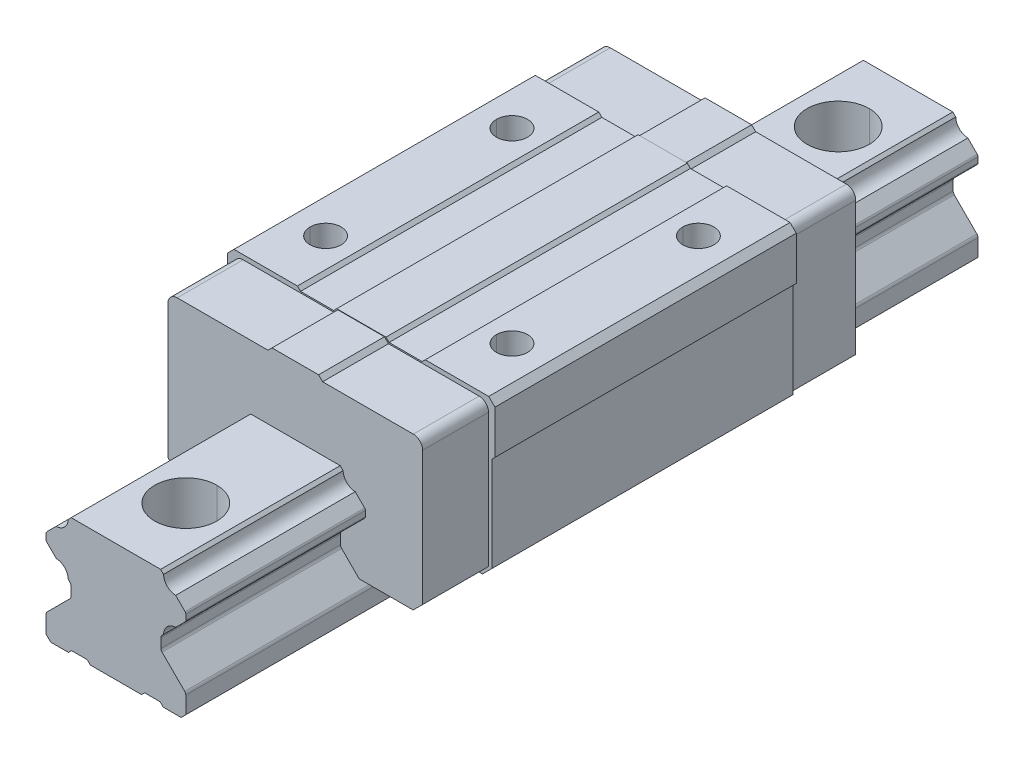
ISO-10303-21;
HEADER;
FILE_DESCRIPTION(('STEP AP214'),'2;1');
FILE_NAME('part.step','',(''),(''),'','','');
FILE_SCHEMA(('AUTOMOTIVE_DESIGN { 1 0 10303 214 1 1 1 1 }'));
ENDSEC;
DATA;
#1=APPLICATION_CONTEXT('core data for automotive mechanical design processes');
#2=APPLICATION_PROTOCOL_DEFINITION('international standard','automotive_design',2000,#1);
#3=PRODUCT_CONTEXT('',#1,'mechanical');
#4=PRODUCT('Part','Part','',(#3));
#5=PRODUCT_RELATED_PRODUCT_CATEGORY('part','',(#4));
#6=PRODUCT_DEFINITION_FORMATION('','',#4);
#7=PRODUCT_DEFINITION_CONTEXT('part definition',#1,'design');
#8=PRODUCT_DEFINITION('design','',#6,#7);
#9=PRODUCT_DEFINITION_SHAPE('','',#8);
#10=(LENGTH_UNIT() NAMED_UNIT(*) SI_UNIT(.MILLI.,.METRE.));
#11=(NAMED_UNIT(*) PLANE_ANGLE_UNIT() SI_UNIT($,.RADIAN.));
#12=(NAMED_UNIT(*) SI_UNIT($,.STERADIAN.) SOLID_ANGLE_UNIT());
#13=UNCERTAINTY_MEASURE_WITH_UNIT(LENGTH_MEASURE(1.E-05),#10,'distance_accuracy_value','');
#14=(GEOMETRIC_REPRESENTATION_CONTEXT(3) GLOBAL_UNCERTAINTY_ASSIGNED_CONTEXT((#13)) GLOBAL_UNIT_ASSIGNED_CONTEXT((#10,
#11,#12)) REPRESENTATION_CONTEXT('',''));
#15=CARTESIAN_POINT('',(0.,0.,0.));
#16=DIRECTION('',(0.,0.,1.));
#17=DIRECTION('',(1.,0.,0.));
#18=AXIS2_PLACEMENT_3D('',#15,#16,#17);
#19=CARTESIAN_POINT('',(-30.,32.,30.));
#20=DIRECTION('',(0.,1.,0.));
#21=DIRECTION('',(-1.,0.,0.));
#22=AXIS2_PLACEMENT_3D('',#19,#20,#21);
#23=CYLINDRICAL_SURFACE('',#22,5.);
#24=CARTESIAN_POINT('',(-30.,5.00000000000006,30.));
#25=DIRECTION('',(0.,1.,0.));
#26=DIRECTION('',(-1.,0.,0.));
#27=AXIS2_PLACEMENT_3D('',#24,#25,#26);
#28=CIRCLE('',#27,5.);
#29=CARTESIAN_POINT('',(-25.,5.,30.));
#30=VERTEX_POINT('',#29);
#31=CARTESIAN_POINT('',(-35.,5.00000000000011,30.));
#32=VERTEX_POINT('',#31);
#33=EDGE_CURVE('P0_E756',#30,#32,#28,.T.);
#34=ORIENTED_EDGE('',*,*,#33,.F.);
#35=DIRECTION('',(0.,1.,0.));
#36=VECTOR('',#35,1.);
#37=CARTESIAN_POINT('',(-25.,32.,30.));
#38=LINE('',#37,#36);
#39=CARTESIAN_POINT('',(-25.,22.,30.));
#40=VERTEX_POINT('',#39);
#41=EDGE_CURVE('P0_E942',#30,#40,#38,.T.);
#42=ORIENTED_EDGE('',*,*,#41,.T.);
#43=CARTESIAN_POINT('',(-30.,22.,30.));
#44=DIRECTION('',(0.,1.,0.));
#45=DIRECTION('',(-1.,0.,0.));
#46=AXIS2_PLACEMENT_3D('',#43,#44,#45);
#47=CIRCLE('',#46,5.);
#48=CARTESIAN_POINT('',(-35.,22.,30.));
#49=VERTEX_POINT('',#48);
#50=EDGE_CURVE('P0_E974',#40,#49,#47,.T.);
#51=ORIENTED_EDGE('',*,*,#50,.T.);
#52=DIRECTION('',(0.,1.,0.));
#53=VECTOR('',#52,1.);
#54=CARTESIAN_POINT('',(-35.,32.,30.));
#55=LINE('',#54,#53);
#56=EDGE_CURVE('P0_E946',#32,#49,#55,.T.);
#57=ORIENTED_EDGE('',*,*,#56,.F.);
#58=EDGE_LOOP('',(#34,#42,#51,#57));
#59=FACE_BOUND('',#58,.T.);
#60=ADVANCED_FACE('P0_F17',(#59),#23,.F.);
#61=CARTESIAN_POINT('',(-30.,32.,-30.));
#62=DIRECTION('',(0.,1.,0.));
#63=DIRECTION('',(-1.,0.,0.));
#64=AXIS2_PLACEMENT_3D('',#61,#62,#63);
#65=CYLINDRICAL_SURFACE('',#64,5.);
#66=CARTESIAN_POINT('',(-30.,5.00000000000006,-30.));
#67=DIRECTION('',(0.,1.,0.));
#68=DIRECTION('',(-1.,0.,0.));
#69=AXIS2_PLACEMENT_3D('',#66,#67,#68);
#70=CIRCLE('',#69,5.);
#71=CARTESIAN_POINT('',(-25.,5.,-30.));
#72=VERTEX_POINT('',#71);
#73=CARTESIAN_POINT('',(-35.,5.00000000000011,-30.));
#74=VERTEX_POINT('',#73);
#75=EDGE_CURVE('P0_E716',#72,#74,#70,.T.);
#76=ORIENTED_EDGE('',*,*,#75,.F.);
#77=DIRECTION('',(0.,1.,0.));
#78=VECTOR('',#77,1.);
#79=CARTESIAN_POINT('',(-25.,32.,-30.));
#80=LINE('',#79,#78);
#81=CARTESIAN_POINT('',(-25.,22.,-30.));
#82=VERTEX_POINT('',#81);
#83=EDGE_CURVE('P0_E757',#72,#82,#80,.T.);
#84=ORIENTED_EDGE('',*,*,#83,.T.);
#85=CARTESIAN_POINT('',(-30.,22.,-30.));
#86=DIRECTION('',(0.,1.,0.));
#87=DIRECTION('',(-1.,0.,0.));
#88=AXIS2_PLACEMENT_3D('',#85,#86,#87);
#89=CIRCLE('',#88,5.);
#90=CARTESIAN_POINT('',(-35.,22.,-30.));
#91=VERTEX_POINT('',#90);
#92=EDGE_CURVE('P0_E1088',#82,#91,#89,.T.);
#93=ORIENTED_EDGE('',*,*,#92,.T.);
#94=DIRECTION('',(0.,1.,0.));
#95=VECTOR('',#94,1.);
#96=CARTESIAN_POINT('',(-35.,32.,-30.));
#97=LINE('',#96,#95);
#98=EDGE_CURVE('P0_E761',#74,#91,#97,.T.);
#99=ORIENTED_EDGE('',*,*,#98,.F.);
#100=EDGE_LOOP('',(#76,#84,#93,#99));
#101=FACE_BOUND('',#100,.T.);
#102=ADVANCED_FACE('P0_F19',(#101),#65,.F.);
#103=CARTESIAN_POINT('',(30.,32.,30.));
#104=DIRECTION('',(0.,1.,0.));
#105=DIRECTION('',(-1.,0.,0.));
#106=AXIS2_PLACEMENT_3D('',#103,#104,#105);
#107=CYLINDRICAL_SURFACE('',#106,5.);
#108=CARTESIAN_POINT('',(30.,4.99999999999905,30.));
#109=DIRECTION('',(0.,1.,0.));
#110=DIRECTION('',(-1.,0.,0.));
#111=AXIS2_PLACEMENT_3D('',#108,#109,#110);
#112=CIRCLE('',#111,5.);
#113=CARTESIAN_POINT('',(35.,4.999999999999,30.));
#114=VERTEX_POINT('',#113);
#115=CARTESIAN_POINT('',(24.9999999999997,4.99999999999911,30.));
#116=VERTEX_POINT('',#115);
#117=EDGE_CURVE('P0_E742',#114,#116,#112,.T.);
#118=ORIENTED_EDGE('',*,*,#117,.F.);
#119=DIRECTION('',(0.,1.,0.));
#120=VECTOR('',#119,1.);
#121=CARTESIAN_POINT('',(35.,32.,30.));
#122=LINE('',#121,#120);
#123=CARTESIAN_POINT('',(35.,22.,30.));
#124=VERTEX_POINT('',#123);
#125=EDGE_CURVE('P0_E793',#114,#124,#122,.T.);
#126=ORIENTED_EDGE('',*,*,#125,.T.);
#127=CARTESIAN_POINT('',(30.,22.,30.));
#128=DIRECTION('',(0.,1.,0.));
#129=DIRECTION('',(-1.,0.,0.));
#130=AXIS2_PLACEMENT_3D('',#127,#128,#129);
#131=CIRCLE('',#130,5.);
#132=CARTESIAN_POINT('',(25.,22.,30.));
#133=VERTEX_POINT('',#132);
#134=EDGE_CURVE('P0_E902',#124,#133,#131,.T.);
#135=ORIENTED_EDGE('',*,*,#134,.T.);
#136=DIRECTION('',(0.,1.,0.));
#137=VECTOR('',#136,1.);
#138=CARTESIAN_POINT('',(25.,32.,30.));
#139=LINE('',#138,#137);
#140=EDGE_CURVE('P0_E802',#116,#133,#139,.T.);
#141=ORIENTED_EDGE('',*,*,#140,.F.);
#142=EDGE_LOOP('',(#118,#126,#135,#141));
#143=FACE_BOUND('',#142,.T.);
#144=ADVANCED_FACE('P0_F3347',(#143),#107,.F.);
#145=CARTESIAN_POINT('',(30.,32.,-30.));
#146=DIRECTION('',(0.,1.,0.));
#147=DIRECTION('',(-1.,0.,0.));
#148=AXIS2_PLACEMENT_3D('',#145,#146,#147);
#149=CYLINDRICAL_SURFACE('',#148,5.);
#150=CARTESIAN_POINT('',(30.,4.99999999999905,-30.));
#151=DIRECTION('',(0.,1.,0.));
#152=DIRECTION('',(-1.,0.,0.));
#153=AXIS2_PLACEMENT_3D('',#150,#151,#152);
#154=CIRCLE('',#153,5.);
#155=CARTESIAN_POINT('',(35.,4.999999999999,-30.));
#156=VERTEX_POINT('',#155);
#157=CARTESIAN_POINT('',(24.9999999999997,4.99999999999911,-30.));
#158=VERTEX_POINT('',#157);
#159=EDGE_CURVE('P0_E684',#156,#158,#154,.T.);
#160=ORIENTED_EDGE('',*,*,#159,.F.);
#161=DIRECTION('',(0.,1.,0.));
#162=VECTOR('',#161,1.);
#163=CARTESIAN_POINT('',(35.,32.,-30.));
#164=LINE('',#163,#162);
#165=CARTESIAN_POINT('',(35.,22.,-30.));
#166=VERTEX_POINT('',#165);
#167=EDGE_CURVE('P0_E693',#156,#166,#164,.T.);
#168=ORIENTED_EDGE('',*,*,#167,.T.);
#169=CARTESIAN_POINT('',(30.,22.,-30.));
#170=DIRECTION('',(0.,1.,0.));
#171=DIRECTION('',(-1.,0.,0.));
#172=AXIS2_PLACEMENT_3D('',#169,#170,#171);
#173=CIRCLE('',#172,5.);
#174=CARTESIAN_POINT('',(25.,22.,-30.));
#175=VERTEX_POINT('',#174);
#176=EDGE_CURVE('P0_E686',#166,#175,#173,.T.);
#177=ORIENTED_EDGE('',*,*,#176,.T.);
#178=DIRECTION('',(0.,1.,0.));
#179=VECTOR('',#178,1.);
#180=CARTESIAN_POINT('',(25.,32.,-30.));
#181=LINE('',#180,#179);
#182=EDGE_CURVE('P0_E680',#158,#175,#181,.T.);
#183=ORIENTED_EDGE('',*,*,#182,.F.);
#184=EDGE_LOOP('',(#160,#168,#177,#183));
#185=FACE_BOUND('',#184,.T.);
#186=ADVANCED_FACE('P0_F682',(#185),#149,.F.);
#187=CARTESIAN_POINT('',(0.,0.,69.7));
#188=DIRECTION('',(0.,0.,1.));
#189=DIRECTION('',(1.,0.,0.));
#190=AXIS2_PLACEMENT_3D('',#187,#188,#189);
#191=PLANE('',#190);
#192=DIRECTION('',(0.707106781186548,-0.707106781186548,0.));
#193=VECTOR('',#192,1.);
#194=CARTESIAN_POINT('',(14.851471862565,-22.851145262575,69.7));
#195=LINE('',#194,#193);
#196=CARTESIAN_POINT('',(14.8514718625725,-22.8511452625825,69.7));
#197=VERTEX_POINT('',#196);
#198=CARTESIAN_POINT('',(20.50032659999,-28.5,69.7));
#199=VERTEX_POINT('',#198);
#200=EDGE_CURVE('P0_E1530',#197,#199,#195,.T.);
#201=ORIENTED_EDGE('',*,*,#200,.T.);
#202=DIRECTION('',(1.,0.,0.));
#203=VECTOR('',#202,1.);
#204=CARTESIAN_POINT('',(0.,-28.5,69.7));
#205=LINE('',#204,#203);
#206=CARTESIAN_POINT('',(37.88728995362,-28.5,69.7));
#207=VERTEX_POINT('',#206);
#208=EDGE_CURVE('P0_E1545',#199,#207,#205,.T.);
#209=ORIENTED_EDGE('',*,*,#208,.T.);
#210=DIRECTION('',(0.707106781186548,0.707106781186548,0.));
#211=VECTOR('',#210,1.);
#212=CARTESIAN_POINT('',(37.88728995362,-28.5,69.7));
#213=LINE('',#212,#211);
#214=CARTESIAN_POINT('',(40.94270697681,-25.44458297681,69.7));
#215=VERTEX_POINT('',#214);
#216=EDGE_CURVE('P0_E1061',#207,#215,#213,.T.);
#217=ORIENTED_EDGE('',*,*,#216,.T.);
#218=DIRECTION('',(0.,1.,0.));
#219=VECTOR('',#218,1.);
#220=CARTESIAN_POINT('',(40.94270697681,0.,69.7));
#221=LINE('',#220,#219);
#222=CARTESIAN_POINT('',(40.94270697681,17.55541702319,69.7));
#223=VERTEX_POINT('',#222);
#224=EDGE_CURVE('P0_E1381',#215,#223,#221,.T.);
#225=ORIENTED_EDGE('',*,*,#224,.T.);
#226=CARTESIAN_POINT('',(37.94270697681,17.55541702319,69.7));
#227=DIRECTION('',(0.,0.,1.));
#228=DIRECTION('',(1.,0.,0.));
#229=AXIS2_PLACEMENT_3D('',#226,#227,#228);
#230=CIRCLE('',#229,3.);
#231=CARTESIAN_POINT('',(37.94270697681,20.55541702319,69.7));
#232=VERTEX_POINT('',#231);
#233=EDGE_CURVE('P0_E1388',#223,#232,#230,.T.);
#234=ORIENTED_EDGE('',*,*,#233,.T.);
#235=DIRECTION('',(-1.,0.,0.));
#236=VECTOR('',#235,1.);
#237=CARTESIAN_POINT('',(0.,20.55541702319,69.7));
#238=LINE('',#237,#236);
#239=CARTESIAN_POINT('',(8.74270697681,20.55541702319,69.7));
#240=VERTEX_POINT('',#239);
#241=EDGE_CURVE('P0_E1395',#232,#240,#238,.T.);
#242=ORIENTED_EDGE('',*,*,#241,.T.);
#243=DIRECTION('',(-0.707106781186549,0.707106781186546,0.));
#244=VECTOR('',#243,1.);
#245=CARTESIAN_POINT('',(8.74270697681,20.55541702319,69.7));
#246=LINE('',#245,#244);
#247=CARTESIAN_POINT('',(7.44270697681,21.85541702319,69.7));
#248=VERTEX_POINT('',#247);
#249=EDGE_CURVE('P0_E1237',#240,#248,#246,.T.);
#250=ORIENTED_EDGE('',*,*,#249,.T.);
#251=DIRECTION('',(-1.,0.,0.));
#252=VECTOR('',#251,1.);
#253=CARTESIAN_POINT('',(0.,21.85541702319,69.7));
#254=LINE('',#253,#252);
#255=CARTESIAN_POINT('',(-7.55729302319,21.85541702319,69.7));
#256=VERTEX_POINT('',#255);
#257=EDGE_CURVE('P0_E1236',#248,#256,#254,.T.);
#258=ORIENTED_EDGE('',*,*,#257,.T.);
#259=DIRECTION('',(-0.707106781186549,-0.707106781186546,0.));
#260=VECTOR('',#259,1.);
#261=CARTESIAN_POINT('',(-7.55729302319,21.85541702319,69.7));
#262=LINE('',#261,#260);
#263=CARTESIAN_POINT('',(-8.85729302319,20.55541702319,69.7));
#264=VERTEX_POINT('',#263);
#265=EDGE_CURVE('P0_E989',#256,#264,#262,.T.);
#266=ORIENTED_EDGE('',*,*,#265,.T.);
#267=DIRECTION('',(-1.,0.,0.));
#268=VECTOR('',#267,1.);
#269=CARTESIAN_POINT('',(0.,20.55541702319,69.7));
#270=LINE('',#269,#268);
#271=CARTESIAN_POINT('',(-38.05729302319,20.55541702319,69.7));
#272=VERTEX_POINT('',#271);
#273=EDGE_CURVE('P0_E1412',#264,#272,#270,.T.);
#274=ORIENTED_EDGE('',*,*,#273,.T.);
#275=CARTESIAN_POINT('',(-38.05729302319,17.55541702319,69.7));
#276=DIRECTION('',(0.,0.,1.));
#277=DIRECTION('',(1.,0.,0.));
#278=AXIS2_PLACEMENT_3D('',#275,#276,#277);
#279=CIRCLE('',#278,3.);
#280=CARTESIAN_POINT('',(-41.05729302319,17.55541702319,69.7));
#281=VERTEX_POINT('',#280);
#282=EDGE_CURVE('P0_E1419',#272,#281,#279,.T.);
#283=ORIENTED_EDGE('',*,*,#282,.T.);
#284=DIRECTION('',(0.,-1.,0.));
#285=VECTOR('',#284,1.);
#286=CARTESIAN_POINT('',(-41.05729302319,0.,69.7));
#287=LINE('',#286,#285);
#288=CARTESIAN_POINT('',(-41.05729302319,-25.44458297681,69.7));
#289=VERTEX_POINT('',#288);
#290=EDGE_CURVE('P0_E1426',#281,#289,#287,.T.);
#291=ORIENTED_EDGE('',*,*,#290,.T.);
#292=DIRECTION('',(0.707106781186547,-0.707106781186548,0.));
#293=VECTOR('',#292,1.);
#294=CARTESIAN_POINT('',(-41.05729302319,-25.44458297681,69.7));
#295=LINE('',#294,#293);
#296=CARTESIAN_POINT('',(-38.001876,-28.5,69.7));
#297=VERTEX_POINT('',#296);
#298=EDGE_CURVE('P0_E1438',#289,#297,#295,.T.);
#299=ORIENTED_EDGE('',*,*,#298,.T.);
#300=DIRECTION('',(1.,0.,0.));
#301=VECTOR('',#300,1.);
#302=CARTESIAN_POINT('',(0.,-28.5,69.7));
#303=LINE('',#302,#301);
#304=CARTESIAN_POINT('',(-20.50032659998,-28.5,69.7));
#305=VERTEX_POINT('',#304);
#306=EDGE_CURVE('P0_E1450',#297,#305,#303,.T.);
#307=ORIENTED_EDGE('',*,*,#306,.T.);
#308=DIRECTION('',(0.707106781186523,0.707106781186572,0.));
#309=VECTOR('',#308,1.);
#310=CARTESIAN_POINT('',(-20.50032659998,-28.5,69.7));
#311=LINE('',#310,#309);
#312=CARTESIAN_POINT('',(-14.8514718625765,-22.8511452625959,69.7));
#313=VERTEX_POINT('',#312);
#314=EDGE_CURVE('P0_E1454',#305,#313,#311,.T.);
#315=ORIENTED_EDGE('',*,*,#314,.T.);
#316=CARTESIAN_POINT('',(-15.7,-22.00261712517,69.7));
#317=DIRECTION('',(0.,0.,-1.));
#318=DIRECTION('',(1.,0.,0.));
#319=AXIS2_PLACEMENT_3D('',#316,#317,#318);
#320=CIRCLE('',#319,1.2);
#321=CARTESIAN_POINT('',(-14.5000000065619,-22.0027945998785,69.7));
#322=VERTEX_POINT('',#321);
#323=EDGE_CURVE('P0_E1058',#322,#313,#320,.T.);
#324=ORIENTED_EDGE('',*,*,#323,.F.);
#325=DIRECTION('',(0.,1.,0.));
#326=VECTOR('',#325,1.);
#327=CARTESIAN_POINT('',(-14.5000000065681,0.,69.7));
#328=LINE('',#327,#326);
#329=CARTESIAN_POINT('',(-14.5000000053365,-18.9973011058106,69.7));
#330=VERTEX_POINT('',#329);
#331=EDGE_CURVE('P0_E1465',#322,#330,#328,.T.);
#332=ORIENTED_EDGE('',*,*,#331,.T.);
#333=CARTESIAN_POINT('',(-15.7,-18.99743427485,69.7));
#334=DIRECTION('',(0.,0.,-1.));
#335=DIRECTION('',(1.,0.,0.));
#336=AXIS2_PLACEMENT_3D('',#333,#334,#335);
#337=CIRCLE('',#336,1.2);
#338=CARTESIAN_POINT('',(-14.8514718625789,-18.1489061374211,69.7));
#339=VERTEX_POINT('',#338);
#340=EDGE_CURVE('P0_E794',#339,#330,#337,.T.);
#341=ORIENTED_EDGE('',*,*,#340,.F.);
#342=DIRECTION('',(0.707106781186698,-0.707106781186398,0.));
#343=VECTOR('',#342,1.);
#344=CARTESIAN_POINT('',(-14.85147186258,-18.14890613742,69.7));
#345=LINE('',#344,#343);
#346=CARTESIAN_POINT('',(-15.333482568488,-17.6668954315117,69.7));
#347=VERTEX_POINT('',#346);
#348=EDGE_CURVE('P0_E1096',#347,#339,#345,.T.);
#349=ORIENTED_EDGE('',*,*,#348,.F.);
#350=CARTESIAN_POINT('',(-19.33229302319,-17.76444002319,69.7));
#351=DIRECTION('',(0.,0.,1.));
#352=DIRECTION('',(1.,0.,0.));
#353=AXIS2_PLACEMENT_3D('',#350,#351,#352);
#354=CIRCLE('',#353,4.);
#355=CARTESIAN_POINT('',(-19.2347484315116,-13.7656295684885,69.7));
#356=VERTEX_POINT('',#355);
#357=EDGE_CURVE('P0_E1284',#347,#356,#354,.T.);
#358=ORIENTED_EDGE('',*,*,#357,.T.);
#359=DIRECTION('',(-0.707106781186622,0.707106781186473,0.));
#360=VECTOR('',#359,1.);
#361=CARTESIAN_POINT('',(-19.2347484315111,-13.765629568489,69.7));
#362=LINE('',#361,#360);
#363=CARTESIAN_POINT('',(-22.265685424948,-10.734692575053,69.7));
#364=VERTEX_POINT('',#363);
#365=EDGE_CURVE('P0_E1267',#356,#364,#362,.T.);
#366=ORIENTED_EDGE('',*,*,#365,.T.);
#367=CARTESIAN_POINT('',(-21.7,-10.1690071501,69.7));
#368=DIRECTION('',(0.,0.,-1.));
#369=DIRECTION('',(1.,0.,0.));
#370=AXIS2_PLACEMENT_3D('',#367,#368,#369);
#371=CIRCLE('',#370,0.8);
#372=CARTESIAN_POINT('',(-22.5,-10.1690071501,69.7));
#373=VERTEX_POINT('',#372);
#374=EDGE_CURVE('P0_E874',#364,#373,#371,.T.);
#375=ORIENTED_EDGE('',*,*,#374,.T.);
#376=DIRECTION('',(0.,1.,0.));
#377=VECTOR('',#376,1.);
#378=CARTESIAN_POINT('',(-22.5,0.,69.7));
#379=LINE('',#378,#377);
#380=CARTESIAN_POINT('',(-22.4999999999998,-8.431021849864,69.7));
#381=VERTEX_POINT('',#380);
#382=EDGE_CURVE('P0_E1479',#373,#381,#379,.T.);
#383=ORIENTED_EDGE('',*,*,#382,.T.);
#384=CARTESIAN_POINT('',(-21.7,-8.431021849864,69.7));
#385=DIRECTION('',(0.,0.,-1.));
#386=DIRECTION('',(1.,0.,0.));
#387=AXIS2_PLACEMENT_3D('',#384,#385,#386);
#388=CIRCLE('',#387,0.8);
#389=CARTESIAN_POINT('',(-22.2656854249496,-7.86533642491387,69.7));
#390=VERTEX_POINT('',#389);
#391=EDGE_CURVE('P0_E1116',#381,#390,#388,.T.);
#392=ORIENTED_EDGE('',*,*,#391,.T.);
#393=DIRECTION('',(0.707106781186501,0.707106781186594,0.));
#394=VECTOR('',#393,1.);
#395=CARTESIAN_POINT('',(-22.2656854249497,-7.8653364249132,69.7));
#396=LINE('',#395,#394);
#397=CARTESIAN_POINT('',(-19.2337171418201,-4.8333681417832,69.7));
#398=VERTEX_POINT('',#397);
#399=EDGE_CURVE('P0_E1485',#390,#398,#396,.T.);
#400=ORIENTED_EDGE('',*,*,#399,.T.);
#401=CARTESIAN_POINT('',(-19.33229302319,-0.8345829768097,69.7));
#402=DIRECTION('',(0.,0.,1.));
#403=DIRECTION('',(1.,0.,0.));
#404=AXIS2_PLACEMENT_3D('',#401,#402,#403);
#405=CIRCLE('',#404,4.);
#406=CARTESIAN_POINT('',(-15.3335078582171,-0.93315885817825,69.7));
#407=VERTEX_POINT('',#406);
#408=EDGE_CURVE('P0_E1171',#398,#407,#405,.T.);
#409=ORIENTED_EDGE('',*,*,#408,.T.);
#410=DIRECTION('',(-0.707106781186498,-0.707106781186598,0.));
#411=VECTOR('',#410,1.);
#412=CARTESIAN_POINT('',(-15.33350785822,-0.9331588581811,69.7));
#413=LINE('',#412,#411);
#414=CARTESIAN_POINT('',(-14.4003490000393,0.,69.7));
#415=VERTEX_POINT('',#414);
#416=EDGE_CURVE('P0_E1562',#415,#407,#413,.T.);
#417=ORIENTED_EDGE('',*,*,#416,.F.);
#418=DIRECTION('',(-1.,0.,0.));
#419=VECTOR('',#418,1.);
#420=CARTESIAN_POINT('',(-14.40034900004,0.,69.7));
#421=LINE('',#420,#419);
#422=CARTESIAN_POINT('',(14.40034900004,0.,69.7));
#423=VERTEX_POINT('',#422);
#424=EDGE_CURVE('P0_E10',#423,#415,#421,.T.);
#425=ORIENTED_EDGE('',*,*,#424,.F.);
#426=DIRECTION('',(0.707106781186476,-0.707106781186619,0.));
#427=VECTOR('',#426,1.);
#428=CARTESIAN_POINT('',(14.4003490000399,0.,69.7));
#429=LINE('',#428,#427);
#430=CARTESIAN_POINT('',(15.3335078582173,-0.933158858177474,69.7));
#431=VERTEX_POINT('',#430);
#432=EDGE_CURVE('P0_E1556',#423,#431,#429,.T.);
#433=ORIENTED_EDGE('',*,*,#432,.T.);
#434=CARTESIAN_POINT('',(19.33229302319,-0.8345829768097,69.7));
#435=DIRECTION('',(0.,0.,1.));
#436=DIRECTION('',(1.,0.,0.));
#437=AXIS2_PLACEMENT_3D('',#434,#435,#436);
#438=CIRCLE('',#437,4.);
#439=CARTESIAN_POINT('',(19.2337171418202,-4.83336814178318,69.7));
#440=VERTEX_POINT('',#439);
#441=EDGE_CURVE('P0_E1357',#431,#440,#438,.T.);
#442=ORIENTED_EDGE('',*,*,#441,.T.);
#443=DIRECTION('',(0.707106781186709,-0.707106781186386,0.));
#444=VECTOR('',#443,1.);
#445=CARTESIAN_POINT('',(19.2337171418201,-4.8333681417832,69.7));
#446=LINE('',#445,#444);
#447=CARTESIAN_POINT('',(22.2656854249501,-7.86533642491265,69.7));
#448=VERTEX_POINT('',#447);
#449=EDGE_CURVE('P0_E1507',#440,#448,#446,.T.);
#450=ORIENTED_EDGE('',*,*,#449,.T.);
#451=CARTESIAN_POINT('',(21.7,-8.431021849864,69.7));
#452=DIRECTION('',(0.,0.,-1.));
#453=DIRECTION('',(1.,2.20309881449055E-12,0.));
#454=AXIS2_PLACEMENT_3D('',#451,#452,#453);
#455=CIRCLE('',#454,0.8);
#456=CARTESIAN_POINT('',(22.5,-8.43102184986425,69.7));
#457=VERTEX_POINT('',#456);
#458=EDGE_CURVE('P0_E891',#448,#457,#455,.T.);
#459=ORIENTED_EDGE('',*,*,#458,.T.);
#460=DIRECTION('',(0.,-1.,0.));
#461=VECTOR('',#460,1.);
#462=CARTESIAN_POINT('',(22.5,0.,69.7));
#463=LINE('',#462,#461);
#464=CARTESIAN_POINT('',(22.5000000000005,-10.1690071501,69.7));
#465=VERTEX_POINT('',#464);
#466=EDGE_CURVE('P0_E1455',#457,#465,#463,.T.);
#467=ORIENTED_EDGE('',*,*,#466,.T.);
#468=CARTESIAN_POINT('',(21.7,-10.1690071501,69.7));
#469=DIRECTION('',(0.,0.,-1.));
#470=DIRECTION('',(1.,0.,0.));
#471=AXIS2_PLACEMENT_3D('',#468,#469,#470);
#472=CIRCLE('',#471,0.8);
#473=CARTESIAN_POINT('',(22.2656854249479,-10.7346925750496,69.7));
#474=VERTEX_POINT('',#473);
#475=EDGE_CURVE('P0_E1228',#465,#474,#472,.T.);
#476=ORIENTED_EDGE('',*,*,#475,.T.);
#477=DIRECTION('',(-0.707106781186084,-0.707106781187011,0.));
#478=VECTOR('',#477,1.);
#479=CARTESIAN_POINT('',(22.2656854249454,-10.7346925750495,69.7));
#480=LINE('',#479,#478);
#481=CARTESIAN_POINT('',(19.234748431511,-13.765629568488,69.7));
#482=VERTEX_POINT('',#481);
#483=EDGE_CURVE('P0_E1514',#474,#482,#480,.T.);
#484=ORIENTED_EDGE('',*,*,#483,.T.);
#485=CARTESIAN_POINT('',(19.33229302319,-17.76444002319,69.7));
#486=DIRECTION('',(0.,0.,1.));
#487=DIRECTION('',(1.,0.,0.));
#488=AXIS2_PLACEMENT_3D('',#485,#486,#487);
#489=CIRCLE('',#488,4.);
#490=CARTESIAN_POINT('',(15.333482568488,-17.6668954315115,69.7));
#491=VERTEX_POINT('',#490);
#492=EDGE_CURVE('P0_E790',#482,#491,#489,.T.);
#493=ORIENTED_EDGE('',*,*,#492,.T.);
#494=DIRECTION('',(0.707106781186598,0.707106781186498,0.));
#495=VECTOR('',#494,1.);
#496=CARTESIAN_POINT('',(15.33348256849,-17.66689543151,69.7));
#497=LINE('',#496,#495);
#498=CARTESIAN_POINT('',(14.8514718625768,-18.1489061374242,69.7));
#499=VERTEX_POINT('',#498);
#500=EDGE_CURVE('P0_E1241',#499,#491,#497,.T.);
#501=ORIENTED_EDGE('',*,*,#500,.F.);
#502=CARTESIAN_POINT('',(15.7,-18.99743427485,69.7));
#503=DIRECTION('',(0.,0.,-1.));
#504=DIRECTION('',(1.,0.,0.));
#505=AXIS2_PLACEMENT_3D('',#502,#503,#504);
#506=CIRCLE('',#505,1.2);
#507=CARTESIAN_POINT('',(14.500000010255,-18.9972124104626,69.7));
#508=VERTEX_POINT('',#507);
#509=EDGE_CURVE('P0_E924',#508,#499,#506,.T.);
#510=ORIENTED_EDGE('',*,*,#509,.F.);
#511=DIRECTION('',(0.,-1.,0.));
#512=VECTOR('',#511,1.);
#513=CARTESIAN_POINT('',(14.5000000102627,0.,69.7));
#514=LINE('',#513,#512);
#515=CARTESIAN_POINT('',(14.5000000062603,-22.0027502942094,69.7));
#516=VERTEX_POINT('',#515);
#517=EDGE_CURVE('P0_E789',#508,#516,#514,.T.);
#518=ORIENTED_EDGE('',*,*,#517,.T.);
#519=CARTESIAN_POINT('',(15.7,-22.00261712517,69.7));
#520=DIRECTION('',(0.,0.,-1.));
#521=DIRECTION('',(1.,0.,0.));
#522=AXIS2_PLACEMENT_3D('',#519,#520,#521);
#523=CIRCLE('',#522,1.2);
#524=EDGE_CURVE('P0_E1262',#197,#516,#523,.T.);
#525=ORIENTED_EDGE('',*,*,#524,.F.);
#526=EDGE_LOOP('',(#201,#209,#217,#225,#234,#242,#250,#258,#266,#274,#283,#291,#299,#307,#315,
#324,#332,#341,#349,#358,#366,#375,#383,#392,#400,#409,#417,#425,#433,#442,#450,#459,#467,#476,
#484,#493,#501,#510,#518,#525));
#527=FACE_BOUND('',#526,.T.);
#528=ADVANCED_FACE('P0_F1580',(#527),#191,.T.);
#529=CARTESIAN_POINT('',(-14.40034900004,0.,-48.5));
#530=DIRECTION('',(0.,-1.,0.));
#531=DIRECTION('',(0.,0.,-1.));
#532=AXIS2_PLACEMENT_3D('',#529,#530,#531);
#533=PLANE('',#532);
#534=ORIENTED_EDGE('',*,*,#424,.T.);
#535=DIRECTION('',(0.,0.,-1.));
#536=VECTOR('',#535,1.);
#537=CARTESIAN_POINT('',(-14.4003490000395,0.,-48.5));
#538=LINE('',#537,#536);
#539=CARTESIAN_POINT('',(-14.4003490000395,-1.07263734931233E-13,-69.7));
#540=VERTEX_POINT('',#539);
#541=EDGE_CURVE('P0_E26',#415,#540,#538,.T.);
#542=ORIENTED_EDGE('',*,*,#541,.T.);
#543=DIRECTION('',(1.,0.,0.));
#544=VECTOR('',#543,1.);
#545=CARTESIAN_POINT('',(-14.40034900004,0.,-69.7));
#546=LINE('',#545,#544);
#547=CARTESIAN_POINT('',(14.40034900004,0.,-69.7));
#548=VERTEX_POINT('',#547);
#549=EDGE_CURVE('P0_E1431',#540,#548,#546,.T.);
#550=ORIENTED_EDGE('',*,*,#549,.T.);
#551=DIRECTION('',(0.,0.,1.));
#552=VECTOR('',#551,1.);
#553=CARTESIAN_POINT('',(14.40034900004,0.,-48.5));
#554=LINE('',#553,#552);
#555=EDGE_CURVE('P0_E1559',#548,#423,#554,.T.);
#556=ORIENTED_EDGE('',*,*,#555,.T.);
#557=EDGE_LOOP('',(#534,#542,#550,#556));
#558=FACE_BOUND('',#557,.T.);
#559=ADVANCED_FACE('P0_F1566',(#558),#533,.T.);
#560=CARTESIAN_POINT('',(-15.33350785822,-0.9331588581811,-48.5));
#561=DIRECTION('',(0.707106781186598,-0.707106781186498,0.));
#562=DIRECTION('',(0.,0.,-1.));
#563=AXIS2_PLACEMENT_3D('',#560,#561,#562);
#564=PLANE('',#563);
#565=ORIENTED_EDGE('',*,*,#416,.T.);
#566=DIRECTION('',(0.,0.,-1.));
#567=VECTOR('',#566,1.);
#568=CARTESIAN_POINT('',(-15.3335078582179,-0.93315885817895,-48.5));
#569=LINE('',#568,#567);
#570=CARTESIAN_POINT('',(-15.3335078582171,-0.93315885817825,-69.7));
#571=VERTEX_POINT('',#570);
#572=EDGE_CURVE('P0_E1170',#407,#571,#569,.T.);
#573=ORIENTED_EDGE('',*,*,#572,.T.);
#574=DIRECTION('',(0.707106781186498,0.707106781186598,0.));
#575=VECTOR('',#574,1.);
#576=CARTESIAN_POINT('',(-15.33350785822,-0.9331588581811,-69.7));
#577=LINE('',#576,#575);
#578=EDGE_CURVE('P0_E1435',#571,#540,#577,.T.);
#579=ORIENTED_EDGE('',*,*,#578,.T.);
#580=ORIENTED_EDGE('',*,*,#541,.F.);
#581=EDGE_LOOP('',(#565,#573,#579,#580));
#582=FACE_BOUND('',#581,.T.);
#583=ADVANCED_FACE('P0_F1570',(#582),#564,.T.);
#584=CARTESIAN_POINT('',(14.40034900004,-1.137E-13,-48.5));
#585=DIRECTION('',(-0.707106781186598,-0.707106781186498,0.));
#586=DIRECTION('',(-0.707106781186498,0.707106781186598,0.));
#587=AXIS2_PLACEMENT_3D('',#584,#585,#586);
#588=PLANE('',#587);
#589=ORIENTED_EDGE('',*,*,#432,.F.);
#590=ORIENTED_EDGE('',*,*,#555,.F.);
#591=DIRECTION('',(0.707106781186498,-0.707106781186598,0.));
#592=VECTOR('',#591,1.);
#593=CARTESIAN_POINT('',(14.40034900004,-1.137E-13,-69.7));
#594=LINE('',#593,#592);
#595=CARTESIAN_POINT('',(15.3335078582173,-0.933158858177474,-69.7));
#596=VERTEX_POINT('',#595);
#597=EDGE_CURVE('P0_E1327',#548,#596,#594,.T.);
#598=ORIENTED_EDGE('',*,*,#597,.T.);
#599=DIRECTION('',(0.,0.,1.));
#600=VECTOR('',#599,1.);
#601=CARTESIAN_POINT('',(15.3335078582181,-0.933158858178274,-48.5));
#602=LINE('',#601,#600);
#603=EDGE_CURVE('P0_E1495',#596,#431,#602,.T.);
#604=ORIENTED_EDGE('',*,*,#603,.T.);
#605=EDGE_LOOP('',(#589,#590,#598,#604));
#606=FACE_BOUND('',#605,.T.);
#607=ADVANCED_FACE('P0_F1578',(#606),#588,.T.);
#608=CARTESIAN_POINT('',(0.,0.,-69.7));
#609=DIRECTION('',(0.,0.,1.));
#610=DIRECTION('',(1.,0.,0.));
#611=AXIS2_PLACEMENT_3D('',#608,#609,#610);
#612=PLANE('',#611);
#613=DIRECTION('',(0.707106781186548,-0.707106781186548,0.));
#614=VECTOR('',#613,1.);
#615=CARTESIAN_POINT('',(14.851471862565,-22.851145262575,-69.7));
#616=LINE('',#615,#614);
#617=CARTESIAN_POINT('',(14.8514718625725,-22.8511452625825,-69.7));
#618=VERTEX_POINT('',#617);
#619=CARTESIAN_POINT('',(20.50032659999,-28.5,-69.7));
#620=VERTEX_POINT('',#619);
#621=EDGE_CURVE('P0_E1534',#618,#620,#616,.T.);
#622=ORIENTED_EDGE('',*,*,#621,.F.);
#623=CARTESIAN_POINT('',(15.7,-22.00261712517,-69.7));
#624=DIRECTION('',(0.,0.,1.));
#625=DIRECTION('',(1.,0.,0.));
#626=AXIS2_PLACEMENT_3D('',#623,#624,#625);
#627=CIRCLE('',#626,1.2);
#628=CARTESIAN_POINT('',(14.5000000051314,-22.00261712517,-69.7));
#629=VERTEX_POINT('',#628);
#630=EDGE_CURVE('P0_E1276',#629,#618,#627,.T.);
#631=ORIENTED_EDGE('',*,*,#630,.F.);
#632=DIRECTION('',(0.,-1.,0.));
#633=VECTOR('',#632,1.);
#634=CARTESIAN_POINT('',(14.5000000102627,0.,-69.7));
#635=LINE('',#634,#633);
#636=CARTESIAN_POINT('',(14.500000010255,-18.9972124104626,-69.7));
#637=VERTEX_POINT('',#636);
#638=EDGE_CURVE('P0_E1527',#637,#629,#635,.T.);
#639=ORIENTED_EDGE('',*,*,#638,.F.);
#640=CARTESIAN_POINT('',(15.7,-18.99743427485,-69.7));
#641=DIRECTION('',(0.,0.,1.));
#642=DIRECTION('',(1.,0.,0.));
#643=AXIS2_PLACEMENT_3D('',#640,#641,#642);
#644=CIRCLE('',#643,1.2);
#645=CARTESIAN_POINT('',(14.8514718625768,-18.1489061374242,-69.7));
#646=VERTEX_POINT('',#645);
#647=EDGE_CURVE('P0_E1254',#646,#637,#644,.T.);
#648=ORIENTED_EDGE('',*,*,#647,.F.);
#649=DIRECTION('',(-0.707106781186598,-0.707106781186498,0.));
#650=VECTOR('',#649,1.);
#651=CARTESIAN_POINT('',(15.33348256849,-17.66689543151,-69.7));
#652=LINE('',#651,#650);
#653=CARTESIAN_POINT('',(15.333482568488,-17.6668954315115,-69.7));
#654=VERTEX_POINT('',#653);
#655=EDGE_CURVE('P0_E925',#654,#646,#652,.T.);
#656=ORIENTED_EDGE('',*,*,#655,.F.);
#657=CARTESIAN_POINT('',(19.33229302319,-17.76444002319,-69.7));
#658=DIRECTION('',(0.,0.,1.));
#659=DIRECTION('',(1.,0.,0.));
#660=AXIS2_PLACEMENT_3D('',#657,#658,#659);
#661=CIRCLE('',#660,4.);
#662=CARTESIAN_POINT('',(19.234748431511,-13.765629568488,-69.7));
#663=VERTEX_POINT('',#662);
#664=EDGE_CURVE('P0_E786',#663,#654,#661,.T.);
#665=ORIENTED_EDGE('',*,*,#664,.F.);
#666=DIRECTION('',(-0.707106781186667,-0.707106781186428,0.));
#667=VECTOR('',#666,1.);
#668=CARTESIAN_POINT('',(22.2656854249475,-10.7346925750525,-69.7));
#669=LINE('',#668,#667);
#670=CARTESIAN_POINT('',(22.2656854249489,-10.7346925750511,-69.7));
#671=VERTEX_POINT('',#670);
#672=EDGE_CURVE('P0_E1518',#671,#663,#669,.T.);
#673=ORIENTED_EDGE('',*,*,#672,.F.);
#674=CARTESIAN_POINT('',(21.7,-10.1690071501,-69.7));
#675=DIRECTION('',(0.,0.,1.));
#676=DIRECTION('',(1.,0.,0.));
#677=AXIS2_PLACEMENT_3D('',#674,#675,#676);
#678=CIRCLE('',#677,0.8);
#679=CARTESIAN_POINT('',(22.5000000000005,-10.1690071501,-69.7));
#680=VERTEX_POINT('',#679);
#681=EDGE_CURVE('P0_E1220',#671,#680,#678,.T.);
#682=ORIENTED_EDGE('',*,*,#681,.T.);
#683=DIRECTION('',(0.,-1.,0.));
#684=VECTOR('',#683,1.);
#685=CARTESIAN_POINT('',(22.5,0.,-69.7));
#686=LINE('',#685,#684);
#687=CARTESIAN_POINT('',(22.5,-8.43102184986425,-69.7));
#688=VERTEX_POINT('',#687);
#689=EDGE_CURVE('P0_E1458',#688,#680,#686,.T.);
#690=ORIENTED_EDGE('',*,*,#689,.F.);
#691=CARTESIAN_POINT('',(21.7,-8.431021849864,-69.7));
#692=DIRECTION('',(0.,0.,1.));
#693=DIRECTION('',(1.,0.,0.));
#694=AXIS2_PLACEMENT_3D('',#691,#692,#693);
#695=CIRCLE('',#694,0.8);
#696=CARTESIAN_POINT('',(22.2656854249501,-7.86533642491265,-69.7));
#697=VERTEX_POINT('',#696);
#698=EDGE_CURVE('P0_E892',#688,#697,#695,.T.);
#699=ORIENTED_EDGE('',*,*,#698,.T.);
#700=DIRECTION('',(0.707106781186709,-0.707106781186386,0.));
#701=VECTOR('',#700,1.);
#702=CARTESIAN_POINT('',(19.2337171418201,-4.8333681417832,-69.7));
#703=LINE('',#702,#701);
#704=CARTESIAN_POINT('',(19.2337171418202,-4.83336814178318,-69.7));
#705=VERTEX_POINT('',#704);
#706=EDGE_CURVE('P0_E1459',#705,#697,#703,.T.);
#707=ORIENTED_EDGE('',*,*,#706,.F.);
#708=CARTESIAN_POINT('',(19.33229302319,-0.8345829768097,-69.7));
#709=DIRECTION('',(0.,0.,1.));
#710=DIRECTION('',(1.,0.,0.));
#711=AXIS2_PLACEMENT_3D('',#708,#709,#710);
#712=CIRCLE('',#711,4.);
#713=EDGE_CURVE('P0_E1499',#596,#705,#712,.T.);
#714=ORIENTED_EDGE('',*,*,#713,.F.);
#715=ORIENTED_EDGE('',*,*,#597,.F.);
#716=ORIENTED_EDGE('',*,*,#549,.F.);
#717=ORIENTED_EDGE('',*,*,#578,.F.);
#718=CARTESIAN_POINT('',(-19.33229302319,-0.8345829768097,-69.7));
#719=DIRECTION('',(0.,0.,1.));
#720=DIRECTION('',(1.,0.,0.));
#721=AXIS2_PLACEMENT_3D('',#718,#719,#720);
#722=CIRCLE('',#721,4.);
#723=CARTESIAN_POINT('',(-19.2337171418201,-4.8333681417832,-69.7));
#724=VERTEX_POINT('',#723);
#725=EDGE_CURVE('P0_E1166',#724,#571,#722,.T.);
#726=ORIENTED_EDGE('',*,*,#725,.F.);
#727=DIRECTION('',(0.707106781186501,0.707106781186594,0.));
#728=VECTOR('',#727,1.);
#729=CARTESIAN_POINT('',(-22.2656854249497,-7.8653364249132,-69.7));
#730=LINE('',#729,#728);
#731=CARTESIAN_POINT('',(-22.2656854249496,-7.86533642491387,-69.7));
#732=VERTEX_POINT('',#731);
#733=EDGE_CURVE('P0_E1358',#732,#724,#730,.T.);
#734=ORIENTED_EDGE('',*,*,#733,.F.);
#735=CARTESIAN_POINT('',(-21.7,-8.431021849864,-69.7));
#736=DIRECTION('',(0.,0.,1.));
#737=DIRECTION('',(1.,0.,0.));
#738=AXIS2_PLACEMENT_3D('',#735,#736,#737);
#739=CIRCLE('',#738,0.8);
#740=CARTESIAN_POINT('',(-22.4999999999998,-8.431021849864,-69.7));
#741=VERTEX_POINT('',#740);
#742=EDGE_CURVE('P0_E873',#732,#741,#739,.T.);
#743=ORIENTED_EDGE('',*,*,#742,.T.);
#744=DIRECTION('',(0.,1.,0.));
#745=VECTOR('',#744,1.);
#746=CARTESIAN_POINT('',(-22.5,0.,-69.7));
#747=LINE('',#746,#745);
#748=CARTESIAN_POINT('',(-22.5,-10.1690071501,-69.7));
#749=VERTEX_POINT('',#748);
#750=EDGE_CURVE('P0_E1482',#749,#741,#747,.T.);
#751=ORIENTED_EDGE('',*,*,#750,.F.);
#752=CARTESIAN_POINT('',(-21.7,-10.1690071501,-69.7));
#753=DIRECTION('',(0.,0.,1.));
#754=DIRECTION('',(1.,0.,0.));
#755=AXIS2_PLACEMENT_3D('',#752,#753,#754);
#756=CIRCLE('',#755,0.8);
#757=CARTESIAN_POINT('',(-22.265685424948,-10.734692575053,-69.7));
#758=VERTEX_POINT('',#757);
#759=EDGE_CURVE('P0_E1193',#749,#758,#756,.T.);
#760=ORIENTED_EDGE('',*,*,#759,.T.);
#761=DIRECTION('',(-0.707106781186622,0.707106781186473,0.));
#762=VECTOR('',#761,1.);
#763=CARTESIAN_POINT('',(-19.2347484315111,-13.765629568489,-69.7));
#764=LINE('',#763,#762);
#765=CARTESIAN_POINT('',(-19.2347484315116,-13.7656295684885,-69.7));
#766=VERTEX_POINT('',#765);
#767=EDGE_CURVE('P0_E1476',#766,#758,#764,.T.);
#768=ORIENTED_EDGE('',*,*,#767,.F.);
#769=CARTESIAN_POINT('',(-19.33229302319,-17.76444002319,-69.7));
#770=DIRECTION('',(0.,0.,1.));
#771=DIRECTION('',(1.,0.,0.));
#772=AXIS2_PLACEMENT_3D('',#769,#770,#771);
#773=CIRCLE('',#772,4.);
#774=CARTESIAN_POINT('',(-15.333482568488,-17.6668954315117,-69.7));
#775=VERTEX_POINT('',#774);
#776=EDGE_CURVE('P0_E1268',#775,#766,#773,.T.);
#777=ORIENTED_EDGE('',*,*,#776,.F.);
#778=DIRECTION('',(-0.707106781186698,0.707106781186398,0.));
#779=VECTOR('',#778,1.);
#780=CARTESIAN_POINT('',(-14.85147186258,-18.14890613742,-69.7));
#781=LINE('',#780,#779);
#782=CARTESIAN_POINT('',(-14.8514718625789,-18.1489061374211,-69.7));
#783=VERTEX_POINT('',#782);
#784=EDGE_CURVE('P0_E1181',#783,#775,#781,.T.);
#785=ORIENTED_EDGE('',*,*,#784,.F.);
#786=CARTESIAN_POINT('',(-15.7,-18.99743427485,-69.7));
#787=DIRECTION('',(0.,0.,1.));
#788=DIRECTION('',(1.,0.,0.));
#789=AXIS2_PLACEMENT_3D('',#786,#787,#788);
#790=CIRCLE('',#789,1.2);
#791=CARTESIAN_POINT('',(-14.5000000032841,-18.99743427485,-69.7));
#792=VERTEX_POINT('',#791);
#793=EDGE_CURVE('P0_E728',#792,#783,#790,.T.);
#794=ORIENTED_EDGE('',*,*,#793,.F.);
#795=DIRECTION('',(0.,1.,0.));
#796=VECTOR('',#795,1.);
#797=CARTESIAN_POINT('',(-14.5000000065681,0.,-69.7));
#798=LINE('',#797,#796);
#799=CARTESIAN_POINT('',(-14.5000000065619,-22.0027945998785,-69.7));
#800=VERTEX_POINT('',#799);
#801=EDGE_CURVE('P0_E1468',#800,#792,#798,.T.);
#802=ORIENTED_EDGE('',*,*,#801,.F.);
#803=CARTESIAN_POINT('',(-15.7,-22.00261712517,-69.7));
#804=DIRECTION('',(0.,0.,1.));
#805=DIRECTION('',(1.,0.,0.));
#806=AXIS2_PLACEMENT_3D('',#803,#804,#805);
#807=CIRCLE('',#806,1.2);
#808=CARTESIAN_POINT('',(-14.8514718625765,-22.8511452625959,-69.7));
#809=VERTEX_POINT('',#808);
#810=EDGE_CURVE('P0_E747',#809,#800,#807,.T.);
#811=ORIENTED_EDGE('',*,*,#810,.F.);
#812=DIRECTION('',(0.707106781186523,0.707106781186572,0.));
#813=VECTOR('',#812,1.);
#814=CARTESIAN_POINT('',(-20.50032659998,-28.5,-69.7));
#815=LINE('',#814,#813);
#816=CARTESIAN_POINT('',(-20.50032659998,-28.5,-69.7));
#817=VERTEX_POINT('',#816);
#818=EDGE_CURVE('P0_E1462',#817,#809,#815,.T.);
#819=ORIENTED_EDGE('',*,*,#818,.F.);
#820=DIRECTION('',(1.,0.,0.));
#821=VECTOR('',#820,1.);
#822=CARTESIAN_POINT('',(0.,-28.5,-69.7));
#823=LINE('',#822,#821);
#824=CARTESIAN_POINT('',(-38.001876,-28.5,-69.7));
#825=VERTEX_POINT('',#824);
#826=EDGE_CURVE('P0_E1442',#825,#817,#823,.T.);
#827=ORIENTED_EDGE('',*,*,#826,.F.);
#828=DIRECTION('',(0.707106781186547,-0.707106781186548,0.));
#829=VECTOR('',#828,1.);
#830=CARTESIAN_POINT('',(-41.05729302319,-25.44458297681,-69.7));
#831=LINE('',#830,#829);
#832=CARTESIAN_POINT('',(-41.05729302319,-25.44458297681,-69.7));
#833=VERTEX_POINT('',#832);
#834=EDGE_CURVE('P0_E1369',#833,#825,#831,.T.);
#835=ORIENTED_EDGE('',*,*,#834,.F.);
#836=DIRECTION('',(0.,-1.,0.));
#837=VECTOR('',#836,1.);
#838=CARTESIAN_POINT('',(-41.05729302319,0.,-69.7));
#839=LINE('',#838,#837);
#840=CARTESIAN_POINT('',(-41.05729302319,17.55541702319,-69.7));
#841=VERTEX_POINT('',#840);
#842=EDGE_CURVE('P0_E1361',#841,#833,#839,.T.);
#843=ORIENTED_EDGE('',*,*,#842,.F.);
#844=CARTESIAN_POINT('',(-38.05729302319,17.55541702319,-69.7));
#845=DIRECTION('',(0.,0.,1.));
#846=DIRECTION('',(1.,0.,0.));
#847=AXIS2_PLACEMENT_3D('',#844,#845,#846);
#848=CIRCLE('',#847,3.);
#849=CARTESIAN_POINT('',(-38.05729302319,20.55541702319,-69.7));
#850=VERTEX_POINT('',#849);
#851=EDGE_CURVE('P0_E1080',#850,#841,#848,.T.);
#852=ORIENTED_EDGE('',*,*,#851,.F.);
#853=DIRECTION('',(-1.,0.,0.));
#854=VECTOR('',#853,1.);
#855=CARTESIAN_POINT('',(0.,20.55541702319,-69.7));
#856=LINE('',#855,#854);
#857=CARTESIAN_POINT('',(-8.85729302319,20.55541702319,-69.7));
#858=VERTEX_POINT('',#857);
#859=EDGE_CURVE('P0_E1076',#858,#850,#856,.T.);
#860=ORIENTED_EDGE('',*,*,#859,.F.);
#861=DIRECTION('',(-0.707106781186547,-0.707106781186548,0.));
#862=VECTOR('',#861,1.);
#863=CARTESIAN_POINT('',(-7.55729302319,21.85541702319,-69.7));
#864=LINE('',#863,#862);
#865=CARTESIAN_POINT('',(-7.55729302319,21.85541702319,-69.7));
#866=VERTEX_POINT('',#865);
#867=EDGE_CURVE('P0_E774',#866,#858,#864,.T.);
#868=ORIENTED_EDGE('',*,*,#867,.F.);
#869=DIRECTION('',(-1.,0.,0.));
#870=VECTOR('',#869,1.);
#871=CARTESIAN_POINT('',(0.,21.85541702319,-69.7));
#872=LINE('',#871,#870);
#873=CARTESIAN_POINT('',(7.44270697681,21.85541702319,-69.7));
#874=VERTEX_POINT('',#873);
#875=EDGE_CURVE('P0_E1337',#874,#866,#872,.T.);
#876=ORIENTED_EDGE('',*,*,#875,.F.);
#877=DIRECTION('',(-0.707106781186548,0.707106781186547,0.));
#878=VECTOR('',#877,1.);
#879=CARTESIAN_POINT('',(8.74270697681,20.55541702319,-69.7));
#880=LINE('',#879,#878);
#881=CARTESIAN_POINT('',(8.74270697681,20.55541702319,-69.7));
#882=VERTEX_POINT('',#881);
#883=EDGE_CURVE('P0_E1330',#882,#874,#880,.T.);
#884=ORIENTED_EDGE('',*,*,#883,.F.);
#885=DIRECTION('',(-1.,0.,0.));
#886=VECTOR('',#885,1.);
#887=CARTESIAN_POINT('',(0.,20.55541702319,-69.7));
#888=LINE('',#887,#886);
#889=CARTESIAN_POINT('',(37.94270697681,20.55541702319,-69.7));
#890=VERTEX_POINT('',#889);
#891=EDGE_CURVE('P0_E1319',#890,#882,#888,.T.);
#892=ORIENTED_EDGE('',*,*,#891,.F.);
#893=CARTESIAN_POINT('',(37.94270697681,17.55541702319,-69.7));
#894=DIRECTION('',(0.,0.,1.));
#895=DIRECTION('',(1.,0.,0.));
#896=AXIS2_PLACEMENT_3D('',#893,#894,#895);
#897=CIRCLE('',#896,3.);
#898=CARTESIAN_POINT('',(40.94270697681,17.55541702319,-69.7));
#899=VERTEX_POINT('',#898);
#900=EDGE_CURVE('P0_E1309',#899,#890,#897,.T.);
#901=ORIENTED_EDGE('',*,*,#900,.F.);
#902=DIRECTION('',(0.,1.,0.));
#903=VECTOR('',#902,1.);
#904=CARTESIAN_POINT('',(40.94270697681,0.,-69.7));
#905=LINE('',#904,#903);
#906=CARTESIAN_POINT('',(40.94270697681,-25.44458297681,-69.7));
#907=VERTEX_POINT('',#906);
#908=EDGE_CURVE('P0_E1305',#907,#899,#905,.T.);
#909=ORIENTED_EDGE('',*,*,#908,.F.);
#910=DIRECTION('',(0.707106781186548,0.707106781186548,0.));
#911=VECTOR('',#910,1.);
#912=CARTESIAN_POINT('',(37.88728995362,-28.5,-69.7));
#913=LINE('',#912,#911);
#914=CARTESIAN_POINT('',(37.88728995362,-28.5,-69.7));
#915=VERTEX_POINT('',#914);
#916=EDGE_CURVE('P0_E1297',#915,#907,#913,.T.);
#917=ORIENTED_EDGE('',*,*,#916,.F.);
#918=DIRECTION('',(1.,0.,0.));
#919=VECTOR('',#918,1.);
#920=CARTESIAN_POINT('',(0.,-28.5,-69.7));
#921=LINE('',#920,#919);
#922=EDGE_CURVE('P0_E1542',#620,#915,#921,.T.);
#923=ORIENTED_EDGE('',*,*,#922,.F.);
#924=EDGE_LOOP('',(#622,#631,#639,#648,#656,#665,#673,#682,#690,#699,#707,#714,#715,#716,#717,
#726,#734,#743,#751,#760,#768,#777,#785,#794,#802,#811,#819,#827,#835,#843,#852,#860,#868,#876,
#884,#892,#901,#909,#917,#923));
#925=FACE_BOUND('',#924,.T.);
#926=ADVANCED_FACE('P0_F1573',(#925),#612,.F.);
#927=CARTESIAN_POINT('',(-19.33229302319,-0.8345829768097,-48.5));
#928=DIRECTION('',(0.,0.,1.));
#929=DIRECTION('',(1.,0.,0.));
#930=AXIS2_PLACEMENT_3D('',#927,#928,#929);
#931=CYLINDRICAL_SURFACE('',#930,4.);
#932=ORIENTED_EDGE('',*,*,#408,.F.);
#933=DIRECTION('',(0.,0.,-1.));
#934=VECTOR('',#933,1.);
#935=CARTESIAN_POINT('',(-19.2337171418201,-4.8333681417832,-48.5));
#936=LINE('',#935,#934);
#937=EDGE_CURVE('P0_E1353',#398,#724,#936,.T.);
#938=ORIENTED_EDGE('',*,*,#937,.T.);
#939=ORIENTED_EDGE('',*,*,#725,.T.);
#940=ORIENTED_EDGE('',*,*,#572,.F.);
#941=EDGE_LOOP('',(#932,#938,#939,#940));
#942=FACE_BOUND('',#941,.T.);
#943=ADVANCED_FACE('P0_F1721',(#942),#931,.T.);
#944=CARTESIAN_POINT('',(20.50032659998,-28.5,-48.5));
#945=DIRECTION('',(0.,-1.,0.));
#946=DIRECTION('',(0.,0.,-1.));
#947=AXIS2_PLACEMENT_3D('',#944,#945,#946);
#948=PLANE('',#947);
#949=DIRECTION('',(0.,0.,-1.));
#950=VECTOR('',#949,1.);
#951=CARTESIAN_POINT('',(20.50032659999,-28.5,-48.5));
#952=LINE('',#951,#950);
#953=EDGE_CURVE('P0_E1538',#199,#620,#952,.T.);
#954=ORIENTED_EDGE('',*,*,#953,.T.);
#955=ORIENTED_EDGE('',*,*,#922,.T.);
#956=DIRECTION('',(0.,0.,1.));
#957=VECTOR('',#956,1.);
#958=CARTESIAN_POINT('',(37.88728995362,-28.5,-48.5));
#959=LINE('',#958,#957);
#960=CARTESIAN_POINT('',(37.88728995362,-28.5,-48.5));
#961=VERTEX_POINT('',#960);
#962=EDGE_CURVE('P0_E1294',#915,#961,#959,.T.);
#963=ORIENTED_EDGE('',*,*,#962,.T.);
#964=DIRECTION('',(1.,0.,0.));
#965=VECTOR('',#964,1.);
#966=CARTESIAN_POINT('',(0.,-28.5,-48.5));
#967=LINE('',#966,#965);
#968=CARTESIAN_POINT('',(39.,-28.5,-48.5));
#969=VERTEX_POINT('',#968);
#970=EDGE_CURVE('P0_E832',#961,#969,#967,.T.);
#971=ORIENTED_EDGE('',*,*,#970,.T.);
#972=DIRECTION('',(0.,0.,1.));
#973=VECTOR('',#972,1.);
#974=CARTESIAN_POINT('',(39.,-28.5,-48.5));
#975=LINE('',#974,#973);
#976=CARTESIAN_POINT('',(39.,-28.5,48.5));
#977=VERTEX_POINT('',#976);
#978=EDGE_CURVE('P0_E1288',#969,#977,#975,.T.);
#979=ORIENTED_EDGE('',*,*,#978,.T.);
#980=DIRECTION('',(1.,0.,0.));
#981=VECTOR('',#980,1.);
#982=CARTESIAN_POINT('',(0.,-28.5,48.5));
#983=LINE('',#982,#981);
#984=CARTESIAN_POINT('',(37.88728995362,-28.5,48.5));
#985=VERTEX_POINT('',#984);
#986=EDGE_CURVE('P0_E1036',#985,#977,#983,.T.);
#987=ORIENTED_EDGE('',*,*,#986,.F.);
#988=DIRECTION('',(0.,0.,1.));
#989=VECTOR('',#988,1.);
#990=CARTESIAN_POINT('',(37.88728995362,-28.5,-48.5));
#991=LINE('',#990,#989);
#992=EDGE_CURVE('P0_E1065',#985,#207,#991,.T.);
#993=ORIENTED_EDGE('',*,*,#992,.T.);
#994=ORIENTED_EDGE('',*,*,#208,.F.);
#995=EDGE_LOOP('',(#954,#955,#963,#971,#979,#987,#993,#994));
#996=FACE_BOUND('',#995,.T.);
#997=ADVANCED_FACE('P0_F1630',(#996),#948,.T.);
#998=CARTESIAN_POINT('',(14.85147186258,-22.85114526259,-48.5));
#999=DIRECTION('',(-0.707106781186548,-0.707106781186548,0.));
#1000=DIRECTION('',(-0.707106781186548,0.707106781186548,0.));
#1001=AXIS2_PLACEMENT_3D('',#998,#999,#1000);
#1002=PLANE('',#1001);
#1003=ORIENTED_EDGE('',*,*,#200,.F.);
#1004=DIRECTION('',(0.,0.,-1.));
#1005=VECTOR('',#1004,1.);
#1006=CARTESIAN_POINT('',(14.851471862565,-22.851145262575,-48.5));
#1007=LINE('',#1006,#1005);
#1008=EDGE_CURVE('P0_E1280',#197,#618,#1007,.T.);
#1009=ORIENTED_EDGE('',*,*,#1008,.T.);
#1010=ORIENTED_EDGE('',*,*,#621,.T.);
#1011=ORIENTED_EDGE('',*,*,#953,.F.);
#1012=EDGE_LOOP('',(#1003,#1009,#1010,#1011));
#1013=FACE_BOUND('',#1012,.T.);
#1014=ADVANCED_FACE('P0_F1624',(#1013),#1002,.T.);
#1015=CARTESIAN_POINT('',(14.5,-18.99743427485,-48.5));
#1016=DIRECTION('',(-1.,0.,0.));
#1017=DIRECTION('',(0.,0.,1.));
#1018=AXIS2_PLACEMENT_3D('',#1015,#1016,#1017);
#1019=PLANE('',#1018);
#1020=ORIENTED_EDGE('',*,*,#517,.F.);
#1021=DIRECTION('',(0.,0.,-1.));
#1022=VECTOR('',#1021,1.);
#1023=CARTESIAN_POINT('',(14.5,-18.9972124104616,-48.5));
#1024=LINE('',#1023,#1022);
#1025=EDGE_CURVE('P0_E1258',#508,#637,#1024,.T.);
#1026=ORIENTED_EDGE('',*,*,#1025,.T.);
#1027=ORIENTED_EDGE('',*,*,#638,.T.);
#1028=DIRECTION('',(0.,-9.5530157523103E-07,0.999999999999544));
#1029=VECTOR('',#1028,1.);
#1030=CARTESIAN_POINT('',(14.5,-22.00261712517,-69.7));
#1031=LINE('',#1030,#1029);
#1032=EDGE_CURVE('P0_E1272',#629,#516,#1031,.T.);
#1033=ORIENTED_EDGE('',*,*,#1032,.T.);
#1034=EDGE_LOOP('',(#1020,#1026,#1027,#1033));
#1035=FACE_BOUND('',#1034,.T.);
#1036=ADVANCED_FACE('P0_F1618',(#1035),#1019,.T.);
#1037=CARTESIAN_POINT('',(19.33229302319,-17.76444002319,-48.5));
#1038=DIRECTION('',(0.,0.,1.));
#1039=DIRECTION('',(1.,0.,0.));
#1040=AXIS2_PLACEMENT_3D('',#1037,#1038,#1039);
#1041=CYLINDRICAL_SURFACE('',#1040,4.);
#1042=ORIENTED_EDGE('',*,*,#492,.F.);
#1043=DIRECTION('',(0.,0.,-1.));
#1044=VECTOR('',#1043,1.);
#1045=CARTESIAN_POINT('',(19.234748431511,-13.765629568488,-48.5));
#1046=LINE('',#1045,#1044);
#1047=EDGE_CURVE('P0_E1071',#482,#663,#1046,.T.);
#1048=ORIENTED_EDGE('',*,*,#1047,.T.);
#1049=ORIENTED_EDGE('',*,*,#664,.T.);
#1050=DIRECTION('',(0.,0.,1.));
#1051=VECTOR('',#1050,1.);
#1052=CARTESIAN_POINT('',(15.333482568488,-17.666895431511,-48.5));
#1053=LINE('',#1052,#1051);
#1054=EDGE_CURVE('P0_E1245',#654,#491,#1053,.T.);
#1055=ORIENTED_EDGE('',*,*,#1054,.T.);
#1056=EDGE_LOOP('',(#1042,#1048,#1049,#1055));
#1057=FACE_BOUND('',#1056,.T.);
#1058=ADVANCED_FACE('P0_F1607',(#1057),#1041,.T.);
#1059=CARTESIAN_POINT('',(22.26568542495,-10.73469257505,-48.5));
#1060=DIRECTION('',(-0.707106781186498,0.707106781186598,0.));
#1061=DIRECTION('',(0.,0.,1.));
#1062=AXIS2_PLACEMENT_3D('',#1059,#1060,#1061);
#1063=PLANE('',#1062);
#1064=ORIENTED_EDGE('',*,*,#483,.F.);
#1065=DIRECTION('',(0.,0.,-1.));
#1066=VECTOR('',#1065,1.);
#1067=CARTESIAN_POINT('',(22.265685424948,-10.734692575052,-48.5));
#1068=LINE('',#1067,#1066);
#1069=EDGE_CURVE('P0_E1224',#474,#671,#1068,.T.);
#1070=ORIENTED_EDGE('',*,*,#1069,.T.);
#1071=ORIENTED_EDGE('',*,*,#672,.T.);
#1072=ORIENTED_EDGE('',*,*,#1047,.F.);
#1073=EDGE_LOOP('',(#1064,#1070,#1071,#1072));
#1074=FACE_BOUND('',#1073,.T.);
#1075=ADVANCED_FACE('P0_F1601',(#1074),#1063,.T.);
#1076=CARTESIAN_POINT('',(22.5,-8.431021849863,-48.5));
#1077=DIRECTION('',(-1.,-5.233040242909E-13,0.));
#1078=DIRECTION('',(-5.233040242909E-13,1.,0.));
#1079=AXIS2_PLACEMENT_3D('',#1076,#1077,#1078);
#1080=PLANE('',#1079);
#1081=ORIENTED_EDGE('',*,*,#466,.F.);
#1082=DIRECTION('',(0.,0.,-1.));
#1083=VECTOR('',#1082,1.);
#1084=CARTESIAN_POINT('',(22.5,-8.4310218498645,-48.5));
#1085=LINE('',#1084,#1083);
#1086=EDGE_CURVE('P0_E887',#457,#688,#1085,.T.);
#1087=ORIENTED_EDGE('',*,*,#1086,.T.);
#1088=ORIENTED_EDGE('',*,*,#689,.T.);
#1089=DIRECTION('',(0.,0.,1.));
#1090=VECTOR('',#1089,1.);
#1091=CARTESIAN_POINT('',(22.5000000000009,-10.1690071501,-48.5));
#1092=LINE('',#1091,#1090);
#1093=EDGE_CURVE('P0_E1232',#680,#465,#1092,.T.);
#1094=ORIENTED_EDGE('',*,*,#1093,.T.);
#1095=EDGE_LOOP('',(#1081,#1087,#1088,#1094));
#1096=FACE_BOUND('',#1095,.T.);
#1097=ADVANCED_FACE('P0_F1596',(#1096),#1080,.T.);
#1098=CARTESIAN_POINT('',(19.23371714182,-4.833368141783,-48.5));
#1099=DIRECTION('',(-0.707106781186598,-0.707106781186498,0.));
#1100=DIRECTION('',(-0.707106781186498,0.707106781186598,0.));
#1101=AXIS2_PLACEMENT_3D('',#1098,#1099,#1100);
#1102=PLANE('',#1101);
#1103=ORIENTED_EDGE('',*,*,#449,.F.);
#1104=DIRECTION('',(0.,0.,-1.));
#1105=VECTOR('',#1104,1.);
#1106=CARTESIAN_POINT('',(19.2337171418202,-4.83336814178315,-48.5));
#1107=LINE('',#1106,#1105);
#1108=EDGE_CURVE('P0_E1503',#440,#705,#1107,.T.);
#1109=ORIENTED_EDGE('',*,*,#1108,.T.);
#1110=ORIENTED_EDGE('',*,*,#706,.T.);
#1111=DIRECTION('',(0.,0.,1.));
#1112=VECTOR('',#1111,1.);
#1113=CARTESIAN_POINT('',(22.2656854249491,-7.86533642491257,-48.5));
#1114=LINE('',#1113,#1112);
#1115=EDGE_CURVE('P0_E1216',#697,#448,#1114,.T.);
#1116=ORIENTED_EDGE('',*,*,#1115,.T.);
#1117=EDGE_LOOP('',(#1103,#1109,#1110,#1116));
#1118=FACE_BOUND('',#1117,.T.);
#1119=ADVANCED_FACE('P0_F1585',(#1118),#1102,.T.);
#1120=CARTESIAN_POINT('',(19.33229302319,-0.8345829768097,-48.5));
#1121=DIRECTION('',(0.,0.,1.));
#1122=DIRECTION('',(1.,0.,0.));
#1123=AXIS2_PLACEMENT_3D('',#1120,#1121,#1122);
#1124=CYLINDRICAL_SURFACE('',#1123,4.);
#1125=ORIENTED_EDGE('',*,*,#441,.F.);
#1126=ORIENTED_EDGE('',*,*,#603,.F.);
#1127=ORIENTED_EDGE('',*,*,#713,.T.);
#1128=ORIENTED_EDGE('',*,*,#1108,.F.);
#1129=EDGE_LOOP('',(#1125,#1126,#1127,#1128));
#1130=FACE_BOUND('',#1129,.T.);
#1131=ADVANCED_FACE('P0_F1583',(#1130),#1124,.T.);
#1132=CARTESIAN_POINT('',(-22.26568542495,-7.865336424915,-48.5));
#1133=DIRECTION('',(0.707106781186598,-0.707106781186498,0.));
#1134=DIRECTION('',(0.,0.,-1.));
#1135=AXIS2_PLACEMENT_3D('',#1132,#1133,#1134);
#1136=PLANE('',#1135);
#1137=ORIENTED_EDGE('',*,*,#399,.F.);
#1138=DIRECTION('',(0.,0.,-1.));
#1139=VECTOR('',#1138,1.);
#1140=CARTESIAN_POINT('',(-22.2656854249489,-7.86533642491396,-48.5));
#1141=LINE('',#1140,#1139);
#1142=EDGE_CURVE('P0_E1206',#390,#732,#1141,.T.);
#1143=ORIENTED_EDGE('',*,*,#1142,.T.);
#1144=ORIENTED_EDGE('',*,*,#733,.T.);
#1145=ORIENTED_EDGE('',*,*,#937,.F.);
#1146=EDGE_LOOP('',(#1137,#1143,#1144,#1145));
#1147=FACE_BOUND('',#1146,.T.);
#1148=ADVANCED_FACE('P0_F1718',(#1147),#1136,.T.);
#1149=CARTESIAN_POINT('',(-22.5,-10.1690071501,-48.5));
#1150=DIRECTION('',(1.,-2.596078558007E-13,0.));
#1151=DIRECTION('',(-2.596078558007E-13,-1.,0.));
#1152=AXIS2_PLACEMENT_3D('',#1149,#1150,#1151);
#1153=PLANE('',#1152);
#1154=ORIENTED_EDGE('',*,*,#382,.F.);
#1155=DIRECTION('',(0.,0.,-1.));
#1156=VECTOR('',#1155,1.);
#1157=CARTESIAN_POINT('',(-22.5,-10.1690071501,-48.5));
#1158=LINE('',#1157,#1156);
#1159=EDGE_CURVE('P0_E1159',#373,#749,#1158,.T.);
#1160=ORIENTED_EDGE('',*,*,#1159,.T.);
#1161=ORIENTED_EDGE('',*,*,#750,.T.);
#1162=DIRECTION('',(0.,0.,1.));
#1163=VECTOR('',#1162,1.);
#1164=CARTESIAN_POINT('',(-22.4999999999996,-8.431021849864,-48.5));
#1165=LINE('',#1164,#1163);
#1166=EDGE_CURVE('P0_E1112',#741,#381,#1165,.T.);
#1167=ORIENTED_EDGE('',*,*,#1166,.T.);
#1168=EDGE_LOOP('',(#1154,#1160,#1161,#1167));
#1169=FACE_BOUND('',#1168,.T.);
#1170=ADVANCED_FACE('P0_F1713',(#1169),#1153,.T.);
#1171=CARTESIAN_POINT('',(-19.23474843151,-13.76562956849,-48.5));
#1172=DIRECTION('',(0.707106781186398,0.707106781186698,0.));
#1173=DIRECTION('',(0.,0.,-1.));
#1174=AXIS2_PLACEMENT_3D('',#1171,#1172,#1173);
#1175=PLANE('',#1174);
#1176=ORIENTED_EDGE('',*,*,#365,.F.);
#1177=DIRECTION('',(0.,0.,-1.));
#1178=VECTOR('',#1177,1.);
#1179=CARTESIAN_POINT('',(-19.2347484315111,-13.765629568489,-48.5));
#1180=LINE('',#1179,#1178);
#1181=EDGE_CURVE('P0_E1263',#356,#766,#1180,.T.);
#1182=ORIENTED_EDGE('',*,*,#1181,.T.);
#1183=ORIENTED_EDGE('',*,*,#767,.T.);
#1184=DIRECTION('',(0.,0.,1.));
#1185=VECTOR('',#1184,1.);
#1186=CARTESIAN_POINT('',(-22.2656854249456,-10.7346925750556,-48.5));
#1187=LINE('',#1186,#1185);
#1188=EDGE_CURVE('P0_E869',#758,#364,#1187,.T.);
#1189=ORIENTED_EDGE('',*,*,#1188,.T.);
#1190=EDGE_LOOP('',(#1176,#1182,#1183,#1189));
#1191=FACE_BOUND('',#1190,.T.);
#1192=ADVANCED_FACE('P0_F1702',(#1191),#1175,.T.);
#1193=CARTESIAN_POINT('',(-19.33229302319,-17.76444002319,-48.5));
#1194=DIRECTION('',(0.,0.,1.));
#1195=DIRECTION('',(1.,0.,0.));
#1196=AXIS2_PLACEMENT_3D('',#1193,#1194,#1195);
#1197=CYLINDRICAL_SURFACE('',#1196,4.);
#1198=ORIENTED_EDGE('',*,*,#357,.F.);
#1199=DIRECTION('',(0.,0.,-1.));
#1200=VECTOR('',#1199,1.);
#1201=CARTESIAN_POINT('',(-15.333482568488,-17.6668954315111,-48.5));
#1202=LINE('',#1201,#1200);
#1203=EDGE_CURVE('P0_E708',#347,#775,#1202,.T.);
#1204=ORIENTED_EDGE('',*,*,#1203,.T.);
#1205=ORIENTED_EDGE('',*,*,#776,.T.);
#1206=ORIENTED_EDGE('',*,*,#1181,.F.);
#1207=EDGE_LOOP('',(#1198,#1204,#1205,#1206));
#1208=FACE_BOUND('',#1207,.T.);
#1209=ADVANCED_FACE('P0_F1700',(#1208),#1197,.T.);
#1210=CARTESIAN_POINT('',(-14.5,-22.00261712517,-48.5));
#1211=DIRECTION('',(1.,-1.501388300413E-13,0.));
#1212=DIRECTION('',(-1.501388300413E-13,-1.,0.));
#1213=AXIS2_PLACEMENT_3D('',#1210,#1211,#1212);
#1214=PLANE('',#1213);
#1215=ORIENTED_EDGE('',*,*,#331,.F.);
#1216=DIRECTION('',(0.,0.,-1.));
#1217=VECTOR('',#1216,1.);
#1218=CARTESIAN_POINT('',(-14.5,-22.002794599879,-48.5));
#1219=LINE('',#1218,#1217);
#1220=EDGE_CURVE('P0_E751',#322,#800,#1219,.T.);
#1221=ORIENTED_EDGE('',*,*,#1220,.T.);
#1222=ORIENTED_EDGE('',*,*,#801,.T.);
#1223=DIRECTION('',(0.,9.55301575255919E-07,0.999999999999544));
#1224=VECTOR('',#1223,1.);
#1225=CARTESIAN_POINT('',(-14.4999999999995,-18.99743427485,-69.7));
#1226=LINE('',#1225,#1224);
#1227=EDGE_CURVE('P0_E733',#792,#330,#1226,.T.);
#1228=ORIENTED_EDGE('',*,*,#1227,.T.);
#1229=EDGE_LOOP('',(#1215,#1221,#1222,#1228));
#1230=FACE_BOUND('',#1229,.T.);
#1231=ADVANCED_FACE('P0_F1689',(#1230),#1214,.T.);
#1232=CARTESIAN_POINT('',(-20.50032659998,-28.5,-48.5));
#1233=DIRECTION('',(0.707106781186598,-0.707106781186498,0.));
#1234=DIRECTION('',(0.,0.,-1.));
#1235=AXIS2_PLACEMENT_3D('',#1232,#1233,#1234);
#1236=PLANE('',#1235);
#1237=ORIENTED_EDGE('',*,*,#314,.F.);
#1238=DIRECTION('',(0.,0.,-1.));
#1239=VECTOR('',#1238,1.);
#1240=CARTESIAN_POINT('',(-20.50032659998,-28.5,-48.5));
#1241=LINE('',#1240,#1239);
#1242=EDGE_CURVE('P0_E1446',#305,#817,#1241,.T.);
#1243=ORIENTED_EDGE('',*,*,#1242,.T.);
#1244=ORIENTED_EDGE('',*,*,#818,.T.);
#1245=DIRECTION('',(0.,0.,1.));
#1246=VECTOR('',#1245,1.);
#1247=CARTESIAN_POINT('',(-14.8514718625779,-22.8511452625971,-48.5));
#1248=LINE('',#1247,#1246);
#1249=EDGE_CURVE('P0_E752',#809,#313,#1248,.T.);
#1250=ORIENTED_EDGE('',*,*,#1249,.T.);
#1251=EDGE_LOOP('',(#1237,#1243,#1244,#1250));
#1252=FACE_BOUND('',#1251,.T.);
#1253=ADVANCED_FACE('P0_F1679',(#1252),#1236,.T.);
#1254=CARTESIAN_POINT('',(-39.,-28.5,-48.5));
#1255=DIRECTION('',(0.,-1.,0.));
#1256=DIRECTION('',(0.,0.,-1.));
#1257=AXIS2_PLACEMENT_3D('',#1254,#1255,#1256);
#1258=PLANE('',#1257);
#1259=DIRECTION('',(1.,0.,0.));
#1260=VECTOR('',#1259,1.);
#1261=CARTESIAN_POINT('',(0.,-28.5,-48.5));
#1262=LINE('',#1261,#1260);
#1263=CARTESIAN_POINT('',(-39.,-28.5,-48.5));
#1264=VERTEX_POINT('',#1263);
#1265=CARTESIAN_POINT('',(-38.001876,-28.5,-48.5));
#1266=VERTEX_POINT('',#1265);
#1267=EDGE_CURVE('P0_E1140',#1264,#1266,#1262,.T.);
#1268=ORIENTED_EDGE('',*,*,#1267,.T.);
#1269=DIRECTION('',(0.,0.,-1.));
#1270=VECTOR('',#1269,1.);
#1271=CARTESIAN_POINT('',(-38.001876,-28.5,-48.5));
#1272=LINE('',#1271,#1270);
#1273=EDGE_CURVE('P0_E1365',#1266,#825,#1272,.T.);
#1274=ORIENTED_EDGE('',*,*,#1273,.T.);
#1275=ORIENTED_EDGE('',*,*,#826,.T.);
#1276=ORIENTED_EDGE('',*,*,#1242,.F.);
#1277=ORIENTED_EDGE('',*,*,#306,.F.);
#1278=DIRECTION('',(0.,0.,-1.));
#1279=VECTOR('',#1278,1.);
#1280=CARTESIAN_POINT('',(-38.001876,-28.5,-48.5));
#1281=LINE('',#1280,#1279);
#1282=CARTESIAN_POINT('',(-38.001876,-28.5,48.5));
#1283=VERTEX_POINT('',#1282);
#1284=EDGE_CURVE('P0_E1430',#297,#1283,#1281,.T.);
#1285=ORIENTED_EDGE('',*,*,#1284,.T.);
#1286=DIRECTION('',(1.,0.,0.));
#1287=VECTOR('',#1286,1.);
#1288=CARTESIAN_POINT('',(0.,-28.5,48.5));
#1289=LINE('',#1288,#1287);
#1290=CARTESIAN_POINT('',(-39.,-28.5,48.5));
#1291=VERTEX_POINT('',#1290);
#1292=EDGE_CURVE('P0_E878',#1291,#1283,#1289,.T.);
#1293=ORIENTED_EDGE('',*,*,#1292,.F.);
#1294=DIRECTION('',(0.,0.,-1.));
#1295=VECTOR('',#1294,1.);
#1296=CARTESIAN_POINT('',(-39.,-28.5,-48.5));
#1297=LINE('',#1296,#1295);
#1298=EDGE_CURVE('P0_E798',#1291,#1264,#1297,.T.);
#1299=ORIENTED_EDGE('',*,*,#1298,.T.);
#1300=EDGE_LOOP('',(#1268,#1274,#1275,#1276,#1277,#1285,#1293,#1299));
#1301=FACE_BOUND('',#1300,.T.);
#1302=ADVANCED_FACE('P0_F1677',(#1301),#1258,.T.);
#1303=CARTESIAN_POINT('',(-41.05729302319,-25.44458297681,48.5));
#1304=DIRECTION('',(-0.707106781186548,-0.707106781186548,0.));
#1305=DIRECTION('',(-0.707106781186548,0.707106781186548,0.));
#1306=AXIS2_PLACEMENT_3D('',#1303,#1304,#1305);
#1307=PLANE('',#1306);
#1308=ORIENTED_EDGE('',*,*,#1284,.F.);
#1309=ORIENTED_EDGE('',*,*,#298,.F.);
#1310=DIRECTION('',(0.,0.,-1.));
#1311=VECTOR('',#1310,1.);
#1312=CARTESIAN_POINT('',(-41.05729302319,-25.44458297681,48.5));
#1313=LINE('',#1312,#1311);
#1314=CARTESIAN_POINT('',(-41.05729302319,-25.44458297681,48.5));
#1315=VERTEX_POINT('',#1314);
#1316=EDGE_CURVE('P0_E1423',#289,#1315,#1313,.T.);
#1317=ORIENTED_EDGE('',*,*,#1316,.T.);
#1318=DIRECTION('',(0.707106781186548,-0.707106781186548,0.));
#1319=VECTOR('',#1318,1.);
#1320=CARTESIAN_POINT('',(-41.05729302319,-25.44458297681,48.5));
#1321=LINE('',#1320,#1319);
#1322=EDGE_CURVE('P0_E1040',#1315,#1283,#1321,.T.);
#1323=ORIENTED_EDGE('',*,*,#1322,.T.);
#1324=EDGE_LOOP('',(#1308,#1309,#1317,#1323));
#1325=FACE_BOUND('',#1324,.T.);
#1326=ADVANCED_FACE('P0_F1673',(#1325),#1307,.T.);
#1327=CARTESIAN_POINT('',(-41.05729302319,17.55541702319,48.5));
#1328=DIRECTION('',(-1.,0.,0.));
#1329=DIRECTION('',(0.,0.,1.));
#1330=AXIS2_PLACEMENT_3D('',#1327,#1328,#1329);
#1331=PLANE('',#1330);
#1332=ORIENTED_EDGE('',*,*,#1316,.F.);
#1333=ORIENTED_EDGE('',*,*,#290,.F.);
#1334=DIRECTION('',(0.,0.,-1.));
#1335=VECTOR('',#1334,1.);
#1336=CARTESIAN_POINT('',(-41.05729302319,17.55541702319,48.5));
#1337=LINE('',#1336,#1335);
#1338=CARTESIAN_POINT('',(-41.05729302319,17.55541702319,48.5));
#1339=VERTEX_POINT('',#1338);
#1340=EDGE_CURVE('P0_E1416',#281,#1339,#1337,.T.);
#1341=ORIENTED_EDGE('',*,*,#1340,.T.);
#1342=DIRECTION('',(0.,-1.,0.));
#1343=VECTOR('',#1342,1.);
#1344=CARTESIAN_POINT('',(-41.05729302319,17.55541702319,48.5));
#1345=LINE('',#1344,#1343);
#1346=EDGE_CURVE('P0_E909',#1339,#1315,#1345,.T.);
#1347=ORIENTED_EDGE('',*,*,#1346,.T.);
#1348=EDGE_LOOP('',(#1332,#1333,#1341,#1347));
#1349=FACE_BOUND('',#1348,.T.);
#1350=ADVANCED_FACE('P0_F1669',(#1349),#1331,.T.);
#1351=CARTESIAN_POINT('',(-38.05729302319,17.55541702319,48.5));
#1352=DIRECTION('',(0.,0.,1.));
#1353=DIRECTION('',(1.,0.,0.));
#1354=AXIS2_PLACEMENT_3D('',#1351,#1352,#1353);
#1355=CYLINDRICAL_SURFACE('',#1354,3.);
#1356=ORIENTED_EDGE('',*,*,#1340,.F.);
#1357=ORIENTED_EDGE('',*,*,#282,.F.);
#1358=DIRECTION('',(0.,0.,-1.));
#1359=VECTOR('',#1358,1.);
#1360=CARTESIAN_POINT('',(-38.05729302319,20.55541702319,48.5));
#1361=LINE('',#1360,#1359);
#1362=CARTESIAN_POINT('',(-38.05729302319,20.55541702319,48.5));
#1363=VERTEX_POINT('',#1362);
#1364=EDGE_CURVE('P0_E993',#272,#1363,#1361,.T.);
#1365=ORIENTED_EDGE('',*,*,#1364,.T.);
#1366=CARTESIAN_POINT('',(-38.05729302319,17.55541702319,48.5));
#1367=DIRECTION('',(0.,0.,1.));
#1368=DIRECTION('',(1.,0.,0.));
#1369=AXIS2_PLACEMENT_3D('',#1366,#1367,#1368);
#1370=CIRCLE('',#1369,3.);
#1371=EDGE_CURVE('P0_E785',#1363,#1339,#1370,.T.);
#1372=ORIENTED_EDGE('',*,*,#1371,.T.);
#1373=EDGE_LOOP('',(#1356,#1357,#1365,#1372));
#1374=FACE_BOUND('',#1373,.T.);
#1375=ADVANCED_FACE('P0_F1666',(#1374),#1355,.T.);
#1376=CARTESIAN_POINT('',(-8.85729302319,20.55541702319,48.5));
#1377=DIRECTION('',(0.,1.,0.));
#1378=DIRECTION('',(1.,0.,0.));
#1379=AXIS2_PLACEMENT_3D('',#1376,#1377,#1378);
#1380=PLANE('',#1379);
#1381=ORIENTED_EDGE('',*,*,#1364,.F.);
#1382=ORIENTED_EDGE('',*,*,#273,.F.);
#1383=DIRECTION('',(0.,0.,-1.));
#1384=VECTOR('',#1383,1.);
#1385=CARTESIAN_POINT('',(-8.85729302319,20.55541702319,48.5));
#1386=LINE('',#1385,#1384);
#1387=CARTESIAN_POINT('',(-8.85729302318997,20.5554170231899,48.5));
#1388=VERTEX_POINT('',#1387);
#1389=EDGE_CURVE('P0_E994',#264,#1388,#1386,.T.);
#1390=ORIENTED_EDGE('',*,*,#1389,.T.);
#1391=DIRECTION('',(-1.,0.,0.));
#1392=VECTOR('',#1391,1.);
#1393=CARTESIAN_POINT('',(-8.85729302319,20.55541702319,48.5));
#1394=LINE('',#1393,#1392);
#1395=EDGE_CURVE('P0_E780',#1388,#1363,#1394,.T.);
#1396=ORIENTED_EDGE('',*,*,#1395,.T.);
#1397=EDGE_LOOP('',(#1381,#1382,#1390,#1396));
#1398=FACE_BOUND('',#1397,.T.);
#1399=ADVANCED_FACE('P0_F1661',(#1398),#1380,.T.);
#1400=CARTESIAN_POINT('',(-7.55729302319,21.85541702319,48.5));
#1401=DIRECTION('',(-0.707106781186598,0.707106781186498,0.));
#1402=DIRECTION('',(0.,0.,1.));
#1403=AXIS2_PLACEMENT_3D('',#1400,#1401,#1402);
#1404=PLANE('',#1403);
#1405=ORIENTED_EDGE('',*,*,#1389,.F.);
#1406=ORIENTED_EDGE('',*,*,#265,.F.);
#1407=DIRECTION('',(0.,0.,-1.));
#1408=VECTOR('',#1407,1.);
#1409=CARTESIAN_POINT('',(-7.55729302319,21.85541702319,48.5));
#1410=LINE('',#1409,#1408);
#1411=CARTESIAN_POINT('',(-7.55729302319,21.85541702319,48.5));
#1412=VERTEX_POINT('',#1411);
#1413=EDGE_CURVE('P0_E1233',#256,#1412,#1410,.T.);
#1414=ORIENTED_EDGE('',*,*,#1413,.T.);
#1415=DIRECTION('',(-0.707106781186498,-0.707106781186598,0.));
#1416=VECTOR('',#1415,1.);
#1417=CARTESIAN_POINT('',(-7.55729302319,21.85541702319,48.5));
#1418=LINE('',#1417,#1416);
#1419=EDGE_CURVE('P0_E784',#1412,#1388,#1418,.T.);
#1420=ORIENTED_EDGE('',*,*,#1419,.T.);
#1421=EDGE_LOOP('',(#1405,#1406,#1414,#1420));
#1422=FACE_BOUND('',#1421,.T.);
#1423=ADVANCED_FACE('P0_F1657',(#1422),#1404,.T.);
#1424=CARTESIAN_POINT('',(7.44270697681,21.85541702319,48.5));
#1425=DIRECTION('',(0.,1.,0.));
#1426=DIRECTION('',(1.,0.,0.));
#1427=AXIS2_PLACEMENT_3D('',#1424,#1425,#1426);
#1428=PLANE('',#1427);
#1429=ORIENTED_EDGE('',*,*,#1413,.F.);
#1430=ORIENTED_EDGE('',*,*,#257,.F.);
#1431=DIRECTION('',(0.,0.,-1.));
#1432=VECTOR('',#1431,1.);
#1433=CARTESIAN_POINT('',(7.44270697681,21.85541702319,48.5));
#1434=LINE('',#1433,#1432);
#1435=CARTESIAN_POINT('',(7.44270697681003,21.85541702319,48.5));
#1436=VERTEX_POINT('',#1435);
#1437=EDGE_CURVE('P0_E1399',#248,#1436,#1434,.T.);
#1438=ORIENTED_EDGE('',*,*,#1437,.T.);
#1439=DIRECTION('',(-1.,0.,0.));
#1440=VECTOR('',#1439,1.);
#1441=CARTESIAN_POINT('',(7.44270697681,21.85541702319,48.5));
#1442=LINE('',#1441,#1440);
#1443=EDGE_CURVE('P0_E893',#1436,#1412,#1442,.T.);
#1444=ORIENTED_EDGE('',*,*,#1443,.T.);
#1445=EDGE_LOOP('',(#1429,#1430,#1438,#1444));
#1446=FACE_BOUND('',#1445,.T.);
#1447=ADVANCED_FACE('P0_F1654',(#1446),#1428,.T.);
#1448=CARTESIAN_POINT('',(8.74270697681,20.55541702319,48.5));
#1449=DIRECTION('',(0.707106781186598,0.707106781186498,0.));
#1450=DIRECTION('',(0.,0.,-1.));
#1451=AXIS2_PLACEMENT_3D('',#1448,#1449,#1450);
#1452=PLANE('',#1451);
#1453=ORIENTED_EDGE('',*,*,#1437,.F.);
#1454=ORIENTED_EDGE('',*,*,#249,.F.);
#1455=DIRECTION('',(0.,0.,-1.));
#1456=VECTOR('',#1455,1.);
#1457=CARTESIAN_POINT('',(8.74270697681,20.55541702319,48.5));
#1458=LINE('',#1457,#1456);
#1459=CARTESIAN_POINT('',(8.74270697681,20.55541702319,48.5));
#1460=VERTEX_POINT('',#1459);
#1461=EDGE_CURVE('P0_E1392',#240,#1460,#1458,.T.);
#1462=ORIENTED_EDGE('',*,*,#1461,.T.);
#1463=DIRECTION('',(-0.707106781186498,0.707106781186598,0.));
#1464=VECTOR('',#1463,1.);
#1465=CARTESIAN_POINT('',(8.74270697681,20.55541702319,48.5));
#1466=LINE('',#1465,#1464);
#1467=EDGE_CURVE('P0_E897',#1460,#1436,#1466,.T.);
#1468=ORIENTED_EDGE('',*,*,#1467,.T.);
#1469=EDGE_LOOP('',(#1453,#1454,#1462,#1468));
#1470=FACE_BOUND('',#1469,.T.);
#1471=ADVANCED_FACE('P0_F1649',(#1470),#1452,.T.);
#1472=CARTESIAN_POINT('',(37.94270697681,20.55541702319,48.5));
#1473=DIRECTION('',(0.,1.,0.));
#1474=DIRECTION('',(1.,0.,0.));
#1475=AXIS2_PLACEMENT_3D('',#1472,#1473,#1474);
#1476=PLANE('',#1475);
#1477=ORIENTED_EDGE('',*,*,#1461,.F.);
#1478=ORIENTED_EDGE('',*,*,#241,.F.);
#1479=DIRECTION('',(0.,0.,-1.));
#1480=VECTOR('',#1479,1.);
#1481=CARTESIAN_POINT('',(37.94270697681,20.55541702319,48.5));
#1482=LINE('',#1481,#1480);
#1483=CARTESIAN_POINT('',(37.94270697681,20.55541702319,48.5));
#1484=VERTEX_POINT('',#1483);
#1485=EDGE_CURVE('P0_E1385',#232,#1484,#1482,.T.);
#1486=ORIENTED_EDGE('',*,*,#1485,.T.);
#1487=DIRECTION('',(-1.,0.,0.));
#1488=VECTOR('',#1487,1.);
#1489=CARTESIAN_POINT('',(37.94270697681,20.55541702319,48.5));
#1490=LINE('',#1489,#1488);
#1491=EDGE_CURVE('P0_E1018',#1484,#1460,#1490,.T.);
#1492=ORIENTED_EDGE('',*,*,#1491,.T.);
#1493=EDGE_LOOP('',(#1477,#1478,#1486,#1492));
#1494=FACE_BOUND('',#1493,.T.);
#1495=ADVANCED_FACE('P0_F1645',(#1494),#1476,.T.);
#1496=CARTESIAN_POINT('',(37.94270697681,17.55541702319,48.5));
#1497=DIRECTION('',(0.,0.,1.));
#1498=DIRECTION('',(1.,0.,0.));
#1499=AXIS2_PLACEMENT_3D('',#1496,#1497,#1498);
#1500=CYLINDRICAL_SURFACE('',#1499,3.);
#1501=ORIENTED_EDGE('',*,*,#1485,.F.);
#1502=ORIENTED_EDGE('',*,*,#233,.F.);
#1503=DIRECTION('',(0.,0.,-1.));
#1504=VECTOR('',#1503,1.);
#1505=CARTESIAN_POINT('',(40.94270697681,17.55541702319,48.5));
#1506=LINE('',#1505,#1504);
#1507=CARTESIAN_POINT('',(40.94270697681,17.55541702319,48.5));
#1508=VERTEX_POINT('',#1507);
#1509=EDGE_CURVE('P0_E1378',#223,#1508,#1506,.T.);
#1510=ORIENTED_EDGE('',*,*,#1509,.T.);
#1511=CARTESIAN_POINT('',(37.94270697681,17.55541702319,48.5));
#1512=DIRECTION('',(0.,0.,1.));
#1513=DIRECTION('',(1.,0.,0.));
#1514=AXIS2_PLACEMENT_3D('',#1511,#1512,#1513);
#1515=CIRCLE('',#1514,3.);
#1516=EDGE_CURVE('P0_E1013',#1508,#1484,#1515,.T.);
#1517=ORIENTED_EDGE('',*,*,#1516,.T.);
#1518=EDGE_LOOP('',(#1501,#1502,#1510,#1517));
#1519=FACE_BOUND('',#1518,.T.);
#1520=ADVANCED_FACE('P0_F1642',(#1519),#1500,.T.);
#1521=CARTESIAN_POINT('',(40.94270697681,-25.44458297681,48.5));
#1522=DIRECTION('',(1.,0.,0.));
#1523=DIRECTION('',(0.,1.,0.));
#1524=AXIS2_PLACEMENT_3D('',#1521,#1522,#1523);
#1525=PLANE('',#1524);
#1526=ORIENTED_EDGE('',*,*,#1509,.F.);
#1527=ORIENTED_EDGE('',*,*,#224,.F.);
#1528=DIRECTION('',(0.,0.,-1.));
#1529=VECTOR('',#1528,1.);
#1530=CARTESIAN_POINT('',(40.94270697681,-25.44458297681,48.5));
#1531=LINE('',#1530,#1529);
#1532=CARTESIAN_POINT('',(40.94270697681,-25.44458297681,48.5));
#1533=VERTEX_POINT('',#1532);
#1534=EDGE_CURVE('P0_E1066',#215,#1533,#1531,.T.);
#1535=ORIENTED_EDGE('',*,*,#1534,.T.);
#1536=DIRECTION('',(0.,1.,0.));
#1537=VECTOR('',#1536,1.);
#1538=CARTESIAN_POINT('',(40.94270697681,-25.44458297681,48.5));
#1539=LINE('',#1538,#1537);
#1540=EDGE_CURVE('P0_E1017',#1533,#1508,#1539,.T.);
#1541=ORIENTED_EDGE('',*,*,#1540,.T.);
#1542=EDGE_LOOP('',(#1526,#1527,#1535,#1541));
#1543=FACE_BOUND('',#1542,.T.);
#1544=ADVANCED_FACE('P0_F1637',(#1543),#1525,.T.);
#1545=CARTESIAN_POINT('',(37.88728995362,-28.5,48.5));
#1546=DIRECTION('',(0.707106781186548,-0.707106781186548,0.));
#1547=DIRECTION('',(0.,0.,-1.));
#1548=AXIS2_PLACEMENT_3D('',#1545,#1546,#1547);
#1549=PLANE('',#1548);
#1550=ORIENTED_EDGE('',*,*,#1534,.F.);
#1551=ORIENTED_EDGE('',*,*,#216,.F.);
#1552=ORIENTED_EDGE('',*,*,#992,.F.);
#1553=DIRECTION('',(0.707106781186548,0.707106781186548,0.));
#1554=VECTOR('',#1553,1.);
#1555=CARTESIAN_POINT('',(37.88728995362,-28.5,48.5));
#1556=LINE('',#1555,#1554);
#1557=EDGE_CURVE('P0_E1032',#985,#1533,#1556,.T.);
#1558=ORIENTED_EDGE('',*,*,#1557,.T.);
#1559=EDGE_LOOP('',(#1550,#1551,#1552,#1558));
#1560=FACE_BOUND('',#1559,.T.);
#1561=ADVANCED_FACE('P0_F1633',(#1560),#1549,.T.);
#1562=CARTESIAN_POINT('',(-41.05729302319,-25.44458297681,-48.5));
#1563=DIRECTION('',(0.707106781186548,0.707106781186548,0.));
#1564=DIRECTION('',(0.,0.,-1.));
#1565=AXIS2_PLACEMENT_3D('',#1562,#1563,#1564);
#1566=PLANE('',#1565);
#1567=ORIENTED_EDGE('',*,*,#1273,.F.);
#1568=DIRECTION('',(0.707106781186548,-0.707106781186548,0.));
#1569=VECTOR('',#1568,1.);
#1570=CARTESIAN_POINT('',(-41.05729302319,-25.44458297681,-48.5));
#1571=LINE('',#1570,#1569);
#1572=CARTESIAN_POINT('',(-41.05729302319,-25.44458297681,-48.5));
#1573=VERTEX_POINT('',#1572);
#1574=EDGE_CURVE('P0_E714',#1573,#1266,#1571,.T.);
#1575=ORIENTED_EDGE('',*,*,#1574,.F.);
#1576=DIRECTION('',(0.,0.,1.));
#1577=VECTOR('',#1576,1.);
#1578=CARTESIAN_POINT('',(-41.05729302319,-25.44458297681,-48.5));
#1579=LINE('',#1578,#1577);
#1580=EDGE_CURVE('P0_E1352',#833,#1573,#1579,.T.);
#1581=ORIENTED_EDGE('',*,*,#1580,.F.);
#1582=ORIENTED_EDGE('',*,*,#834,.T.);
#1583=EDGE_LOOP('',(#1567,#1575,#1581,#1582));
#1584=FACE_BOUND('',#1583,.T.);
#1585=ADVANCED_FACE('P0_F1724',(#1584),#1566,.F.);
#1586=CARTESIAN_POINT('',(-41.05729302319,17.55541702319,-48.5));
#1587=DIRECTION('',(1.,0.,0.));
#1588=DIRECTION('',(0.,1.,0.));
#1589=AXIS2_PLACEMENT_3D('',#1586,#1587,#1588);
#1590=PLANE('',#1589);
#1591=ORIENTED_EDGE('',*,*,#1580,.T.);
#1592=DIRECTION('',(0.,-1.,0.));
#1593=VECTOR('',#1592,1.);
#1594=CARTESIAN_POINT('',(-41.05729302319,17.55541702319,-48.5));
#1595=LINE('',#1594,#1593);
#1596=CARTESIAN_POINT('',(-41.05729302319,17.55541702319,-48.5));
#1597=VERTEX_POINT('',#1596);
#1598=EDGE_CURVE('P0_E710',#1597,#1573,#1595,.T.);
#1599=ORIENTED_EDGE('',*,*,#1598,.F.);
#1600=DIRECTION('',(0.,0.,1.));
#1601=VECTOR('',#1600,1.);
#1602=CARTESIAN_POINT('',(-41.05729302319,17.55541702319,-48.5));
#1603=LINE('',#1602,#1601);
#1604=EDGE_CURVE('P0_E1349',#841,#1597,#1603,.T.);
#1605=ORIENTED_EDGE('',*,*,#1604,.F.);
#1606=ORIENTED_EDGE('',*,*,#842,.T.);
#1607=EDGE_LOOP('',(#1591,#1599,#1605,#1606));
#1608=FACE_BOUND('',#1607,.T.);
#1609=ADVANCED_FACE('P0_F1734',(#1608),#1590,.F.);
#1610=CARTESIAN_POINT('',(-38.05729302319,17.55541702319,-48.5));
#1611=DIRECTION('',(0.,0.,1.));
#1612=DIRECTION('',(1.,0.,0.));
#1613=AXIS2_PLACEMENT_3D('',#1610,#1611,#1612);
#1614=CYLINDRICAL_SURFACE('',#1613,3.);
#1615=DIRECTION('',(0.,0.,-1.));
#1616=VECTOR('',#1615,1.);
#1617=CARTESIAN_POINT('',(-38.05729302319,20.55541702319,-48.5));
#1618=LINE('',#1617,#1616);
#1619=CARTESIAN_POINT('',(-38.05729302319,20.55541702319,-48.5));
#1620=VERTEX_POINT('',#1619);
#1621=EDGE_CURVE('P0_E777',#1620,#850,#1618,.T.);
#1622=ORIENTED_EDGE('',*,*,#1621,.T.);
#1623=ORIENTED_EDGE('',*,*,#851,.T.);
#1624=ORIENTED_EDGE('',*,*,#1604,.T.);
#1625=CARTESIAN_POINT('',(-38.05729302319,17.55541702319,-48.5));
#1626=DIRECTION('',(0.,0.,-1.));
#1627=DIRECTION('',(1.,0.,0.));
#1628=AXIS2_PLACEMENT_3D('',#1625,#1626,#1627);
#1629=CIRCLE('',#1628,3.);
#1630=EDGE_CURVE('P0_E715',#1597,#1620,#1629,.T.);
#1631=ORIENTED_EDGE('',*,*,#1630,.T.);
#1632=EDGE_LOOP('',(#1622,#1623,#1624,#1631));
#1633=FACE_BOUND('',#1632,.T.);
#1634=ADVANCED_FACE('P0_F1740',(#1633),#1614,.T.);
#1635=CARTESIAN_POINT('',(-8.85729302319,20.55541702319,-48.5));
#1636=DIRECTION('',(0.,-1.,0.));
#1637=DIRECTION('',(0.,0.,-1.));
#1638=AXIS2_PLACEMENT_3D('',#1635,#1636,#1637);
#1639=PLANE('',#1638);
#1640=ORIENTED_EDGE('',*,*,#1621,.F.);
#1641=DIRECTION('',(-1.,0.,0.));
#1642=VECTOR('',#1641,1.);
#1643=CARTESIAN_POINT('',(-8.85729302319,20.55541702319,-48.5));
#1644=LINE('',#1643,#1642);
#1645=CARTESIAN_POINT('',(-8.85729302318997,20.5554170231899,-48.5));
#1646=VERTEX_POINT('',#1645);
#1647=EDGE_CURVE('P0_E1084',#1646,#1620,#1644,.T.);
#1648=ORIENTED_EDGE('',*,*,#1647,.F.);
#1649=DIRECTION('',(0.,0.,1.));
#1650=VECTOR('',#1649,1.);
#1651=CARTESIAN_POINT('',(-8.85729302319,20.55541702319,-48.5));
#1652=LINE('',#1651,#1650);
#1653=EDGE_CURVE('P0_E778',#858,#1646,#1652,.T.);
#1654=ORIENTED_EDGE('',*,*,#1653,.F.);
#1655=ORIENTED_EDGE('',*,*,#859,.T.);
#1656=EDGE_LOOP('',(#1640,#1648,#1654,#1655));
#1657=FACE_BOUND('',#1656,.T.);
#1658=ADVANCED_FACE('P0_F1738',(#1657),#1639,.F.);
#1659=CARTESIAN_POINT('',(-7.55729302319,21.85541702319,-48.5));
#1660=DIRECTION('',(0.707106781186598,-0.707106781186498,0.));
#1661=DIRECTION('',(0.,0.,-1.));
#1662=AXIS2_PLACEMENT_3D('',#1659,#1660,#1661);
#1663=PLANE('',#1662);
#1664=ORIENTED_EDGE('',*,*,#1653,.T.);
#1665=DIRECTION('',(-0.707106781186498,-0.707106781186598,0.));
#1666=VECTOR('',#1665,1.);
#1667=CARTESIAN_POINT('',(-7.55729302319,21.85541702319,-48.5));
#1668=LINE('',#1667,#1666);
#1669=CARTESIAN_POINT('',(-7.55729302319,21.85541702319,-48.5));
#1670=VERTEX_POINT('',#1669);
#1671=EDGE_CURVE('P0_E726',#1670,#1646,#1668,.T.);
#1672=ORIENTED_EDGE('',*,*,#1671,.F.);
#1673=DIRECTION('',(0.,0.,1.));
#1674=VECTOR('',#1673,1.);
#1675=CARTESIAN_POINT('',(-7.55729302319,21.85541702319,-48.5));
#1676=LINE('',#1675,#1674);
#1677=EDGE_CURVE('P0_E1334',#866,#1670,#1676,.T.);
#1678=ORIENTED_EDGE('',*,*,#1677,.F.);
#1679=ORIENTED_EDGE('',*,*,#867,.T.);
#1680=EDGE_LOOP('',(#1664,#1672,#1678,#1679));
#1681=FACE_BOUND('',#1680,.T.);
#1682=ADVANCED_FACE('P0_F1746',(#1681),#1663,.F.);
#1683=CARTESIAN_POINT('',(7.44270697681,21.85541702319,-48.5));
#1684=DIRECTION('',(0.,-1.,0.));
#1685=DIRECTION('',(0.,0.,-1.));
#1686=AXIS2_PLACEMENT_3D('',#1683,#1684,#1685);
#1687=PLANE('',#1686);
#1688=ORIENTED_EDGE('',*,*,#1677,.T.);
#1689=DIRECTION('',(-1.,0.,0.));
#1690=VECTOR('',#1689,1.);
#1691=CARTESIAN_POINT('',(7.44270697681,21.85541702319,-48.5));
#1692=LINE('',#1691,#1690);
#1693=CARTESIAN_POINT('',(7.44270697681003,21.85541702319,-48.5));
#1694=VERTEX_POINT('',#1693);
#1695=EDGE_CURVE('P0_E722',#1694,#1670,#1692,.T.);
#1696=ORIENTED_EDGE('',*,*,#1695,.F.);
#1697=DIRECTION('',(0.,0.,1.));
#1698=VECTOR('',#1697,1.);
#1699=CARTESIAN_POINT('',(7.44270697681,21.85541702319,-48.5));
#1700=LINE('',#1699,#1698);
#1701=EDGE_CURVE('P0_E1323',#874,#1694,#1700,.T.);
#1702=ORIENTED_EDGE('',*,*,#1701,.F.);
#1703=ORIENTED_EDGE('',*,*,#875,.T.);
#1704=EDGE_LOOP('',(#1688,#1696,#1702,#1703));
#1705=FACE_BOUND('',#1704,.T.);
#1706=ADVANCED_FACE('P0_F1749',(#1705),#1687,.F.);
#1707=CARTESIAN_POINT('',(8.74270697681,20.55541702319,-48.5));
#1708=DIRECTION('',(-0.707106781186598,-0.707106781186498,0.));
#1709=DIRECTION('',(-0.707106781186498,0.707106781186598,0.));
#1710=AXIS2_PLACEMENT_3D('',#1707,#1708,#1709);
#1711=PLANE('',#1710);
#1712=ORIENTED_EDGE('',*,*,#1701,.T.);
#1713=DIRECTION('',(-0.707106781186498,0.707106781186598,0.));
#1714=VECTOR('',#1713,1.);
#1715=CARTESIAN_POINT('',(8.74270697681,20.55541702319,-48.5));
#1716=LINE('',#1715,#1714);
#1717=CARTESIAN_POINT('',(8.74270697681,20.55541702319,-48.5));
#1718=VERTEX_POINT('',#1717);
#1719=EDGE_CURVE('P0_E727',#1718,#1694,#1716,.T.);
#1720=ORIENTED_EDGE('',*,*,#1719,.F.);
#1721=DIRECTION('',(0.,0.,1.));
#1722=VECTOR('',#1721,1.);
#1723=CARTESIAN_POINT('',(8.74270697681,20.55541702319,-48.5));
#1724=LINE('',#1723,#1722);
#1725=EDGE_CURVE('P0_E1316',#882,#1718,#1724,.T.);
#1726=ORIENTED_EDGE('',*,*,#1725,.F.);
#1727=ORIENTED_EDGE('',*,*,#883,.T.);
#1728=EDGE_LOOP('',(#1712,#1720,#1726,#1727));
#1729=FACE_BOUND('',#1728,.T.);
#1730=ADVANCED_FACE('P0_F1752',(#1729),#1711,.F.);
#1731=CARTESIAN_POINT('',(37.94270697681,20.55541702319,-48.5));
#1732=DIRECTION('',(0.,-1.,0.));
#1733=DIRECTION('',(0.,0.,-1.));
#1734=AXIS2_PLACEMENT_3D('',#1731,#1732,#1733);
#1735=PLANE('',#1734);
#1736=ORIENTED_EDGE('',*,*,#1725,.T.);
#1737=DIRECTION('',(-1.,0.,0.));
#1738=VECTOR('',#1737,1.);
#1739=CARTESIAN_POINT('',(37.94270697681,20.55541702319,-48.5));
#1740=LINE('',#1739,#1738);
#1741=CARTESIAN_POINT('',(37.94270697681,20.55541702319,-48.5));
#1742=VERTEX_POINT('',#1741);
#1743=EDGE_CURVE('P0_E978',#1742,#1718,#1740,.T.);
#1744=ORIENTED_EDGE('',*,*,#1743,.F.);
#1745=DIRECTION('',(0.,0.,1.));
#1746=VECTOR('',#1745,1.);
#1747=CARTESIAN_POINT('',(37.94270697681,20.55541702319,-48.5));
#1748=LINE('',#1747,#1746);
#1749=EDGE_CURVE('P0_E1313',#890,#1742,#1748,.T.);
#1750=ORIENTED_EDGE('',*,*,#1749,.F.);
#1751=ORIENTED_EDGE('',*,*,#891,.T.);
#1752=EDGE_LOOP('',(#1736,#1744,#1750,#1751));
#1753=FACE_BOUND('',#1752,.T.);
#1754=ADVANCED_FACE('P0_F1756',(#1753),#1735,.F.);
#1755=CARTESIAN_POINT('',(37.94270697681,17.55541702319,-48.5));
#1756=DIRECTION('',(0.,0.,1.));
#1757=DIRECTION('',(1.,0.,0.));
#1758=AXIS2_PLACEMENT_3D('',#1755,#1756,#1757);
#1759=CYLINDRICAL_SURFACE('',#1758,3.);
#1760=DIRECTION('',(0.,0.,-1.));
#1761=VECTOR('',#1760,1.);
#1762=CARTESIAN_POINT('',(40.94270697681,17.55541702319,-48.5));
#1763=LINE('',#1762,#1761);
#1764=CARTESIAN_POINT('',(40.94270697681,17.55541702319,-48.5));
#1765=VERTEX_POINT('',#1764);
#1766=EDGE_CURVE('P0_E1301',#1765,#899,#1763,.T.);
#1767=ORIENTED_EDGE('',*,*,#1766,.T.);
#1768=ORIENTED_EDGE('',*,*,#900,.T.);
#1769=ORIENTED_EDGE('',*,*,#1749,.T.);
#1770=CARTESIAN_POINT('',(37.94270697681,17.55541702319,-48.5));
#1771=DIRECTION('',(0.,0.,-1.));
#1772=DIRECTION('',(1.,0.,0.));
#1773=AXIS2_PLACEMENT_3D('',#1770,#1771,#1772);
#1774=CIRCLE('',#1773,3.);
#1775=EDGE_CURVE('P0_E982',#1742,#1765,#1774,.T.);
#1776=ORIENTED_EDGE('',*,*,#1775,.T.);
#1777=EDGE_LOOP('',(#1767,#1768,#1769,#1776));
#1778=FACE_BOUND('',#1777,.T.);
#1779=ADVANCED_FACE('P0_F1760',(#1778),#1759,.T.);
#1780=CARTESIAN_POINT('',(40.94270697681,-25.44458297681,-48.5));
#1781=DIRECTION('',(-1.,0.,0.));
#1782=DIRECTION('',(0.,0.,1.));
#1783=AXIS2_PLACEMENT_3D('',#1780,#1781,#1782);
#1784=PLANE('',#1783);
#1785=ORIENTED_EDGE('',*,*,#1766,.F.);
#1786=DIRECTION('',(0.,1.,0.));
#1787=VECTOR('',#1786,1.);
#1788=CARTESIAN_POINT('',(40.94270697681,-25.44458297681,-48.5));
#1789=LINE('',#1788,#1787);
#1790=CARTESIAN_POINT('',(40.94270697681,-25.44458297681,-48.5));
#1791=VERTEX_POINT('',#1790);
#1792=EDGE_CURVE('P0_E1102',#1791,#1765,#1789,.T.);
#1793=ORIENTED_EDGE('',*,*,#1792,.F.);
#1794=DIRECTION('',(0.,0.,1.));
#1795=VECTOR('',#1794,1.);
#1796=CARTESIAN_POINT('',(40.94270697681,-25.44458297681,-48.5));
#1797=LINE('',#1796,#1795);
#1798=EDGE_CURVE('P0_E1291',#907,#1791,#1797,.T.);
#1799=ORIENTED_EDGE('',*,*,#1798,.F.);
#1800=ORIENTED_EDGE('',*,*,#908,.T.);
#1801=EDGE_LOOP('',(#1785,#1793,#1799,#1800));
#1802=FACE_BOUND('',#1801,.T.);
#1803=ADVANCED_FACE('P0_F1764',(#1802),#1784,.F.);
#1804=CARTESIAN_POINT('',(37.88728995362,-28.5,-48.5));
#1805=DIRECTION('',(-0.707106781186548,0.707106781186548,0.));
#1806=DIRECTION('',(0.,0.,1.));
#1807=AXIS2_PLACEMENT_3D('',#1804,#1805,#1806);
#1808=PLANE('',#1807);
#1809=ORIENTED_EDGE('',*,*,#1798,.T.);
#1810=DIRECTION('',(0.707106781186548,0.707106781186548,0.));
#1811=VECTOR('',#1810,1.);
#1812=CARTESIAN_POINT('',(37.88728995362,-28.5,-48.5));
#1813=LINE('',#1812,#1811);
#1814=EDGE_CURVE('P0_E836',#961,#1791,#1813,.T.);
#1815=ORIENTED_EDGE('',*,*,#1814,.F.);
#1816=ORIENTED_EDGE('',*,*,#962,.F.);
#1817=ORIENTED_EDGE('',*,*,#916,.T.);
#1818=EDGE_LOOP('',(#1809,#1815,#1816,#1817));
#1819=FACE_BOUND('',#1818,.T.);
#1820=ADVANCED_FACE('P0_F1768',(#1819),#1808,.F.);
#1821=CARTESIAN_POINT('',(39.,-28.5,-48.5));
#1822=DIRECTION('',(0.707106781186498,-0.707106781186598,0.));
#1823=DIRECTION('',(0.,0.,-1.));
#1824=AXIS2_PLACEMENT_3D('',#1821,#1822,#1823);
#1825=PLANE('',#1824);
#1826=DIRECTION('',(0.,0.,1.));
#1827=VECTOR('',#1826,1.);
#1828=CARTESIAN_POINT('',(42.,-25.5,-48.5));
#1829=LINE('',#1828,#1827);
#1830=CARTESIAN_POINT('',(42.,-25.5,-48.5));
#1831=VERTEX_POINT('',#1830);
#1832=CARTESIAN_POINT('',(42.,-25.5,48.5));
#1833=VERTEX_POINT('',#1832);
#1834=EDGE_CURVE('P0_E1019',#1831,#1833,#1829,.T.);
#1835=ORIENTED_EDGE('',*,*,#1834,.T.);
#1836=DIRECTION('',(-0.707106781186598,-0.707106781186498,0.));
#1837=VECTOR('',#1836,1.);
#1838=CARTESIAN_POINT('',(39.,-28.5,48.5));
#1839=LINE('',#1838,#1837);
#1840=EDGE_CURVE('P0_E1178',#1833,#977,#1839,.T.);
#1841=ORIENTED_EDGE('',*,*,#1840,.T.);
#1842=ORIENTED_EDGE('',*,*,#978,.F.);
#1843=DIRECTION('',(0.707106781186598,0.707106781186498,0.));
#1844=VECTOR('',#1843,1.);
#1845=CARTESIAN_POINT('',(39.,-28.5,-48.5));
#1846=LINE('',#1845,#1844);
#1847=EDGE_CURVE('P0_E837',#969,#1831,#1846,.T.);
#1848=ORIENTED_EDGE('',*,*,#1847,.T.);
#1849=EDGE_LOOP('',(#1835,#1841,#1842,#1848));
#1850=FACE_BOUND('',#1849,.T.);
#1851=ADVANCED_FACE('P0_F1776',(#1850),#1825,.T.);
#1852=CARTESIAN_POINT('',(15.7,-22.00261712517,-48.5));
#1853=DIRECTION('',(0.,0.,1.));
#1854=DIRECTION('',(1.,0.,0.));
#1855=AXIS2_PLACEMENT_3D('',#1852,#1853,#1854);
#1856=CYLINDRICAL_SURFACE('',#1855,1.2);
#1857=ORIENTED_EDGE('',*,*,#524,.T.);
#1858=ORIENTED_EDGE('',*,*,#1032,.F.);
#1859=ORIENTED_EDGE('',*,*,#630,.T.);
#1860=ORIENTED_EDGE('',*,*,#1008,.F.);
#1861=EDGE_LOOP('',(#1857,#1858,#1859,#1860));
#1862=FACE_BOUND('',#1861,.T.);
#1863=ADVANCED_FACE('P0_F1622',(#1862),#1856,.T.);
#1864=CARTESIAN_POINT('',(15.7,-18.99743427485,-48.5));
#1865=DIRECTION('',(0.,0.,1.));
#1866=DIRECTION('',(1.,0.,0.));
#1867=AXIS2_PLACEMENT_3D('',#1864,#1865,#1866);
#1868=CYLINDRICAL_SURFACE('',#1867,1.2);
#1869=ORIENTED_EDGE('',*,*,#509,.T.);
#1870=DIRECTION('',(0.,0.,-1.));
#1871=VECTOR('',#1870,1.);
#1872=CARTESIAN_POINT('',(14.8514718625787,-18.1489061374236,-48.5));
#1873=LINE('',#1872,#1871);
#1874=EDGE_CURVE('P0_E920',#499,#646,#1873,.T.);
#1875=ORIENTED_EDGE('',*,*,#1874,.T.);
#1876=ORIENTED_EDGE('',*,*,#647,.T.);
#1877=ORIENTED_EDGE('',*,*,#1025,.F.);
#1878=EDGE_LOOP('',(#1869,#1875,#1876,#1877));
#1879=FACE_BOUND('',#1878,.T.);
#1880=ADVANCED_FACE('P0_F1613',(#1879),#1868,.T.);
#1881=CARTESIAN_POINT('',(15.33348256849,-17.66689543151,-48.5));
#1882=DIRECTION('',(-0.707106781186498,0.707106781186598,0.));
#1883=DIRECTION('',(0.,0.,1.));
#1884=AXIS2_PLACEMENT_3D('',#1881,#1882,#1883);
#1885=PLANE('',#1884);
#1886=ORIENTED_EDGE('',*,*,#500,.T.);
#1887=ORIENTED_EDGE('',*,*,#1054,.F.);
#1888=ORIENTED_EDGE('',*,*,#655,.T.);
#1889=ORIENTED_EDGE('',*,*,#1874,.F.);
#1890=EDGE_LOOP('',(#1886,#1887,#1888,#1889));
#1891=FACE_BOUND('',#1890,.T.);
#1892=ADVANCED_FACE('P0_F1611',(#1891),#1885,.T.);
#1893=CARTESIAN_POINT('',(21.7,-10.1690071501,-48.5));
#1894=DIRECTION('',(0.,0.,1.));
#1895=DIRECTION('',(1.,0.,0.));
#1896=AXIS2_PLACEMENT_3D('',#1893,#1894,#1895);
#1897=CYLINDRICAL_SURFACE('',#1896,0.8);
#1898=ORIENTED_EDGE('',*,*,#681,.F.);
#1899=ORIENTED_EDGE('',*,*,#1069,.F.);
#1900=ORIENTED_EDGE('',*,*,#475,.F.);
#1901=ORIENTED_EDGE('',*,*,#1093,.F.);
#1902=EDGE_LOOP('',(#1898,#1899,#1900,#1901));
#1903=FACE_BOUND('',#1902,.T.);
#1904=ADVANCED_FACE('P0_F1599',(#1903),#1897,.F.);
#1905=CARTESIAN_POINT('',(21.7,-8.431021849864,-48.5));
#1906=DIRECTION('',(0.,0.,1.));
#1907=DIRECTION('',(1.,0.,0.));
#1908=AXIS2_PLACEMENT_3D('',#1905,#1906,#1907);
#1909=CYLINDRICAL_SURFACE('',#1908,0.8);
#1910=ORIENTED_EDGE('',*,*,#698,.F.);
#1911=ORIENTED_EDGE('',*,*,#1086,.F.);
#1912=ORIENTED_EDGE('',*,*,#458,.F.);
#1913=ORIENTED_EDGE('',*,*,#1115,.F.);
#1914=EDGE_LOOP('',(#1910,#1911,#1912,#1913));
#1915=FACE_BOUND('',#1914,.T.);
#1916=ADVANCED_FACE('P0_F1591',(#1915),#1909,.F.);
#1917=CARTESIAN_POINT('',(-21.7,-8.431021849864,-48.5));
#1918=DIRECTION('',(0.,0.,1.));
#1919=DIRECTION('',(1.,0.,0.));
#1920=AXIS2_PLACEMENT_3D('',#1917,#1918,#1919);
#1921=CYLINDRICAL_SURFACE('',#1920,0.8);
#1922=ORIENTED_EDGE('',*,*,#742,.F.);
#1923=ORIENTED_EDGE('',*,*,#1142,.F.);
#1924=ORIENTED_EDGE('',*,*,#391,.F.);
#1925=ORIENTED_EDGE('',*,*,#1166,.F.);
#1926=EDGE_LOOP('',(#1922,#1923,#1924,#1925));
#1927=FACE_BOUND('',#1926,.T.);
#1928=ADVANCED_FACE('P0_F1716',(#1927),#1921,.F.);
#1929=CARTESIAN_POINT('',(-21.7,-10.1690071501,-48.5));
#1930=DIRECTION('',(0.,0.,1.));
#1931=DIRECTION('',(1.,0.,0.));
#1932=AXIS2_PLACEMENT_3D('',#1929,#1930,#1931);
#1933=CYLINDRICAL_SURFACE('',#1932,0.8);
#1934=ORIENTED_EDGE('',*,*,#759,.F.);
#1935=ORIENTED_EDGE('',*,*,#1159,.F.);
#1936=ORIENTED_EDGE('',*,*,#374,.F.);
#1937=ORIENTED_EDGE('',*,*,#1188,.F.);
#1938=EDGE_LOOP('',(#1934,#1935,#1936,#1937));
#1939=FACE_BOUND('',#1938,.T.);
#1940=ADVANCED_FACE('P0_F1708',(#1939),#1933,.F.);
#1941=CARTESIAN_POINT('',(-14.85147186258,-18.14890613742,-48.5));
#1942=DIRECTION('',(0.707106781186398,0.707106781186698,0.));
#1943=DIRECTION('',(0.,0.,-1.));
#1944=AXIS2_PLACEMENT_3D('',#1941,#1942,#1943);
#1945=PLANE('',#1944);
#1946=ORIENTED_EDGE('',*,*,#348,.T.);
#1947=DIRECTION('',(0.,0.,-1.));
#1948=VECTOR('',#1947,1.);
#1949=CARTESIAN_POINT('',(-14.8514718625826,-18.1489061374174,-48.5));
#1950=LINE('',#1949,#1948);
#1951=EDGE_CURVE('P0_E732',#339,#783,#1950,.T.);
#1952=ORIENTED_EDGE('',*,*,#1951,.T.);
#1953=ORIENTED_EDGE('',*,*,#784,.T.);
#1954=ORIENTED_EDGE('',*,*,#1203,.F.);
#1955=EDGE_LOOP('',(#1946,#1952,#1953,#1954));
#1956=FACE_BOUND('',#1955,.T.);
#1957=ADVANCED_FACE('P0_F1695',(#1956),#1945,.T.);
#1958=CARTESIAN_POINT('',(-15.7,-22.00261712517,-48.5));
#1959=DIRECTION('',(0.,0.,1.));
#1960=DIRECTION('',(1.,0.,0.));
#1961=AXIS2_PLACEMENT_3D('',#1958,#1959,#1960);
#1962=CYLINDRICAL_SURFACE('',#1961,1.2);
#1963=ORIENTED_EDGE('',*,*,#323,.T.);
#1964=ORIENTED_EDGE('',*,*,#1249,.F.);
#1965=ORIENTED_EDGE('',*,*,#810,.T.);
#1966=ORIENTED_EDGE('',*,*,#1220,.F.);
#1967=EDGE_LOOP('',(#1963,#1964,#1965,#1966));
#1968=FACE_BOUND('',#1967,.T.);
#1969=ADVANCED_FACE('P0_F1684',(#1968),#1962,.T.);
#1970=CARTESIAN_POINT('',(-15.7,-18.99743427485,-48.5));
#1971=DIRECTION('',(0.,0.,1.));
#1972=DIRECTION('',(1.,0.,0.));
#1973=AXIS2_PLACEMENT_3D('',#1970,#1971,#1972);
#1974=CYLINDRICAL_SURFACE('',#1973,1.2);
#1975=ORIENTED_EDGE('',*,*,#340,.T.);
#1976=ORIENTED_EDGE('',*,*,#1227,.F.);
#1977=ORIENTED_EDGE('',*,*,#793,.T.);
#1978=ORIENTED_EDGE('',*,*,#1951,.F.);
#1979=EDGE_LOOP('',(#1975,#1976,#1977,#1978));
#1980=FACE_BOUND('',#1979,.T.);
#1981=ADVANCED_FACE('P0_F1693',(#1980),#1974,.T.);
#1982=CARTESIAN_POINT('',(-42.,-25.5,-48.5));
#1983=DIRECTION('',(-0.707106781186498,-0.707106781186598,0.));
#1984=DIRECTION('',(-0.707106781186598,0.707106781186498,0.));
#1985=AXIS2_PLACEMENT_3D('',#1982,#1983,#1984);
#1986=PLANE('',#1985);
#1987=ORIENTED_EDGE('',*,*,#1298,.F.);
#1988=DIRECTION('',(-0.707106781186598,0.707106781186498,0.));
#1989=VECTOR('',#1988,1.);
#1990=CARTESIAN_POINT('',(-42.,-25.5,48.5));
#1991=LINE('',#1990,#1989);
#1992=CARTESIAN_POINT('',(-42.,-25.5,48.5));
#1993=VERTEX_POINT('',#1992);
#1994=EDGE_CURVE('P0_E875',#1291,#1993,#1991,.T.);
#1995=ORIENTED_EDGE('',*,*,#1994,.T.);
#1996=DIRECTION('',(0.,0.,-1.));
#1997=VECTOR('',#1996,1.);
#1998=CARTESIAN_POINT('',(-42.,-25.5,-48.5));
#1999=LINE('',#1998,#1997);
#2000=CARTESIAN_POINT('',(-42.,-25.5,-48.5));
#2001=VERTEX_POINT('',#2000);
#2002=EDGE_CURVE('P0_E934',#1993,#2001,#1999,.T.);
#2003=ORIENTED_EDGE('',*,*,#2002,.T.);
#2004=DIRECTION('',(0.707106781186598,-0.707106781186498,0.));
#2005=VECTOR('',#2004,1.);
#2006=CARTESIAN_POINT('',(-42.,-25.5,-48.5));
#2007=LINE('',#2006,#2005);
#2008=EDGE_CURVE('P0_E879',#2001,#1264,#2007,.T.);
#2009=ORIENTED_EDGE('',*,*,#2008,.T.);
#2010=EDGE_LOOP('',(#1987,#1995,#2003,#2009));
#2011=FACE_BOUND('',#2010,.T.);
#2012=ADVANCED_FACE('P0_F1784',(#2011),#1986,.T.);
#2013=CARTESIAN_POINT('',(0.,0.,48.5));
#2014=DIRECTION('',(0.,0.,1.));
#2015=DIRECTION('',(1.,0.,0.));
#2016=AXIS2_PLACEMENT_3D('',#2013,#2014,#2015);
#2017=PLANE('',#2016);
#2018=DIRECTION('',(-0.707106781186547,-0.707106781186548,0.));
#2019=VECTOR('',#2018,1.);
#2020=CARTESIAN_POINT('',(-41.,22.,48.5));
#2021=LINE('',#2020,#2019);
#2022=CARTESIAN_POINT('',(-41.,22.,48.5));
#2023=VERTEX_POINT('',#2022);
#2024=CARTESIAN_POINT('',(-43.,20.,48.5));
#2025=VERTEX_POINT('',#2024);
#2026=EDGE_CURVE('P0_E772',#2023,#2025,#2021,.T.);
#2027=ORIENTED_EDGE('',*,*,#2026,.T.);
#2028=DIRECTION('',(0.,-1.,0.));
#2029=VECTOR('',#2028,1.);
#2030=CARTESIAN_POINT('',(-43.,0.,48.5));
#2031=LINE('',#2030,#2029);
#2032=CARTESIAN_POINT('',(-43.,-9.,48.5));
#2033=VERTEX_POINT('',#2032);
#2034=EDGE_CURVE('P0_E1051',#2025,#2033,#2031,.T.);
#2035=ORIENTED_EDGE('',*,*,#2034,.T.);
#2036=DIRECTION('',(-0.707106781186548,0.707106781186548,0.));
#2037=VECTOR('',#2036,1.);
#2038=CARTESIAN_POINT('',(-43.,-9.,48.5));
#2039=LINE('',#2038,#2037);
#2040=CARTESIAN_POINT('',(-42.,-10.,48.5));
#2041=VERTEX_POINT('',#2040);
#2042=EDGE_CURVE('P0_E883',#2041,#2033,#2039,.T.);
#2043=ORIENTED_EDGE('',*,*,#2042,.F.);
#2044=DIRECTION('',(0.,-1.,0.));
#2045=VECTOR('',#2044,1.);
#2046=CARTESIAN_POINT('',(-42.,0.,48.5));
#2047=LINE('',#2046,#2045);
#2048=EDGE_CURVE('P0_E929',#2041,#1993,#2047,.T.);
#2049=ORIENTED_EDGE('',*,*,#2048,.T.);
#2050=ORIENTED_EDGE('',*,*,#1994,.F.);
#2051=ORIENTED_EDGE('',*,*,#1292,.T.);
#2052=ORIENTED_EDGE('',*,*,#1322,.F.);
#2053=ORIENTED_EDGE('',*,*,#1346,.F.);
#2054=ORIENTED_EDGE('',*,*,#1371,.F.);
#2055=ORIENTED_EDGE('',*,*,#1395,.F.);
#2056=ORIENTED_EDGE('',*,*,#1419,.F.);
#2057=ORIENTED_EDGE('',*,*,#1443,.F.);
#2058=ORIENTED_EDGE('',*,*,#1467,.F.);
#2059=ORIENTED_EDGE('',*,*,#1491,.F.);
#2060=ORIENTED_EDGE('',*,*,#1516,.F.);
#2061=ORIENTED_EDGE('',*,*,#1540,.F.);
#2062=ORIENTED_EDGE('',*,*,#1557,.F.);
#2063=ORIENTED_EDGE('',*,*,#986,.T.);
#2064=ORIENTED_EDGE('',*,*,#1840,.F.);
#2065=DIRECTION('',(0.,1.,0.));
#2066=VECTOR('',#2065,1.);
#2067=CARTESIAN_POINT('',(42.,0.,48.5));
#2068=LINE('',#2067,#2066);
#2069=CARTESIAN_POINT('',(42.,5.,48.5));
#2070=VERTEX_POINT('',#2069);
#2071=EDGE_CURVE('P0_E933',#1833,#2070,#2068,.T.);
#2072=ORIENTED_EDGE('',*,*,#2071,.T.);
#2073=DIRECTION('',(-0.707106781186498,-0.707106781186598,0.));
#2074=VECTOR('',#2073,1.);
#2075=CARTESIAN_POINT('',(42.,5.,48.5));
#2076=LINE('',#2075,#2074);
#2077=CARTESIAN_POINT('',(43.,6.00000000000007,48.5));
#2078=VERTEX_POINT('',#2077);
#2079=EDGE_CURVE('P0_E998',#2078,#2070,#2076,.T.);
#2080=ORIENTED_EDGE('',*,*,#2079,.F.);
#2081=DIRECTION('',(0.,1.,0.));
#2082=VECTOR('',#2081,1.);
#2083=CARTESIAN_POINT('',(43.,0.,48.5));
#2084=LINE('',#2083,#2082);
#2085=CARTESIAN_POINT('',(43.,20.,48.5));
#2086=VERTEX_POINT('',#2085);
#2087=EDGE_CURVE('P0_E803',#2078,#2086,#2084,.T.);
#2088=ORIENTED_EDGE('',*,*,#2087,.T.);
#2089=DIRECTION('',(-0.707106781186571,0.707106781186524,0.));
#2090=VECTOR('',#2089,1.);
#2091=CARTESIAN_POINT('',(43.,20.,48.5));
#2092=LINE('',#2091,#2090);
#2093=CARTESIAN_POINT('',(41.,22.,48.5));
#2094=VERTEX_POINT('',#2093);
#2095=EDGE_CURVE('P0_E959',#2086,#2094,#2092,.T.);
#2096=ORIENTED_EDGE('',*,*,#2095,.T.);
#2097=DIRECTION('',(-1.,0.,0.));
#2098=VECTOR('',#2097,1.);
#2099=CARTESIAN_POINT('',(0.,22.,48.5));
#2100=LINE('',#2099,#2098);
#2101=CARTESIAN_POINT('',(20.5757359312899,22.,48.5));
#2102=VERTEX_POINT('',#2101);
#2103=EDGE_CURVE('P0_E1023',#2094,#2102,#2100,.T.);
#2104=ORIENTED_EDGE('',*,*,#2103,.T.);
#2105=DIRECTION('',(-0.707106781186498,-0.707106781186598,0.));
#2106=VECTOR('',#2105,1.);
#2107=CARTESIAN_POINT('',(19.57573593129,21.,48.5));
#2108=LINE('',#2107,#2106);
#2109=CARTESIAN_POINT('',(19.57573593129,21.,48.5));
#2110=VERTEX_POINT('',#2109);
#2111=EDGE_CURVE('P0_E831',#2102,#2110,#2108,.T.);
#2112=ORIENTED_EDGE('',*,*,#2111,.T.);
#2113=DIRECTION('',(-1.,0.,0.));
#2114=VECTOR('',#2113,1.);
#2115=CARTESIAN_POINT('',(0.,21.,48.5));
#2116=LINE('',#2115,#2114);
#2117=CARTESIAN_POINT('',(8.92426406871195,21.,48.5));
#2118=VERTEX_POINT('',#2117);
#2119=EDGE_CURVE('P0_E901',#2110,#2118,#2116,.T.);
#2120=ORIENTED_EDGE('',*,*,#2119,.T.);
#2121=DIRECTION('',(-0.707106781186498,0.707106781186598,0.));
#2122=VECTOR('',#2121,1.);
#2123=CARTESIAN_POINT('',(7.924264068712,22.,48.5));
#2124=LINE('',#2123,#2122);
#2125=CARTESIAN_POINT('',(7.92426406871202,22.,48.5));
#2126=VERTEX_POINT('',#2125);
#2127=EDGE_CURVE('P0_E865',#2118,#2126,#2124,.T.);
#2128=ORIENTED_EDGE('',*,*,#2127,.T.);
#2129=DIRECTION('',(-1.,0.,0.));
#2130=VECTOR('',#2129,1.);
#2131=CARTESIAN_POINT('',(0.,22.,48.5));
#2132=LINE('',#2131,#2130);
#2133=CARTESIAN_POINT('',(-7.92426406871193,22.,48.5));
#2134=VERTEX_POINT('',#2133);
#2135=EDGE_CURVE('P0_E1046',#2126,#2134,#2132,.T.);
#2136=ORIENTED_EDGE('',*,*,#2135,.T.);
#2137=DIRECTION('',(-0.707106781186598,-0.707106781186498,0.));
#2138=VECTOR('',#2137,1.);
#2139=CARTESIAN_POINT('',(-8.924264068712,21.,48.5));
#2140=LINE('',#2139,#2138);
#2141=CARTESIAN_POINT('',(-8.92426406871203,21.,48.5));
#2142=VERTEX_POINT('',#2141);
#2143=EDGE_CURVE('P0_E762',#2134,#2142,#2140,.T.);
#2144=ORIENTED_EDGE('',*,*,#2143,.T.);
#2145=DIRECTION('',(-1.,0.,0.));
#2146=VECTOR('',#2145,1.);
#2147=CARTESIAN_POINT('',(0.,21.,48.5));
#2148=LINE('',#2147,#2146);
#2149=CARTESIAN_POINT('',(-19.5757359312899,21.,48.5));
#2150=VERTEX_POINT('',#2149);
#2151=EDGE_CURVE('P0_E861',#2142,#2150,#2148,.T.);
#2152=ORIENTED_EDGE('',*,*,#2151,.T.);
#2153=DIRECTION('',(-0.707106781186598,0.707106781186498,0.));
#2154=VECTOR('',#2153,1.);
#2155=CARTESIAN_POINT('',(-20.57573593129,22.,48.5));
#2156=LINE('',#2155,#2154);
#2157=CARTESIAN_POINT('',(-20.5757359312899,22.,48.5));
#2158=VERTEX_POINT('',#2157);
#2159=EDGE_CURVE('P0_E850',#2150,#2158,#2156,.T.);
#2160=ORIENTED_EDGE('',*,*,#2159,.T.);
#2161=DIRECTION('',(-1.,0.,0.));
#2162=VECTOR('',#2161,1.);
#2163=CARTESIAN_POINT('',(0.,22.,48.5));
#2164=LINE('',#2163,#2162);
#2165=EDGE_CURVE('P0_E1075',#2158,#2023,#2164,.T.);
#2166=ORIENTED_EDGE('',*,*,#2165,.T.);
#2167=EDGE_LOOP('',(#2027,#2035,#2043,#2049,#2050,#2051,#2052,#2053,#2054,#2055,#2056,#2057,
#2058,#2059,#2060,#2061,#2062,#2063,#2064,#2072,#2080,#2088,#2096,#2104,#2112,#2120,#2128,#2136,
#2144,#2152,#2160,#2166));
#2168=FACE_BOUND('',#2167,.T.);
#2169=ADVANCED_FACE('P0_F1779',(#2168),#2017,.T.);
#2170=CARTESIAN_POINT('',(0.,0.,-48.5));
#2171=DIRECTION('',(0.,0.,1.));
#2172=DIRECTION('',(1.,0.,0.));
#2173=AXIS2_PLACEMENT_3D('',#2170,#2171,#2172);
#2174=PLANE('',#2173);
#2175=DIRECTION('',(0.707106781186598,-0.707106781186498,0.));
#2176=VECTOR('',#2175,1.);
#2177=CARTESIAN_POINT('',(-20.57573593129,22.,-48.5));
#2178=LINE('',#2177,#2176);
#2179=CARTESIAN_POINT('',(-20.5757359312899,22.,-48.5));
#2180=VERTEX_POINT('',#2179);
#2181=CARTESIAN_POINT('',(-19.5757359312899,21.,-48.5));
#2182=VERTEX_POINT('',#2181);
#2183=EDGE_CURVE('P0_E851',#2180,#2182,#2178,.T.);
#2184=ORIENTED_EDGE('',*,*,#2183,.T.);
#2185=DIRECTION('',(-1.,0.,0.));
#2186=VECTOR('',#2185,1.);
#2187=CARTESIAN_POINT('',(-19.57573593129,21.,-48.5));
#2188=LINE('',#2187,#2186);
#2189=CARTESIAN_POINT('',(-8.9242640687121,21.,-48.5));
#2190=VERTEX_POINT('',#2189);
#2191=EDGE_CURVE('P0_E1054',#2190,#2182,#2188,.T.);
#2192=ORIENTED_EDGE('',*,*,#2191,.F.);
#2193=DIRECTION('',(0.707106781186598,0.707106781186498,0.));
#2194=VECTOR('',#2193,1.);
#2195=CARTESIAN_POINT('',(-8.924264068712,21.,-48.5));
#2196=LINE('',#2195,#2194);
#2197=CARTESIAN_POINT('',(-7.92426406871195,22.,-48.5));
#2198=VERTEX_POINT('',#2197);
#2199=EDGE_CURVE('P0_E734',#2190,#2198,#2196,.T.);
#2200=ORIENTED_EDGE('',*,*,#2199,.T.);
#2201=DIRECTION('',(-1.,0.,0.));
#2202=VECTOR('',#2201,1.);
#2203=CARTESIAN_POINT('',(0.,22.,-48.5));
#2204=LINE('',#2203,#2202);
#2205=CARTESIAN_POINT('',(7.92426406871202,22.,-48.5));
#2206=VERTEX_POINT('',#2205);
#2207=EDGE_CURVE('P0_E1039',#2206,#2198,#2204,.T.);
#2208=ORIENTED_EDGE('',*,*,#2207,.F.);
#2209=DIRECTION('',(0.707106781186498,-0.707106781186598,0.));
#2210=VECTOR('',#2209,1.);
#2211=CARTESIAN_POINT('',(7.924264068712,22.,-48.5));
#2212=LINE('',#2211,#2210);
#2213=CARTESIAN_POINT('',(8.92426406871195,21.,-48.5));
#2214=VERTEX_POINT('',#2213);
#2215=EDGE_CURVE('P0_E845',#2206,#2214,#2212,.T.);
#2216=ORIENTED_EDGE('',*,*,#2215,.T.);
#2217=DIRECTION('',(-1.,0.,0.));
#2218=VECTOR('',#2217,1.);
#2219=CARTESIAN_POINT('',(0.,21.,-48.5));
#2220=LINE('',#2219,#2218);
#2221=CARTESIAN_POINT('',(19.57573593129,21.,-48.5));
#2222=VERTEX_POINT('',#2221);
#2223=EDGE_CURVE('P0_E898',#2222,#2214,#2220,.T.);
#2224=ORIENTED_EDGE('',*,*,#2223,.F.);
#2225=DIRECTION('',(0.707106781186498,0.707106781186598,0.));
#2226=VECTOR('',#2225,1.);
#2227=CARTESIAN_POINT('',(19.57573593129,21.,-48.5));
#2228=LINE('',#2227,#2226);
#2229=CARTESIAN_POINT('',(20.5757359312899,22.,-48.5));
#2230=VERTEX_POINT('',#2229);
#2231=EDGE_CURVE('P0_E823',#2222,#2230,#2228,.T.);
#2232=ORIENTED_EDGE('',*,*,#2231,.T.);
#2233=DIRECTION('',(-1.,0.,0.));
#2234=VECTOR('',#2233,1.);
#2235=CARTESIAN_POINT('',(0.,22.,-48.5));
#2236=LINE('',#2235,#2234);
#2237=CARTESIAN_POINT('',(41.,22.,-48.5));
#2238=VERTEX_POINT('',#2237);
#2239=EDGE_CURVE('P0_E1012',#2238,#2230,#2236,.T.);
#2240=ORIENTED_EDGE('',*,*,#2239,.F.);
#2241=DIRECTION('',(-0.707106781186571,0.707106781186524,0.));
#2242=VECTOR('',#2241,1.);
#2243=CARTESIAN_POINT('',(43.,20.,-48.5));
#2244=LINE('',#2243,#2242);
#2245=CARTESIAN_POINT('',(43.,20.,-48.5));
#2246=VERTEX_POINT('',#2245);
#2247=EDGE_CURVE('P0_E913',#2246,#2238,#2244,.T.);
#2248=ORIENTED_EDGE('',*,*,#2247,.F.);
#2249=DIRECTION('',(0.,1.,0.));
#2250=VECTOR('',#2249,1.);
#2251=CARTESIAN_POINT('',(43.,0.,-48.5));
#2252=LINE('',#2251,#2250);
#2253=CARTESIAN_POINT('',(43.,6.,-48.5));
#2254=VERTEX_POINT('',#2253);
#2255=EDGE_CURVE('P0_E807',#2254,#2246,#2252,.T.);
#2256=ORIENTED_EDGE('',*,*,#2255,.F.);
#2257=DIRECTION('',(0.707106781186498,0.707106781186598,0.));
#2258=VECTOR('',#2257,1.);
#2259=CARTESIAN_POINT('',(42.,5.,-48.5));
#2260=LINE('',#2259,#2258);
#2261=CARTESIAN_POINT('',(42.,5.,-48.5));
#2262=VERTEX_POINT('',#2261);
#2263=EDGE_CURVE('P0_E960',#2262,#2254,#2260,.T.);
#2264=ORIENTED_EDGE('',*,*,#2263,.F.);
#2265=DIRECTION('',(0.,1.,0.));
#2266=VECTOR('',#2265,1.);
#2267=CARTESIAN_POINT('',(42.,0.,-48.5));
#2268=LINE('',#2267,#2266);
#2269=EDGE_CURVE('P0_E916',#1831,#2262,#2268,.T.);
#2270=ORIENTED_EDGE('',*,*,#2269,.F.);
#2271=ORIENTED_EDGE('',*,*,#1847,.F.);
#2272=ORIENTED_EDGE('',*,*,#970,.F.);
#2273=ORIENTED_EDGE('',*,*,#1814,.T.);
#2274=ORIENTED_EDGE('',*,*,#1792,.T.);
#2275=ORIENTED_EDGE('',*,*,#1775,.F.);
#2276=ORIENTED_EDGE('',*,*,#1743,.T.);
#2277=ORIENTED_EDGE('',*,*,#1719,.T.);
#2278=ORIENTED_EDGE('',*,*,#1695,.T.);
#2279=ORIENTED_EDGE('',*,*,#1671,.T.);
#2280=ORIENTED_EDGE('',*,*,#1647,.T.);
#2281=ORIENTED_EDGE('',*,*,#1630,.F.);
#2282=ORIENTED_EDGE('',*,*,#1598,.T.);
#2283=ORIENTED_EDGE('',*,*,#1574,.T.);
#2284=ORIENTED_EDGE('',*,*,#1267,.F.);
#2285=ORIENTED_EDGE('',*,*,#2008,.F.);
#2286=DIRECTION('',(0.,-1.,0.));
#2287=VECTOR('',#2286,1.);
#2288=CARTESIAN_POINT('',(-42.,0.,-48.5));
#2289=LINE('',#2288,#2287);
#2290=CARTESIAN_POINT('',(-42.,-10.,-48.5));
#2291=VERTEX_POINT('',#2290);
#2292=EDGE_CURVE('P0_E1047',#2291,#2001,#2289,.T.);
#2293=ORIENTED_EDGE('',*,*,#2292,.F.);
#2294=DIRECTION('',(0.707106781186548,-0.707106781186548,0.));
#2295=VECTOR('',#2294,1.);
#2296=CARTESIAN_POINT('',(-43.,-9.,-48.5));
#2297=LINE('',#2296,#2295);
#2298=CARTESIAN_POINT('',(-43.,-9.,-48.5));
#2299=VERTEX_POINT('',#2298);
#2300=EDGE_CURVE('P0_E817',#2299,#2291,#2297,.T.);
#2301=ORIENTED_EDGE('',*,*,#2300,.F.);
#2302=DIRECTION('',(0.,-1.,0.));
#2303=VECTOR('',#2302,1.);
#2304=CARTESIAN_POINT('',(-43.,0.,-48.5));
#2305=LINE('',#2304,#2303);
#2306=CARTESIAN_POINT('',(-43.,20.,-48.5));
#2307=VERTEX_POINT('',#2306);
#2308=EDGE_CURVE('P0_E1106',#2307,#2299,#2305,.T.);
#2309=ORIENTED_EDGE('',*,*,#2308,.F.);
#2310=DIRECTION('',(-0.707106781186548,-0.707106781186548,0.));
#2311=VECTOR('',#2310,1.);
#2312=CARTESIAN_POINT('',(-41.,22.,-48.5));
#2313=LINE('',#2312,#2311);
#2314=CARTESIAN_POINT('',(-41.,22.,-48.5));
#2315=VERTEX_POINT('',#2314);
#2316=EDGE_CURVE('P0_E773',#2315,#2307,#2313,.T.);
#2317=ORIENTED_EDGE('',*,*,#2316,.F.);
#2318=DIRECTION('',(-1.,0.,0.));
#2319=VECTOR('',#2318,1.);
#2320=CARTESIAN_POINT('',(0.,22.,-48.5));
#2321=LINE('',#2320,#2319);
#2322=EDGE_CURVE('P0_E856',#2180,#2315,#2321,.T.);
#2323=ORIENTED_EDGE('',*,*,#2322,.F.);
#2324=EDGE_LOOP('',(#2184,#2192,#2200,#2208,#2216,#2224,#2232,#2240,#2248,#2256,#2264,#2270,
#2271,#2272,#2273,#2274,#2275,#2276,#2277,#2278,#2279,#2280,#2281,#2282,#2283,#2284,#2285,#2293,
#2301,#2309,#2317,#2323));
#2325=FACE_BOUND('',#2324,.T.);
#2326=ADVANCED_FACE('P0_F1729',(#2325),#2174,.F.);
#2327=CARTESIAN_POINT('',(42.,-25.5,-48.5));
#2328=DIRECTION('',(1.,0.,0.));
#2329=DIRECTION('',(0.,1.,0.));
#2330=AXIS2_PLACEMENT_3D('',#2327,#2328,#2329);
#2331=PLANE('',#2330);
#2332=ORIENTED_EDGE('',*,*,#2071,.F.);
#2333=ORIENTED_EDGE('',*,*,#1834,.F.);
#2334=ORIENTED_EDGE('',*,*,#2269,.T.);
#2335=DIRECTION('',(0.,0.,1.));
#2336=VECTOR('',#2335,1.);
#2337=CARTESIAN_POINT('',(42.,5.,-48.5));
#2338=LINE('',#2337,#2336);
#2339=EDGE_CURVE('P0_E1002',#2262,#2070,#2338,.T.);
#2340=ORIENTED_EDGE('',*,*,#2339,.T.);
#2341=EDGE_LOOP('',(#2332,#2333,#2334,#2340));
#2342=FACE_BOUND('',#2341,.T.);
#2343=ADVANCED_FACE('P0_F3128',(#2342),#2331,.T.);
#2344=CARTESIAN_POINT('',(-42.,-2.274E-13,-48.5));
#2345=DIRECTION('',(-1.,0.,0.));
#2346=DIRECTION('',(0.,0.,1.));
#2347=AXIS2_PLACEMENT_3D('',#2344,#2345,#2346);
#2348=PLANE('',#2347);
#2349=ORIENTED_EDGE('',*,*,#2292,.T.);
#2350=ORIENTED_EDGE('',*,*,#2002,.F.);
#2351=ORIENTED_EDGE('',*,*,#2048,.F.);
#2352=DIRECTION('',(0.,0.,-1.));
#2353=VECTOR('',#2352,1.);
#2354=CARTESIAN_POINT('',(-42.,-10.,-48.5));
#2355=LINE('',#2354,#2353);
#2356=EDGE_CURVE('P0_E821',#2041,#2291,#2355,.T.);
#2357=ORIENTED_EDGE('',*,*,#2356,.T.);
#2358=EDGE_LOOP('',(#2349,#2350,#2351,#2357));
#2359=FACE_BOUND('',#2358,.T.);
#2360=ADVANCED_FACE('P0_F1789',(#2359),#2348,.T.);
#2361=CARTESIAN_POINT('',(-43.,30.,-48.5));
#2362=DIRECTION('',(-1.,0.,0.));
#2363=DIRECTION('',(0.,0.,1.));
#2364=AXIS2_PLACEMENT_3D('',#2361,#2362,#2363);
#2365=PLANE('',#2364);
#2366=DIRECTION('',(0.,0.,-1.));
#2367=VECTOR('',#2366,1.);
#2368=CARTESIAN_POINT('',(-43.,20.,-48.5));
#2369=LINE('',#2368,#2367);
#2370=EDGE_CURVE('P0_E768',#2025,#2307,#2369,.T.);
#2371=ORIENTED_EDGE('',*,*,#2370,.T.);
#2372=ORIENTED_EDGE('',*,*,#2308,.T.);
#2373=DIRECTION('',(0.,0.,1.));
#2374=VECTOR('',#2373,1.);
#2375=CARTESIAN_POINT('',(-43.,-9.,-48.5));
#2376=LINE('',#2375,#2374);
#2377=EDGE_CURVE('P0_E822',#2299,#2033,#2376,.T.);
#2378=ORIENTED_EDGE('',*,*,#2377,.T.);
#2379=ORIENTED_EDGE('',*,*,#2034,.F.);
#2380=EDGE_LOOP('',(#2371,#2372,#2378,#2379));
#2381=FACE_BOUND('',#2380,.T.);
#2382=ADVANCED_FACE('P0_F1793',(#2381),#2365,.T.);
#2383=CARTESIAN_POINT('',(-43.,20.,48.5));
#2384=DIRECTION('',(0.707106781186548,-0.707106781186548,0.));
#2385=DIRECTION('',(0.,0.,-1.));
#2386=AXIS2_PLACEMENT_3D('',#2383,#2384,#2385);
#2387=PLANE('',#2386);
#2388=DIRECTION('',(0.,0.,1.));
#2389=VECTOR('',#2388,1.);
#2390=CARTESIAN_POINT('',(-41.,22.,48.5));
#2391=LINE('',#2390,#2389);
#2392=EDGE_CURVE('P0_E860',#2315,#2023,#2391,.T.);
#2393=ORIENTED_EDGE('',*,*,#2392,.F.);
#2394=ORIENTED_EDGE('',*,*,#2316,.T.);
#2395=ORIENTED_EDGE('',*,*,#2370,.F.);
#2396=ORIENTED_EDGE('',*,*,#2026,.F.);
#2397=EDGE_LOOP('',(#2393,#2394,#2395,#2396));
#2398=FACE_BOUND('',#2397,.T.);
#2399=ADVANCED_FACE('P0_F3327',(#2398),#2387,.F.);
#2400=CARTESIAN_POINT('',(-41.,22.,48.5));
#2401=DIRECTION('',(0.,-1.,0.));
#2402=DIRECTION('',(-1.,0.,0.));
#2403=AXIS2_PLACEMENT_3D('',#2400,#2401,#2402);
#2404=PLANE('',#2403);
#2405=CARTESIAN_POINT('',(-30.,22.,30.));
#2406=DIRECTION('',(0.,1.,0.));
#2407=DIRECTION('',(-1.,0.,0.));
#2408=AXIS2_PLACEMENT_3D('',#2405,#2406,#2407);
#2409=CIRCLE('',#2408,5.);
#2410=EDGE_CURVE('P0_E950',#49,#40,#2409,.T.);
#2411=ORIENTED_EDGE('',*,*,#2410,.F.);
#2412=ORIENTED_EDGE('',*,*,#50,.F.);
#2413=EDGE_LOOP('',(#2411,#2412));
#2414=FACE_BOUND('',#2413,.T.);
#2415=CARTESIAN_POINT('',(-30.,22.,-30.));
#2416=DIRECTION('',(0.,1.,0.));
#2417=DIRECTION('',(-1.,0.,0.));
#2418=AXIS2_PLACEMENT_3D('',#2415,#2416,#2417);
#2419=CIRCLE('',#2418,5.);
#2420=EDGE_CURVE('P0_E938',#91,#82,#2419,.T.);
#2421=ORIENTED_EDGE('',*,*,#2420,.F.);
#2422=ORIENTED_EDGE('',*,*,#92,.F.);
#2423=EDGE_LOOP('',(#2421,#2422));
#2424=FACE_BOUND('',#2423,.T.);
#2425=DIRECTION('',(0.,0.,1.));
#2426=VECTOR('',#2425,1.);
#2427=CARTESIAN_POINT('',(-20.57573593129,21.9999999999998,48.5));
#2428=LINE('',#2427,#2426);
#2429=EDGE_CURVE('P0_E846',#2180,#2158,#2428,.T.);
#2430=ORIENTED_EDGE('',*,*,#2429,.F.);
#2431=ORIENTED_EDGE('',*,*,#2322,.T.);
#2432=ORIENTED_EDGE('',*,*,#2392,.T.);
#2433=ORIENTED_EDGE('',*,*,#2165,.F.);
#2434=EDGE_LOOP('',(#2430,#2431,#2432,#2433));
#2435=FACE_BOUND('',#2434,.T.);
#2436=ADVANCED_FACE('P0_F3292',(#2414,#2424,#2435),#2404,.F.);
#2437=CARTESIAN_POINT('',(-19.57573593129,21.,48.5));
#2438=DIRECTION('',(0.,-1.,0.));
#2439=DIRECTION('',(-1.,0.,0.));
#2440=AXIS2_PLACEMENT_3D('',#2437,#2438,#2439);
#2441=PLANE('',#2440);
#2442=DIRECTION('',(0.,0.,1.));
#2443=VECTOR('',#2442,1.);
#2444=CARTESIAN_POINT('',(-8.92426406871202,21.,48.5));
#2445=LINE('',#2444,#2443);
#2446=EDGE_CURVE('P0_E738',#2190,#2142,#2445,.T.);
#2447=ORIENTED_EDGE('',*,*,#2446,.F.);
#2448=ORIENTED_EDGE('',*,*,#2191,.T.);
#2449=DIRECTION('',(0.,0.,-1.));
#2450=VECTOR('',#2449,1.);
#2451=CARTESIAN_POINT('',(-19.57573593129,21.,48.5));
#2452=LINE('',#2451,#2450);
#2453=EDGE_CURVE('P0_E954',#2150,#2182,#2452,.T.);
#2454=ORIENTED_EDGE('',*,*,#2453,.F.);
#2455=ORIENTED_EDGE('',*,*,#2151,.F.);
#2456=EDGE_LOOP('',(#2447,#2448,#2454,#2455));
#2457=FACE_BOUND('',#2456,.T.);
#2458=ADVANCED_FACE('P0_F3288',(#2457),#2441,.F.);
#2459=CARTESIAN_POINT('',(-7.924264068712,22.,48.5));
#2460=DIRECTION('',(0.,-1.,0.));
#2461=DIRECTION('',(-1.,0.,0.));
#2462=AXIS2_PLACEMENT_3D('',#2459,#2460,#2461);
#2463=PLANE('',#2462);
#2464=DIRECTION('',(0.,0.,1.));
#2465=VECTOR('',#2464,1.);
#2466=CARTESIAN_POINT('',(7.924264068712,21.9999999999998,48.5));
#2467=LINE('',#2466,#2465);
#2468=EDGE_CURVE('P0_E855',#2206,#2126,#2467,.T.);
#2469=ORIENTED_EDGE('',*,*,#2468,.F.);
#2470=ORIENTED_EDGE('',*,*,#2207,.T.);
#2471=DIRECTION('',(0.,0.,-1.));
#2472=VECTOR('',#2471,1.);
#2473=CARTESIAN_POINT('',(-7.92426406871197,22.,48.5));
#2474=LINE('',#2473,#2472);
#2475=EDGE_CURVE('P0_E739',#2134,#2198,#2474,.T.);
#2476=ORIENTED_EDGE('',*,*,#2475,.F.);
#2477=ORIENTED_EDGE('',*,*,#2135,.F.);
#2478=EDGE_LOOP('',(#2469,#2470,#2476,#2477));
#2479=FACE_BOUND('',#2478,.T.);
#2480=ADVANCED_FACE('P0_F3279',(#2479),#2463,.F.);
#2481=CARTESIAN_POINT('',(8.924264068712,21.,48.5));
#2482=DIRECTION('',(0.,-1.,0.));
#2483=DIRECTION('',(-1.,0.,0.));
#2484=AXIS2_PLACEMENT_3D('',#2481,#2482,#2483);
#2485=PLANE('',#2484);
#2486=DIRECTION('',(0.,0.,1.));
#2487=VECTOR('',#2486,1.);
#2488=CARTESIAN_POINT('',(19.57573593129,21.,48.5));
#2489=LINE('',#2488,#2487);
#2490=EDGE_CURVE('P0_E827',#2222,#2110,#2489,.T.);
#2491=ORIENTED_EDGE('',*,*,#2490,.F.);
#2492=ORIENTED_EDGE('',*,*,#2223,.T.);
#2493=DIRECTION('',(0.,0.,-1.));
#2494=VECTOR('',#2493,1.);
#2495=CARTESIAN_POINT('',(8.92426406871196,21.,48.5));
#2496=LINE('',#2495,#2494);
#2497=EDGE_CURVE('P0_E841',#2118,#2214,#2496,.T.);
#2498=ORIENTED_EDGE('',*,*,#2497,.F.);
#2499=ORIENTED_EDGE('',*,*,#2119,.F.);
#2500=EDGE_LOOP('',(#2491,#2492,#2498,#2499));
#2501=FACE_BOUND('',#2500,.T.);
#2502=ADVANCED_FACE('P0_F3257',(#2501),#2485,.F.);
#2503=CARTESIAN_POINT('',(20.57573593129,22.,48.5));
#2504=DIRECTION('',(0.,-1.,0.));
#2505=DIRECTION('',(-1.,0.,0.));
#2506=AXIS2_PLACEMENT_3D('',#2503,#2504,#2505);
#2507=PLANE('',#2506);
#2508=CARTESIAN_POINT('',(30.,22.,30.));
#2509=DIRECTION('',(0.,1.,0.));
#2510=DIRECTION('',(-1.,0.,0.));
#2511=AXIS2_PLACEMENT_3D('',#2508,#2509,#2510);
#2512=CIRCLE('',#2511,5.);
#2513=EDGE_CURVE('P0_E812',#133,#124,#2512,.T.);
#2514=ORIENTED_EDGE('',*,*,#2513,.F.);
#2515=ORIENTED_EDGE('',*,*,#134,.F.);
#2516=EDGE_LOOP('',(#2514,#2515));
#2517=FACE_BOUND('',#2516,.T.);
#2518=CARTESIAN_POINT('',(30.,22.,-30.));
#2519=DIRECTION('',(0.,1.,0.));
#2520=DIRECTION('',(-1.,0.,0.));
#2521=AXIS2_PLACEMENT_3D('',#2518,#2519,#2520);
#2522=CIRCLE('',#2521,5.);
#2523=EDGE_CURVE('P0_E692',#175,#166,#2522,.T.);
#2524=ORIENTED_EDGE('',*,*,#2523,.F.);
#2525=ORIENTED_EDGE('',*,*,#176,.F.);
#2526=EDGE_LOOP('',(#2524,#2525));
#2527=FACE_BOUND('',#2526,.T.);
#2528=DIRECTION('',(0.,0.,1.));
#2529=VECTOR('',#2528,1.);
#2530=CARTESIAN_POINT('',(41.,21.9999999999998,48.5));
#2531=LINE('',#2530,#2529);
#2532=EDGE_CURVE('P0_E955',#2238,#2094,#2531,.T.);
#2533=ORIENTED_EDGE('',*,*,#2532,.F.);
#2534=ORIENTED_EDGE('',*,*,#2239,.T.);
#2535=DIRECTION('',(0.,0.,-1.));
#2536=VECTOR('',#2535,1.);
#2537=CARTESIAN_POINT('',(20.5757359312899,22.,48.5));
#2538=LINE('',#2537,#2536);
#2539=EDGE_CURVE('P0_E816',#2102,#2230,#2538,.T.);
#2540=ORIENTED_EDGE('',*,*,#2539,.F.);
#2541=ORIENTED_EDGE('',*,*,#2103,.F.);
#2542=EDGE_LOOP('',(#2533,#2534,#2540,#2541));
#2543=FACE_BOUND('',#2542,.T.);
#2544=ADVANCED_FACE('P0_F3235',(#2517,#2527,#2543),#2507,.F.);
#2545=CARTESIAN_POINT('',(41.,22.,48.5));
#2546=DIRECTION('',(-0.707106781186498,-0.707106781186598,0.));
#2547=DIRECTION('',(-0.707106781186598,0.707106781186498,0.));
#2548=AXIS2_PLACEMENT_3D('',#2545,#2546,#2547);
#2549=PLANE('',#2548);
#2550=DIRECTION('',(0.,0.,1.));
#2551=VECTOR('',#2550,1.);
#2552=CARTESIAN_POINT('',(43.,20.,48.5));
#2553=LINE('',#2552,#2551);
#2554=EDGE_CURVE('P0_E808',#2246,#2086,#2553,.T.);
#2555=ORIENTED_EDGE('',*,*,#2554,.F.);
#2556=ORIENTED_EDGE('',*,*,#2247,.T.);
#2557=ORIENTED_EDGE('',*,*,#2532,.T.);
#2558=ORIENTED_EDGE('',*,*,#2095,.F.);
#2559=EDGE_LOOP('',(#2555,#2556,#2557,#2558));
#2560=FACE_BOUND('',#2559,.T.);
#2561=ADVANCED_FACE('P0_F3202',(#2560),#2549,.F.);
#2562=CARTESIAN_POINT('',(43.,16.,-48.5));
#2563=DIRECTION('',(1.,0.,0.));
#2564=DIRECTION('',(0.,1.,0.));
#2565=AXIS2_PLACEMENT_3D('',#2562,#2563,#2564);
#2566=PLANE('',#2565);
#2567=ORIENTED_EDGE('',*,*,#2554,.T.);
#2568=ORIENTED_EDGE('',*,*,#2087,.F.);
#2569=DIRECTION('',(0.,0.,-1.));
#2570=VECTOR('',#2569,1.);
#2571=CARTESIAN_POINT('',(43.,6.00000000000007,-48.5));
#2572=LINE('',#2571,#2570);
#2573=EDGE_CURVE('P0_E964',#2078,#2254,#2572,.T.);
#2574=ORIENTED_EDGE('',*,*,#2573,.T.);
#2575=ORIENTED_EDGE('',*,*,#2255,.T.);
#2576=EDGE_LOOP('',(#2567,#2568,#2574,#2575));
#2577=FACE_BOUND('',#2576,.T.);
#2578=ADVANCED_FACE('P0_F3170',(#2577),#2566,.T.);
#2579=CARTESIAN_POINT('',(42.,5.,48.5));
#2580=DIRECTION('',(0.707106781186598,-0.707106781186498,0.));
#2581=DIRECTION('',(0.,0.,-1.));
#2582=AXIS2_PLACEMENT_3D('',#2579,#2580,#2581);
#2583=PLANE('',#2582);
#2584=ORIENTED_EDGE('',*,*,#2263,.T.);
#2585=ORIENTED_EDGE('',*,*,#2573,.F.);
#2586=ORIENTED_EDGE('',*,*,#2079,.T.);
#2587=ORIENTED_EDGE('',*,*,#2339,.F.);
#2588=EDGE_LOOP('',(#2584,#2585,#2586,#2587));
#2589=FACE_BOUND('',#2588,.T.);
#2590=ADVANCED_FACE('P0_F3074',(#2589),#2583,.T.);
#2591=CARTESIAN_POINT('',(-43.,-9.,48.5));
#2592=DIRECTION('',(-0.707106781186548,-0.707106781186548,0.));
#2593=DIRECTION('',(-0.707106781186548,0.707106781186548,0.));
#2594=AXIS2_PLACEMENT_3D('',#2591,#2592,#2593);
#2595=PLANE('',#2594);
#2596=ORIENTED_EDGE('',*,*,#2042,.T.);
#2597=ORIENTED_EDGE('',*,*,#2377,.F.);
#2598=ORIENTED_EDGE('',*,*,#2300,.T.);
#2599=ORIENTED_EDGE('',*,*,#2356,.F.);
#2600=EDGE_LOOP('',(#2596,#2597,#2598,#2599));
#2601=FACE_BOUND('',#2600,.T.);
#2602=ADVANCED_FACE('P0_F1791',(#2601),#2595,.T.);
#2603=CARTESIAN_POINT('',(-20.57573593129,22.,48.5));
#2604=DIRECTION('',(-0.707106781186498,-0.707106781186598,0.));
#2605=DIRECTION('',(-0.707106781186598,0.707106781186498,0.));
#2606=AXIS2_PLACEMENT_3D('',#2603,#2604,#2605);
#2607=PLANE('',#2606);
#2608=ORIENTED_EDGE('',*,*,#2453,.T.);
#2609=ORIENTED_EDGE('',*,*,#2183,.F.);
#2610=ORIENTED_EDGE('',*,*,#2429,.T.);
#2611=ORIENTED_EDGE('',*,*,#2159,.F.);
#2612=EDGE_LOOP('',(#2608,#2609,#2610,#2611));
#2613=FACE_BOUND('',#2612,.T.);
#2614=ADVANCED_FACE('P0_F2994',(#2613),#2607,.F.);
#2615=CARTESIAN_POINT('',(-30.,32.,30.));
#2616=DIRECTION('',(0.,1.,0.));
#2617=DIRECTION('',(-1.,0.,0.));
#2618=AXIS2_PLACEMENT_3D('',#2615,#2616,#2617);
#2619=CYLINDRICAL_SURFACE('',#2618,5.);
#2620=ORIENTED_EDGE('',*,*,#41,.F.);
#2621=CARTESIAN_POINT('',(-30.,5.00000000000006,30.));
#2622=DIRECTION('',(0.,1.,0.));
#2623=DIRECTION('',(-1.,0.,0.));
#2624=AXIS2_PLACEMENT_3D('',#2621,#2622,#2623);
#2625=CIRCLE('',#2624,5.);
#2626=EDGE_CURVE('P0_E720',#32,#30,#2625,.T.);
#2627=ORIENTED_EDGE('',*,*,#2626,.F.);
#2628=ORIENTED_EDGE('',*,*,#56,.T.);
#2629=ORIENTED_EDGE('',*,*,#2410,.T.);
#2630=EDGE_LOOP('',(#2620,#2627,#2628,#2629));
#2631=FACE_BOUND('',#2630,.T.);
#2632=ADVANCED_FACE('P0_F2990',(#2631),#2619,.F.);
#2633=CARTESIAN_POINT('',(-30.,32.,-30.));
#2634=DIRECTION('',(0.,1.,0.));
#2635=DIRECTION('',(-1.,0.,0.));
#2636=AXIS2_PLACEMENT_3D('',#2633,#2634,#2635);
#2637=CYLINDRICAL_SURFACE('',#2636,5.);
#2638=ORIENTED_EDGE('',*,*,#83,.F.);
#2639=CARTESIAN_POINT('',(-30.,5.00000000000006,-30.));
#2640=DIRECTION('',(0.,1.,0.));
#2641=DIRECTION('',(-1.,0.,0.));
#2642=AXIS2_PLACEMENT_3D('',#2639,#2640,#2641);
#2643=CIRCLE('',#2642,5.);
#2644=EDGE_CURVE('P0_E721',#74,#72,#2643,.T.);
#2645=ORIENTED_EDGE('',*,*,#2644,.F.);
#2646=ORIENTED_EDGE('',*,*,#98,.T.);
#2647=ORIENTED_EDGE('',*,*,#2420,.T.);
#2648=EDGE_LOOP('',(#2638,#2645,#2646,#2647));
#2649=FACE_BOUND('',#2648,.T.);
#2650=ADVANCED_FACE('P0_F2960',(#2649),#2637,.F.);
#2651=CARTESIAN_POINT('',(-8.924264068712,21.,48.5));
#2652=DIRECTION('',(0.707106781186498,-0.707106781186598,0.));
#2653=DIRECTION('',(0.,0.,-1.));
#2654=AXIS2_PLACEMENT_3D('',#2651,#2652,#2653);
#2655=PLANE('',#2654);
#2656=ORIENTED_EDGE('',*,*,#2475,.T.);
#2657=ORIENTED_EDGE('',*,*,#2199,.F.);
#2658=ORIENTED_EDGE('',*,*,#2446,.T.);
#2659=ORIENTED_EDGE('',*,*,#2143,.F.);
#2660=EDGE_LOOP('',(#2656,#2657,#2658,#2659));
#2661=FACE_BOUND('',#2660,.T.);
#2662=ADVANCED_FACE('P0_F2955',(#2661),#2655,.F.);
#2663=CARTESIAN_POINT('',(7.924264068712,22.,48.5));
#2664=DIRECTION('',(-0.707106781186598,-0.707106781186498,0.));
#2665=DIRECTION('',(-0.707106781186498,0.707106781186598,0.));
#2666=AXIS2_PLACEMENT_3D('',#2663,#2664,#2665);
#2667=PLANE('',#2666);
#2668=ORIENTED_EDGE('',*,*,#2497,.T.);
#2669=ORIENTED_EDGE('',*,*,#2215,.F.);
#2670=ORIENTED_EDGE('',*,*,#2468,.T.);
#2671=ORIENTED_EDGE('',*,*,#2127,.F.);
#2672=EDGE_LOOP('',(#2668,#2669,#2670,#2671));
#2673=FACE_BOUND('',#2672,.T.);
#2674=ADVANCED_FACE('P0_F2959',(#2673),#2667,.F.);
#2675=CARTESIAN_POINT('',(19.57573593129,21.,48.5));
#2676=DIRECTION('',(0.707106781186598,-0.707106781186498,0.));
#2677=DIRECTION('',(0.,0.,-1.));
#2678=AXIS2_PLACEMENT_3D('',#2675,#2676,#2677);
#2679=PLANE('',#2678);
#2680=ORIENTED_EDGE('',*,*,#2539,.T.);
#2681=ORIENTED_EDGE('',*,*,#2231,.F.);
#2682=ORIENTED_EDGE('',*,*,#2490,.T.);
#2683=ORIENTED_EDGE('',*,*,#2111,.F.);
#2684=EDGE_LOOP('',(#2680,#2681,#2682,#2683));
#2685=FACE_BOUND('',#2684,.T.);
#2686=ADVANCED_FACE('P0_F3027',(#2685),#2679,.F.);
#2687=CARTESIAN_POINT('',(30.,32.,30.));
#2688=DIRECTION('',(0.,1.,0.));
#2689=DIRECTION('',(-1.,0.,0.));
#2690=AXIS2_PLACEMENT_3D('',#2687,#2688,#2689);
#2691=CYLINDRICAL_SURFACE('',#2690,5.);
#2692=ORIENTED_EDGE('',*,*,#125,.F.);
#2693=CARTESIAN_POINT('',(30.,4.99999999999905,30.));
#2694=DIRECTION('',(0.,1.,0.));
#2695=DIRECTION('',(-1.,0.,0.));
#2696=AXIS2_PLACEMENT_3D('',#2693,#2694,#2695);
#2697=CIRCLE('',#2696,5.);
#2698=EDGE_CURVE('P0_E699',#116,#114,#2697,.T.);
#2699=ORIENTED_EDGE('',*,*,#2698,.F.);
#2700=ORIENTED_EDGE('',*,*,#140,.T.);
#2701=ORIENTED_EDGE('',*,*,#2513,.T.);
#2702=EDGE_LOOP('',(#2692,#2699,#2700,#2701));
#2703=FACE_BOUND('',#2702,.T.);
#2704=ADVANCED_FACE('P0_F3031',(#2703),#2691,.F.);
#2705=CARTESIAN_POINT('',(30.,32.,-30.));
#2706=DIRECTION('',(0.,1.,0.));
#2707=DIRECTION('',(-1.,0.,0.));
#2708=AXIS2_PLACEMENT_3D('',#2705,#2706,#2707);
#2709=CYLINDRICAL_SURFACE('',#2708,5.);
#2710=ORIENTED_EDGE('',*,*,#167,.F.);
#2711=CARTESIAN_POINT('',(30.,4.99999999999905,-30.));
#2712=DIRECTION('',(0.,1.,0.));
#2713=DIRECTION('',(-1.,0.,0.));
#2714=AXIS2_PLACEMENT_3D('',#2711,#2712,#2713);
#2715=CIRCLE('',#2714,5.);
#2716=EDGE_CURVE('P0_E697',#158,#156,#2715,.T.);
#2717=ORIENTED_EDGE('',*,*,#2716,.F.);
#2718=ORIENTED_EDGE('',*,*,#182,.T.);
#2719=ORIENTED_EDGE('',*,*,#2523,.T.);
#2720=EDGE_LOOP('',(#2710,#2717,#2718,#2719));
#2721=FACE_BOUND('',#2720,.T.);
#2722=ADVANCED_FACE('P0_F701',(#2721),#2709,.F.);
#2723=CARTESIAN_POINT('',(42.,4.999999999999,-48.5));
#2724=DIRECTION('',(0.,1.,0.));
#2725=DIRECTION('',(1.,0.,0.));
#2726=AXIS2_PLACEMENT_3D('',#2723,#2724,#2725);
#2727=PLANE('',#2726);
#2728=ORIENTED_EDGE('',*,*,#2626,.T.);
#2729=ORIENTED_EDGE('',*,*,#33,.T.);
#2730=EDGE_LOOP('',(#2728,#2729));
#2731=FACE_BOUND('',#2730,.T.);
#2732=ADVANCED_FACE('P0_F3018',(#2731),#2727,.T.);
#2733=CARTESIAN_POINT('',(42.,4.999999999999,-48.5));
#2734=DIRECTION('',(0.,1.,0.));
#2735=DIRECTION('',(1.,0.,0.));
#2736=AXIS2_PLACEMENT_3D('',#2733,#2734,#2735);
#2737=PLANE('',#2736);
#2738=ORIENTED_EDGE('',*,*,#2644,.T.);
#2739=ORIENTED_EDGE('',*,*,#75,.T.);
#2740=EDGE_LOOP('',(#2738,#2739));
#2741=FACE_BOUND('',#2740,.T.);
#2742=ADVANCED_FACE('P0_F3006',(#2741),#2737,.T.);
#2743=CARTESIAN_POINT('',(42.,4.999999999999,-48.5));
#2744=DIRECTION('',(0.,1.,0.));
#2745=DIRECTION('',(1.,0.,0.));
#2746=AXIS2_PLACEMENT_3D('',#2743,#2744,#2745);
#2747=PLANE('',#2746);
#2748=ORIENTED_EDGE('',*,*,#2698,.T.);
#2749=ORIENTED_EDGE('',*,*,#117,.T.);
#2750=EDGE_LOOP('',(#2748,#2749));
#2751=FACE_BOUND('',#2750,.T.);
#2752=ADVANCED_FACE('P0_F2982',(#2751),#2747,.T.);
#2753=CARTESIAN_POINT('',(42.,4.999999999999,-48.5));
#2754=DIRECTION('',(0.,1.,0.));
#2755=DIRECTION('',(1.,0.,0.));
#2756=AXIS2_PLACEMENT_3D('',#2753,#2754,#2755);
#2757=PLANE('',#2756);
#2758=ORIENTED_EDGE('',*,*,#2716,.T.);
#2759=ORIENTED_EDGE('',*,*,#159,.T.);
#2760=EDGE_LOOP('',(#2758,#2759));
#2761=FACE_BOUND('',#2760,.T.);
#2762=ADVANCED_FACE('P0_F696',(#2761),#2757,.T.);
#2763=CLOSED_SHELL('',(#60,#102,#144,#186,#528,#559,#583,#607,#926,#943,#997,#1014,#1036,#1058,
#1075,#1097,#1119,#1131,#1148,#1170,#1192,#1209,#1231,#1253,#1302,#1326,#1350,#1375,#1399,#1423,
#1447,#1471,#1495,#1520,#1544,#1561,#1585,#1609,#1634,#1658,#1682,#1706,#1730,#1754,#1779,#1803,
#1820,#1851,#1863,#1880,#1892,#1904,#1916,#1928,#1940,#1957,#1969,#1981,#2012,#2169,#2326,#2343,
#2360,#2382,#2399,#2436,#2458,#2480,#2502,#2544,#2561,#2578,#2590,#2602,#2614,#2632,#2650,#2662,
#2674,#2686,#2704,#2722,#2732,#2742,#2752,#2762));
#2764=MANIFOLD_SOLID_BREP('P0_B1',#2763);
#2765=CARTESIAN_POINT('',(0.,0.,105.));
#2766=DIRECTION('',(0.,1.,0.));
#2767=DIRECTION('',(0.,0.,1.));
#2768=AXIS2_PLACEMENT_3D('',#2765,#2766,#2767);
#2769=CYLINDRICAL_SURFACE('',#2768,10.);
#2770=CARTESIAN_POINT('',(0.,-17.,105.));
#2771=DIRECTION('',(0.,1.,0.));
#2772=DIRECTION('',(0.,0.,1.));
#2773=AXIS2_PLACEMENT_3D('',#2770,#2771,#2772);
#2774=CIRCLE('',#2773,10.);
#2775=CARTESIAN_POINT('',(0.,-17.,95.));
#2776=VERTEX_POINT('',#2775);
#2777=CARTESIAN_POINT('',(0.,-17.,115.));
#2778=VERTEX_POINT('',#2777);
#2779=EDGE_CURVE('P1_E418',#2776,#2778,#2774,.T.);
#2780=ORIENTED_EDGE('',*,*,#2779,.F.);
#2781=DIRECTION('',(0.,1.,0.));
#2782=VECTOR('',#2781,1.);
#2783=CARTESIAN_POINT('',(0.,0.,95.));
#2784=LINE('',#2783,#2782);
#2785=CARTESIAN_POINT('',(0.,0.,95.));
#2786=VERTEX_POINT('',#2785);
#2787=EDGE_CURVE('P1_E301',#2776,#2786,#2784,.T.);
#2788=ORIENTED_EDGE('',*,*,#2787,.T.);
#2789=CARTESIAN_POINT('',(0.,0.,105.));
#2790=DIRECTION('',(0.,-1.,0.));
#2791=DIRECTION('',(0.,0.,1.));
#2792=AXIS2_PLACEMENT_3D('',#2789,#2790,#2791);
#2793=CIRCLE('',#2792,10.);
#2794=CARTESIAN_POINT('',(0.,0.,115.));
#2795=VERTEX_POINT('',#2794);
#2796=EDGE_CURVE('P1_E10',#2795,#2786,#2793,.T.);
#2797=ORIENTED_EDGE('',*,*,#2796,.F.);
#2798=DIRECTION('',(0.,1.,0.));
#2799=VECTOR('',#2798,1.);
#2800=CARTESIAN_POINT('',(0.,0.,115.));
#2801=LINE('',#2800,#2799);
#2802=EDGE_CURVE('P1_E320',#2778,#2795,#2801,.T.);
#2803=ORIENTED_EDGE('',*,*,#2802,.F.);
#2804=EDGE_LOOP('',(#2780,#2788,#2797,#2803));
#2805=FACE_BOUND('',#2804,.T.);
#2806=ADVANCED_FACE('P1_F16',(#2805),#2769,.F.);
#2807=CARTESIAN_POINT('',(0.,0.,0.));
#2808=DIRECTION('',(0.,1.,0.));
#2809=DIRECTION('',(0.,0.,1.));
#2810=AXIS2_PLACEMENT_3D('',#2807,#2808,#2809);
#2811=CYLINDRICAL_SURFACE('',#2810,10.);
#2812=CARTESIAN_POINT('',(0.,-17.,0.));
#2813=DIRECTION('',(0.,1.,0.));
#2814=DIRECTION('',(0.,0.,1.));
#2815=AXIS2_PLACEMENT_3D('',#2812,#2813,#2814);
#2816=CIRCLE('',#2815,10.);
#2817=CARTESIAN_POINT('',(0.,-17.,-10.));
#2818=VERTEX_POINT('',#2817);
#2819=CARTESIAN_POINT('',(0.,-17.,10.));
#2820=VERTEX_POINT('',#2819);
#2821=EDGE_CURVE('P1_E563',#2818,#2820,#2816,.T.);
#2822=ORIENTED_EDGE('',*,*,#2821,.F.);
#2823=DIRECTION('',(0.,1.,0.));
#2824=VECTOR('',#2823,1.);
#2825=CARTESIAN_POINT('',(0.,0.,-10.));
#2826=LINE('',#2825,#2824);
#2827=CARTESIAN_POINT('',(0.,0.,-10.));
#2828=VERTEX_POINT('',#2827);
#2829=EDGE_CURVE('P1_E291',#2818,#2828,#2826,.T.);
#2830=ORIENTED_EDGE('',*,*,#2829,.T.);
#2831=CARTESIAN_POINT('',(0.,0.,0.));
#2832=DIRECTION('',(0.,-1.,0.));
#2833=DIRECTION('',(0.,0.,1.));
#2834=AXIS2_PLACEMENT_3D('',#2831,#2832,#2833);
#2835=CIRCLE('',#2834,10.);
#2836=CARTESIAN_POINT('',(0.,0.,10.));
#2837=VERTEX_POINT('',#2836);
#2838=EDGE_CURVE('P1_E26',#2837,#2828,#2835,.T.);
#2839=ORIENTED_EDGE('',*,*,#2838,.F.);
#2840=DIRECTION('',(0.,1.,0.));
#2841=VECTOR('',#2840,1.);
#2842=CARTESIAN_POINT('',(0.,0.,10.));
#2843=LINE('',#2842,#2841);
#2844=EDGE_CURVE('P1_E289',#2820,#2837,#2843,.T.);
#2845=ORIENTED_EDGE('',*,*,#2844,.F.);
#2846=EDGE_LOOP('',(#2822,#2830,#2839,#2845));
#2847=FACE_BOUND('',#2846,.T.);
#2848=ADVANCED_FACE('P1_F287',(#2847),#2811,.F.);
#2849=CARTESIAN_POINT('',(0.,0.,-105.));
#2850=DIRECTION('',(0.,1.,0.));
#2851=DIRECTION('',(0.,0.,1.));
#2852=AXIS2_PLACEMENT_3D('',#2849,#2850,#2851);
#2853=CYLINDRICAL_SURFACE('',#2852,10.);
#2854=CARTESIAN_POINT('',(0.,-17.,-105.));
#2855=DIRECTION('',(0.,1.,0.));
#2856=DIRECTION('',(0.,0.,1.));
#2857=AXIS2_PLACEMENT_3D('',#2854,#2855,#2856);
#2858=CIRCLE('',#2857,10.);
#2859=CARTESIAN_POINT('',(0.,-17.,-115.));
#2860=VERTEX_POINT('',#2859);
#2861=CARTESIAN_POINT('',(0.,-17.,-95.));
#2862=VERTEX_POINT('',#2861);
#2863=EDGE_CURVE('P1_E649',#2860,#2862,#2858,.T.);
#2864=ORIENTED_EDGE('',*,*,#2863,.F.);
#2865=DIRECTION('',(0.,1.,0.));
#2866=VECTOR('',#2865,1.);
#2867=CARTESIAN_POINT('',(0.,0.,-115.));
#2868=LINE('',#2867,#2866);
#2869=CARTESIAN_POINT('',(0.,0.,-115.));
#2870=VERTEX_POINT('',#2869);
#2871=EDGE_CURVE('P1_E794',#2860,#2870,#2868,.T.);
#2872=ORIENTED_EDGE('',*,*,#2871,.T.);
#2873=CARTESIAN_POINT('',(0.,0.,-105.));
#2874=DIRECTION('',(0.,-1.,0.));
#2875=DIRECTION('',(0.,0.,1.));
#2876=AXIS2_PLACEMENT_3D('',#2873,#2874,#2875);
#2877=CIRCLE('',#2876,10.);
#2878=CARTESIAN_POINT('',(0.,0.,-95.));
#2879=VERTEX_POINT('',#2878);
#2880=EDGE_CURVE('P1_E295',#2879,#2870,#2877,.T.);
#2881=ORIENTED_EDGE('',*,*,#2880,.F.);
#2882=DIRECTION('',(0.,1.,0.));
#2883=VECTOR('',#2882,1.);
#2884=CARTESIAN_POINT('',(0.,0.,-95.));
#2885=LINE('',#2884,#2883);
#2886=EDGE_CURVE('P1_E377',#2862,#2879,#2885,.T.);
#2887=ORIENTED_EDGE('',*,*,#2886,.F.);
#2888=EDGE_LOOP('',(#2864,#2872,#2881,#2887));
#2889=FACE_BOUND('',#2888,.T.);
#2890=ADVANCED_FACE('P1_F18',(#2889),#2853,.F.);
#2891=CARTESIAN_POINT('',(0.,0.,0.));
#2892=DIRECTION('',(0.,1.,0.));
#2893=DIRECTION('',(0.,0.,1.));
#2894=AXIS2_PLACEMENT_3D('',#2891,#2892,#2893);
#2895=CYLINDRICAL_SURFACE('',#2894,7.);
#2896=CARTESIAN_POINT('',(0.,-38.,0.));
#2897=DIRECTION('',(0.,1.,0.));
#2898=DIRECTION('',(0.,0.,1.));
#2899=AXIS2_PLACEMENT_3D('',#2896,#2897,#2898);
#2900=CIRCLE('',#2899,7.);
#2901=CARTESIAN_POINT('',(0.,-38.,-7.));
#2902=VERTEX_POINT('',#2901);
#2903=CARTESIAN_POINT('',(0.,-38.,7.));
#2904=VERTEX_POINT('',#2903);
#2905=EDGE_CURVE('P1_E428',#2902,#2904,#2900,.T.);
#2906=ORIENTED_EDGE('',*,*,#2905,.F.);
#2907=DIRECTION('',(0.,1.,0.));
#2908=VECTOR('',#2907,1.);
#2909=CARTESIAN_POINT('',(0.,0.,-7.));
#2910=LINE('',#2909,#2908);
#2911=CARTESIAN_POINT('',(0.,-17.,-7.));
#2912=VERTEX_POINT('',#2911);
#2913=EDGE_CURVE('P1_E481',#2902,#2912,#2910,.T.);
#2914=ORIENTED_EDGE('',*,*,#2913,.T.);
#2915=CARTESIAN_POINT('',(0.,-17.,0.));
#2916=DIRECTION('',(0.,-1.,0.));
#2917=DIRECTION('',(0.,0.,1.));
#2918=AXIS2_PLACEMENT_3D('',#2915,#2916,#2917);
#2919=CIRCLE('',#2918,7.);
#2920=CARTESIAN_POINT('',(0.,-17.,7.));
#2921=VERTEX_POINT('',#2920);
#2922=EDGE_CURVE('P1_E566',#2921,#2912,#2919,.T.);
#2923=ORIENTED_EDGE('',*,*,#2922,.F.);
#2924=DIRECTION('',(0.,1.,0.));
#2925=VECTOR('',#2924,1.);
#2926=CARTESIAN_POINT('',(0.,0.,7.));
#2927=LINE('',#2926,#2925);
#2928=EDGE_CURVE('P1_E489',#2904,#2921,#2927,.T.);
#2929=ORIENTED_EDGE('',*,*,#2928,.F.);
#2930=EDGE_LOOP('',(#2906,#2914,#2923,#2929));
#2931=FACE_BOUND('',#2930,.T.);
#2932=ADVANCED_FACE('P1_F1974',(#2931),#2895,.F.);
#2933=CARTESIAN_POINT('',(0.,0.,105.));
#2934=DIRECTION('',(0.,1.,0.));
#2935=DIRECTION('',(0.,0.,1.));
#2936=AXIS2_PLACEMENT_3D('',#2933,#2934,#2935);
#2937=CYLINDRICAL_SURFACE('',#2936,7.);
#2938=CARTESIAN_POINT('',(0.,-38.,105.));
#2939=DIRECTION('',(0.,1.,0.));
#2940=DIRECTION('',(0.,0.,1.));
#2941=AXIS2_PLACEMENT_3D('',#2938,#2939,#2940);
#2942=CIRCLE('',#2941,7.);
#2943=CARTESIAN_POINT('',(0.,-38.,98.));
#2944=VERTEX_POINT('',#2943);
#2945=CARTESIAN_POINT('',(0.,-38.,112.));
#2946=VERTEX_POINT('',#2945);
#2947=EDGE_CURVE('P1_E424',#2944,#2946,#2942,.T.);
#2948=ORIENTED_EDGE('',*,*,#2947,.F.);
#2949=DIRECTION('',(0.,1.,0.));
#2950=VECTOR('',#2949,1.);
#2951=CARTESIAN_POINT('',(0.,0.,98.));
#2952=LINE('',#2951,#2950);
#2953=CARTESIAN_POINT('',(0.,-17.,98.));
#2954=VERTEX_POINT('',#2953);
#2955=EDGE_CURVE('P1_E462',#2944,#2954,#2952,.T.);
#2956=ORIENTED_EDGE('',*,*,#2955,.T.);
#2957=CARTESIAN_POINT('',(0.,-17.,105.));
#2958=DIRECTION('',(0.,-1.,0.));
#2959=DIRECTION('',(0.,0.,1.));
#2960=AXIS2_PLACEMENT_3D('',#2957,#2958,#2959);
#2961=CIRCLE('',#2960,7.);
#2962=CARTESIAN_POINT('',(0.,-17.,112.));
#2963=VERTEX_POINT('',#2962);
#2964=EDGE_CURVE('P1_E422',#2963,#2954,#2961,.T.);
#2965=ORIENTED_EDGE('',*,*,#2964,.F.);
#2966=DIRECTION('',(0.,1.,0.));
#2967=VECTOR('',#2966,1.);
#2968=CARTESIAN_POINT('',(0.,0.,112.));
#2969=LINE('',#2968,#2967);
#2970=EDGE_CURVE('P1_E473',#2946,#2963,#2969,.T.);
#2971=ORIENTED_EDGE('',*,*,#2970,.F.);
#2972=EDGE_LOOP('',(#2948,#2956,#2965,#2971));
#2973=FACE_BOUND('',#2972,.T.);
#2974=ADVANCED_FACE('P1_F1567',(#2973),#2937,.F.);
#2975=CARTESIAN_POINT('',(0.,0.,-105.));
#2976=DIRECTION('',(0.,1.,0.));
#2977=DIRECTION('',(0.,0.,1.));
#2978=AXIS2_PLACEMENT_3D('',#2975,#2976,#2977);
#2979=CYLINDRICAL_SURFACE('',#2978,7.);
#2980=CARTESIAN_POINT('',(0.,-38.,-105.));
#2981=DIRECTION('',(0.,1.,0.));
#2982=DIRECTION('',(0.,0.,1.));
#2983=AXIS2_PLACEMENT_3D('',#2980,#2981,#2982);
#2984=CIRCLE('',#2983,7.);
#2985=CARTESIAN_POINT('',(0.,-38.,-112.));
#2986=VERTEX_POINT('',#2985);
#2987=CARTESIAN_POINT('',(0.,-38.,-98.));
#2988=VERTEX_POINT('',#2987);
#2989=EDGE_CURVE('P1_E429',#2986,#2988,#2984,.T.);
#2990=ORIENTED_EDGE('',*,*,#2989,.F.);
#2991=DIRECTION('',(0.,1.,0.));
#2992=VECTOR('',#2991,1.);
#2993=CARTESIAN_POINT('',(0.,0.,-112.));
#2994=LINE('',#2993,#2992);
#2995=CARTESIAN_POINT('',(0.,-17.,-112.));
#2996=VERTEX_POINT('',#2995);
#2997=EDGE_CURVE('P1_E407',#2986,#2996,#2994,.T.);
#2998=ORIENTED_EDGE('',*,*,#2997,.T.);
#2999=CARTESIAN_POINT('',(0.,-17.,-105.));
#3000=DIRECTION('',(0.,-1.,0.));
#3001=DIRECTION('',(0.,0.,1.));
#3002=AXIS2_PLACEMENT_3D('',#2999,#3000,#3001);
#3003=CIRCLE('',#3002,7.);
#3004=CARTESIAN_POINT('',(0.,-17.,-98.));
#3005=VERTEX_POINT('',#3004);
#3006=EDGE_CURVE('P1_E656',#3005,#2996,#3003,.T.);
#3007=ORIENTED_EDGE('',*,*,#3006,.F.);
#3008=DIRECTION('',(0.,1.,0.));
#3009=VECTOR('',#3008,1.);
#3010=CARTESIAN_POINT('',(0.,0.,-98.));
#3011=LINE('',#3010,#3009);
#3012=EDGE_CURVE('P1_E439',#2988,#3005,#3011,.T.);
#3013=ORIENTED_EDGE('',*,*,#3012,.F.);
#3014=EDGE_LOOP('',(#2990,#2998,#3007,#3013));
#3015=FACE_BOUND('',#3014,.T.);
#3016=ADVANCED_FACE('P1_F1563',(#3015),#2979,.F.);
#3017=CARTESIAN_POINT('',(14.40034900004,-1.137E-13,-127.5));
#3018=DIRECTION('',(0.,1.,0.));
#3019=DIRECTION('',(1.,0.,0.));
#3020=AXIS2_PLACEMENT_3D('',#3017,#3018,#3019);
#3021=PLANE('',#3020);
#3022=ORIENTED_EDGE('',*,*,#2796,.T.);
#3023=CARTESIAN_POINT('',(0.,0.,105.));
#3024=DIRECTION('',(0.,-1.,0.));
#3025=DIRECTION('',(0.,0.,1.));
#3026=AXIS2_PLACEMENT_3D('',#3023,#3024,#3025);
#3027=CIRCLE('',#3026,10.);
#3028=EDGE_CURVE('P1_E324',#2786,#2795,#3027,.T.);
#3029=ORIENTED_EDGE('',*,*,#3028,.T.);
#3030=EDGE_LOOP('',(#3022,#3029));
#3031=FACE_BOUND('',#3030,.T.);
#3032=ORIENTED_EDGE('',*,*,#2838,.T.);
#3033=CARTESIAN_POINT('',(0.,0.,0.));
#3034=DIRECTION('',(0.,-1.,0.));
#3035=DIRECTION('',(0.,0.,1.));
#3036=AXIS2_PLACEMENT_3D('',#3033,#3034,#3035);
#3037=CIRCLE('',#3036,10.);
#3038=EDGE_CURVE('P1_E296',#2828,#2837,#3037,.T.);
#3039=ORIENTED_EDGE('',*,*,#3038,.T.);
#3040=EDGE_LOOP('',(#3032,#3039));
#3041=FACE_BOUND('',#3040,.T.);
#3042=ORIENTED_EDGE('',*,*,#2880,.T.);
#3043=CARTESIAN_POINT('',(0.,0.,-105.));
#3044=DIRECTION('',(0.,-1.,0.));
#3045=DIRECTION('',(0.,0.,1.));
#3046=AXIS2_PLACEMENT_3D('',#3043,#3044,#3045);
#3047=CIRCLE('',#3046,10.);
#3048=EDGE_CURVE('P1_E313',#2870,#2879,#3047,.T.);
#3049=ORIENTED_EDGE('',*,*,#3048,.T.);
#3050=EDGE_LOOP('',(#3042,#3049));
#3051=FACE_BOUND('',#3050,.T.);
#3052=DIRECTION('',(0.,0.,1.));
#3053=VECTOR('',#3052,1.);
#3054=CARTESIAN_POINT('',(-14.4003490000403,-1.137E-13,-127.5));
#3055=LINE('',#3054,#3053);
#3056=CARTESIAN_POINT('',(-14.4003490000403,-1.62617511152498E-13,-127.5));
#3057=VERTEX_POINT('',#3056);
#3058=CARTESIAN_POINT('',(-14.4003490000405,-5.65750826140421E-13,127.5));
#3059=VERTEX_POINT('',#3058);
#3060=EDGE_CURVE('P1_E328',#3057,#3059,#3055,.T.);
#3061=ORIENTED_EDGE('',*,*,#3060,.T.);
#3062=DIRECTION('',(1.,0.,0.));
#3063=VECTOR('',#3062,1.);
#3064=CARTESIAN_POINT('',(14.40034900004,-1.137E-13,127.5));
#3065=LINE('',#3064,#3063);
#3066=CARTESIAN_POINT('',(14.4003490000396,-3.39429642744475E-13,127.5));
#3067=VERTEX_POINT('',#3066);
#3068=EDGE_CURVE('P1_E40',#3059,#3067,#3065,.T.);
#3069=ORIENTED_EDGE('',*,*,#3068,.T.);
#3070=DIRECTION('',(0.,0.,-1.));
#3071=VECTOR('',#3070,1.);
#3072=CARTESIAN_POINT('',(14.4003490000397,-1.137E-13,-127.5));
#3073=LINE('',#3072,#3071);
#3074=CARTESIAN_POINT('',(14.4003490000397,-1.70311795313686E-13,-127.5));
#3075=VERTEX_POINT('',#3074);
#3076=EDGE_CURVE('P1_E330',#3067,#3075,#3073,.T.);
#3077=ORIENTED_EDGE('',*,*,#3076,.T.);
#3078=DIRECTION('',(-1.,0.,0.));
#3079=VECTOR('',#3078,1.);
#3080=CARTESIAN_POINT('',(14.40034900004,-1.137E-13,-127.5));
#3081=LINE('',#3080,#3079);
#3082=EDGE_CURVE('P1_E329',#3075,#3057,#3081,.T.);
#3083=ORIENTED_EDGE('',*,*,#3082,.T.);
#3084=EDGE_LOOP('',(#3061,#3069,#3077,#3083));
#3085=FACE_BOUND('',#3084,.T.);
#3086=ADVANCED_FACE('P1_F297',(#3031,#3041,#3051,#3085),#3021,.T.);
#3087=CARTESIAN_POINT('',(0.,0.,127.5));
#3088=DIRECTION('',(0.,0.,1.));
#3089=DIRECTION('',(1.,0.,0.));
#3090=AXIS2_PLACEMENT_3D('',#3087,#3088,#3089);
#3091=PLANE('',#3090);
#3092=DIRECTION('',(0.,1.,0.));
#3093=VECTOR('',#3092,1.);
#3094=CARTESIAN_POINT('',(22.5,0.,127.5));
#3095=LINE('',#3094,#3093);
#3096=CARTESIAN_POINT('',(22.5,-10.1690071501,127.5));
#3097=VERTEX_POINT('',#3096);
#3098=CARTESIAN_POINT('',(22.4999999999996,-8.4310218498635,127.5));
#3099=VERTEX_POINT('',#3098);
#3100=EDGE_CURVE('P1_E787',#3097,#3099,#3095,.T.);
#3101=ORIENTED_EDGE('',*,*,#3100,.T.);
#3102=CARTESIAN_POINT('',(21.7,-8.431021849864,127.5));
#3103=DIRECTION('',(0.,0.,-1.));
#3104=DIRECTION('',(1.,-4.37800837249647E-12,0.));
#3105=AXIS2_PLACEMENT_3D('',#3102,#3103,#3104);
#3106=CIRCLE('',#3105,0.8);
#3107=CARTESIAN_POINT('',(22.2656854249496,-7.86533642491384,127.5));
#3108=VERTEX_POINT('',#3107);
#3109=EDGE_CURVE('P1_E627',#3108,#3099,#3106,.T.);
#3110=ORIENTED_EDGE('',*,*,#3109,.F.);
#3111=DIRECTION('',(-0.707106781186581,0.707106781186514,0.));
#3112=VECTOR('',#3111,1.);
#3113=CARTESIAN_POINT('',(22.2656854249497,-7.8653364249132,127.5));
#3114=LINE('',#3113,#3112);
#3115=CARTESIAN_POINT('',(19.2337171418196,-4.83336814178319,127.5));
#3116=VERTEX_POINT('',#3115);
#3117=EDGE_CURVE('P1_E388',#3108,#3116,#3114,.T.);
#3118=ORIENTED_EDGE('',*,*,#3117,.T.);
#3119=CARTESIAN_POINT('',(19.33229302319,-0.8345829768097,127.5));
#3120=DIRECTION('',(0.,0.,-1.));
#3121=DIRECTION('',(1.,0.,0.));
#3122=AXIS2_PLACEMENT_3D('',#3119,#3120,#3121);
#3123=CIRCLE('',#3122,4.);
#3124=CARTESIAN_POINT('',(15.333507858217,-0.933158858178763,127.5));
#3125=VERTEX_POINT('',#3124);
#3126=EDGE_CURVE('P1_E632',#3116,#3125,#3123,.T.);
#3127=ORIENTED_EDGE('',*,*,#3126,.T.);
#3128=DIRECTION('',(-0.707106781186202,0.707106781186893,0.));
#3129=VECTOR('',#3128,1.);
#3130=CARTESIAN_POINT('',(15.3335078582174,-0.933158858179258,127.5));
#3131=LINE('',#3130,#3129);
#3132=EDGE_CURVE('P1_E334',#3125,#3067,#3131,.T.);
#3133=ORIENTED_EDGE('',*,*,#3132,.T.);
#3134=ORIENTED_EDGE('',*,*,#3068,.F.);
#3135=DIRECTION('',(-0.707106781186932,-0.707106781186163,0.));
#3136=VECTOR('',#3135,1.);
#3137=CARTESIAN_POINT('',(-14.4003490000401,-2.27408727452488E-13,127.5));
#3138=LINE('',#3137,#3136);
#3139=CARTESIAN_POINT('',(-15.3335078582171,-0.933158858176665,127.5));
#3140=VERTEX_POINT('',#3139);
#3141=EDGE_CURVE('P1_E325',#3059,#3140,#3138,.T.);
#3142=ORIENTED_EDGE('',*,*,#3141,.T.);
#3143=CARTESIAN_POINT('',(-19.33229302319,-0.8345829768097,127.5));
#3144=DIRECTION('',(0.,0.,-1.));
#3145=DIRECTION('',(1.,0.,0.));
#3146=AXIS2_PLACEMENT_3D('',#3143,#3144,#3145);
#3147=CIRCLE('',#3146,4.);
#3148=CARTESIAN_POINT('',(-19.2337171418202,-4.83336814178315,127.5));
#3149=VERTEX_POINT('',#3148);
#3150=EDGE_CURVE('P1_E372',#3140,#3149,#3147,.T.);
#3151=ORIENTED_EDGE('',*,*,#3150,.T.);
#3152=DIRECTION('',(-0.707106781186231,-0.707106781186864,0.));
#3153=VECTOR('',#3152,1.);
#3154=CARTESIAN_POINT('',(-19.2337171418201,-4.8333681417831,127.5));
#3155=LINE('',#3154,#3153);
#3156=CARTESIAN_POINT('',(-22.2656854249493,-7.86533642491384,127.5));
#3157=VERTEX_POINT('',#3156);
#3158=EDGE_CURVE('P1_E682',#3149,#3157,#3155,.T.);
#3159=ORIENTED_EDGE('',*,*,#3158,.T.);
#3160=CARTESIAN_POINT('',(-21.7,-8.431021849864,127.5));
#3161=DIRECTION('',(0.,0.,-1.));
#3162=DIRECTION('',(1.,0.,0.));
#3163=AXIS2_PLACEMENT_3D('',#3160,#3161,#3162);
#3164=CIRCLE('',#3163,0.8);
#3165=CARTESIAN_POINT('',(-22.5,-8.4310218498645,127.5));
#3166=VERTEX_POINT('',#3165);
#3167=EDGE_CURVE('P1_E2893',#3166,#3157,#3164,.T.);
#3168=ORIENTED_EDGE('',*,*,#3167,.F.);
#3169=DIRECTION('',(0.,-1.,0.));
#3170=VECTOR('',#3169,1.);
#3171=CARTESIAN_POINT('',(-22.5,0.,127.5));
#3172=LINE('',#3171,#3170);
#3173=CARTESIAN_POINT('',(-22.5000000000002,-10.1690071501,127.5));
#3174=VERTEX_POINT('',#3173);
#3175=EDGE_CURVE('P1_E562',#3166,#3174,#3172,.T.);
#3176=ORIENTED_EDGE('',*,*,#3175,.T.);
#3177=CARTESIAN_POINT('',(-21.7,-10.1690071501,127.5));
#3178=DIRECTION('',(0.,0.,-1.));
#3179=DIRECTION('',(1.,0.,0.));
#3180=AXIS2_PLACEMENT_3D('',#3177,#3178,#3179);
#3181=CIRCLE('',#3180,0.8);
#3182=CARTESIAN_POINT('',(-22.2656854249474,-10.7346925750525,127.5));
#3183=VERTEX_POINT('',#3182);
#3184=EDGE_CURVE('P1_E913',#3183,#3174,#3181,.T.);
#3185=ORIENTED_EDGE('',*,*,#3184,.F.);
#3186=DIRECTION('',(0.707106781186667,-0.707106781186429,0.));
#3187=VECTOR('',#3186,1.);
#3188=CARTESIAN_POINT('',(-22.265685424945,-10.734692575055,127.5));
#3189=LINE('',#3188,#3187);
#3190=CARTESIAN_POINT('',(-19.234748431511,-13.765629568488,127.5));
#3191=VERTEX_POINT('',#3190);
#3192=EDGE_CURVE('P1_E556',#3183,#3191,#3189,.T.);
#3193=ORIENTED_EDGE('',*,*,#3192,.T.);
#3194=CARTESIAN_POINT('',(-19.33229302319,-17.76444002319,127.5));
#3195=DIRECTION('',(0.,0.,-1.));
#3196=DIRECTION('',(1.,0.,0.));
#3197=AXIS2_PLACEMENT_3D('',#3194,#3195,#3196);
#3198=CIRCLE('',#3197,4.);
#3199=CARTESIAN_POINT('',(-15.333482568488,-17.6668954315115,127.5));
#3200=VERTEX_POINT('',#3199);
#3201=EDGE_CURVE('P1_E655',#3191,#3200,#3198,.T.);
#3202=ORIENTED_EDGE('',*,*,#3201,.T.);
#3203=DIRECTION('',(-0.707106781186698,0.707106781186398,0.));
#3204=VECTOR('',#3203,1.);
#3205=CARTESIAN_POINT('',(-15.33348256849,-17.66689543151,127.5));
#3206=LINE('',#3205,#3204);
#3207=CARTESIAN_POINT('',(-14.8514718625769,-18.1489061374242,127.5));
#3208=VERTEX_POINT('',#3207);
#3209=EDGE_CURVE('P1_E829',#3208,#3200,#3206,.T.);
#3210=ORIENTED_EDGE('',*,*,#3209,.F.);
#3211=CARTESIAN_POINT('',(-15.7,-18.99743427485,127.5));
#3212=DIRECTION('',(0.,0.,-1.));
#3213=DIRECTION('',(1.,0.,0.));
#3214=AXIS2_PLACEMENT_3D('',#3211,#3212,#3213);
#3215=CIRCLE('',#3214,1.2);
#3216=CARTESIAN_POINT('',(-14.5,-18.99743427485,127.5));
#3217=VERTEX_POINT('',#3216);
#3218=EDGE_CURVE('P1_E839',#3208,#3217,#3215,.T.);
#3219=ORIENTED_EDGE('',*,*,#3218,.T.);
#3220=DIRECTION('',(0.,-1.,0.));
#3221=VECTOR('',#3220,1.);
#3222=CARTESIAN_POINT('',(-14.5,0.,127.5));
#3223=LINE('',#3222,#3221);
#3224=CARTESIAN_POINT('',(-14.5000000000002,-22.00261712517,127.5));
#3225=VERTEX_POINT('',#3224);
#3226=EDGE_CURVE('P1_E650',#3217,#3225,#3223,.T.);
#3227=ORIENTED_EDGE('',*,*,#3226,.T.);
#3228=CARTESIAN_POINT('',(-15.7,-22.00261712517,127.5));
#3229=DIRECTION('',(0.,0.,-1.));
#3230=DIRECTION('',(1.,0.,0.));
#3231=AXIS2_PLACEMENT_3D('',#3228,#3229,#3230);
#3232=CIRCLE('',#3231,1.2);
#3233=CARTESIAN_POINT('',(-14.851471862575,-22.8511452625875,127.5));
#3234=VERTEX_POINT('',#3233);
#3235=EDGE_CURVE('P1_E848',#3225,#3234,#3232,.T.);
#3236=ORIENTED_EDGE('',*,*,#3235,.T.);
#3237=DIRECTION('',(-0.707106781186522,-0.707106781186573,0.));
#3238=VECTOR('',#3237,1.);
#3239=CARTESIAN_POINT('',(-14.85147186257,-22.851145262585,127.5));
#3240=LINE('',#3239,#3238);
#3241=CARTESIAN_POINT('',(-22.1485281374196,-30.1482015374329,127.5));
#3242=VERTEX_POINT('',#3241);
#3243=EDGE_CURVE('P1_E449',#3234,#3242,#3240,.T.);
#3244=ORIENTED_EDGE('',*,*,#3243,.T.);
#3245=CARTESIAN_POINT('',(-21.3,-30.99672967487,127.5));
#3246=DIRECTION('',(0.,0.,-1.));
#3247=DIRECTION('',(1.,0.,0.));
#3248=AXIS2_PLACEMENT_3D('',#3245,#3246,#3247);
#3249=CIRCLE('',#3248,1.2);
#3250=CARTESIAN_POINT('',(-22.5,-30.99672967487,127.5));
#3251=VERTEX_POINT('',#3250);
#3252=EDGE_CURVE('P1_E865',#3251,#3242,#3249,.T.);
#3253=ORIENTED_EDGE('',*,*,#3252,.F.);
#3254=DIRECTION('',(0.,-1.,0.));
#3255=VECTOR('',#3254,1.);
#3256=CARTESIAN_POINT('',(-22.5,0.,127.5));
#3257=LINE('',#3256,#3255);
#3258=CARTESIAN_POINT('',(-22.5,-36.5,127.5));
#3259=VERTEX_POINT('',#3258);
#3260=EDGE_CURVE('P1_E717',#3251,#3259,#3257,.T.);
#3261=ORIENTED_EDGE('',*,*,#3260,.T.);
#3262=DIRECTION('',(0.707106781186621,-0.707106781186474,0.));
#3263=VECTOR('',#3262,1.);
#3264=CARTESIAN_POINT('',(-22.5,-36.5,127.5));
#3265=LINE('',#3264,#3263);
#3266=CARTESIAN_POINT('',(-20.9999999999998,-38.,127.5));
#3267=VERTEX_POINT('',#3266);
#3268=EDGE_CURVE('P1_E721',#3259,#3267,#3265,.T.);
#3269=ORIENTED_EDGE('',*,*,#3268,.T.);
#3270=DIRECTION('',(1.,0.,0.));
#3271=VECTOR('',#3270,1.);
#3272=CARTESIAN_POINT('',(0.,-38.,127.5));
#3273=LINE('',#3272,#3271);
#3274=CARTESIAN_POINT('',(-15.25037431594,-38.,127.5));
#3275=VERTEX_POINT('',#3274);
#3276=EDGE_CURVE('P1_E403',#3267,#3275,#3273,.T.);
#3277=ORIENTED_EDGE('',*,*,#3276,.T.);
#3278=DIRECTION('',(-0.707106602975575,-0.707106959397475,0.));
#3279=VECTOR('',#3278,1.);
#3280=CARTESIAN_POINT('',(-15.25037431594,-38.,127.5));
#3281=LINE('',#3280,#3279);
#3282=CARTESIAN_POINT('',(-14.2503747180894,-36.9999999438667,127.5));
#3283=VERTEX_POINT('',#3282);
#3284=EDGE_CURVE('P1_E367',#3283,#3275,#3281,.T.);
#3285=ORIENTED_EDGE('',*,*,#3284,.F.);
#3286=DIRECTION('',(1.,0.,0.));
#3287=VECTOR('',#3286,1.);
#3288=CARTESIAN_POINT('',(0.,-36.9999999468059,127.5));
#3289=LINE('',#3288,#3287);
#3290=CARTESIAN_POINT('',(-9.25037481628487,-36.9999999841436,127.5));
#3291=VERTEX_POINT('',#3290);
#3292=EDGE_CURVE('P1_E402',#3283,#3291,#3289,.T.);
#3293=ORIENTED_EDGE('',*,*,#3292,.T.);
#3294=DIRECTION('',(-0.707107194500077,0.707106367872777,0.));
#3295=VECTOR('',#3294,1.);
#3296=CARTESIAN_POINT('',(-9.2503748,-37.,127.5));
#3297=LINE('',#3296,#3295);
#3298=CARTESIAN_POINT('',(-8.25037363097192,-38.,127.5));
#3299=VERTEX_POINT('',#3298);
#3300=EDGE_CURVE('P1_E514',#3299,#3291,#3297,.T.);
#3301=ORIENTED_EDGE('',*,*,#3300,.F.);
#3302=DIRECTION('',(1.,0.,0.));
#3303=VECTOR('',#3302,1.);
#3304=CARTESIAN_POINT('',(0.,-38.,127.5));
#3305=LINE('',#3304,#3303);
#3306=CARTESIAN_POINT('',(8.24962201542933,-38.,127.5));
#3307=VERTEX_POINT('',#3306);
#3308=EDGE_CURVE('P1_E729',#3299,#3307,#3305,.T.);
#3309=ORIENTED_EDGE('',*,*,#3308,.T.);
#3310=DIRECTION('',(-0.707107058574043,-0.707106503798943,0.));
#3311=VECTOR('',#3310,1.);
#3312=CARTESIAN_POINT('',(8.24962201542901,-38.,127.5));
#3313=LINE('',#3312,#3311);
#3314=CARTESIAN_POINT('',(9.24962296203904,-36.9999999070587,127.5));
#3315=VERTEX_POINT('',#3314);
#3316=EDGE_CURVE('P1_E527',#3315,#3307,#3313,.T.);
#3317=ORIENTED_EDGE('',*,*,#3316,.F.);
#3318=DIRECTION('',(1.,0.,0.));
#3319=VECTOR('',#3318,1.);
#3320=CARTESIAN_POINT('',(0.,-36.999999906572,127.5));
#3321=LINE('',#3320,#3319);
#3322=CARTESIAN_POINT('',(14.24962184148,-37.00000002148,127.5));
#3323=VERTEX_POINT('',#3322);
#3324=EDGE_CURVE('P1_E612',#3315,#3323,#3321,.T.);
#3325=ORIENTED_EDGE('',*,*,#3324,.T.);
#3326=DIRECTION('',(-0.707106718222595,0.707106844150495,0.));
#3327=VECTOR('',#3326,1.);
#3328=CARTESIAN_POINT('',(14.249622,-37.00000018,127.5));
#3329=LINE('',#3328,#3327);
#3330=CARTESIAN_POINT('',(15.2496216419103,-38.,127.5));
#3331=VERTEX_POINT('',#3330);
#3332=EDGE_CURVE('P1_E471',#3331,#3323,#3329,.T.);
#3333=ORIENTED_EDGE('',*,*,#3332,.F.);
#3334=DIRECTION('',(1.,0.,0.));
#3335=VECTOR('',#3334,1.);
#3336=CARTESIAN_POINT('',(0.,-38.,127.5));
#3337=LINE('',#3336,#3335);
#3338=CARTESIAN_POINT('',(21.,-38.,127.5));
#3339=VERTEX_POINT('',#3338);
#3340=EDGE_CURVE('P1_E620',#3331,#3339,#3337,.T.);
#3341=ORIENTED_EDGE('',*,*,#3340,.T.);
#3342=DIRECTION('',(0.707106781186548,0.707106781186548,0.));
#3343=VECTOR('',#3342,1.);
#3344=CARTESIAN_POINT('',(21.,-38.,127.5));
#3345=LINE('',#3344,#3343);
#3346=CARTESIAN_POINT('',(22.5,-36.5,127.5));
#3347=VERTEX_POINT('',#3346);
#3348=EDGE_CURVE('P1_E751',#3339,#3347,#3345,.T.);
#3349=ORIENTED_EDGE('',*,*,#3348,.T.);
#3350=DIRECTION('',(0.,1.,0.));
#3351=VECTOR('',#3350,1.);
#3352=CARTESIAN_POINT('',(22.5,0.,127.5));
#3353=LINE('',#3352,#3351);
#3354=CARTESIAN_POINT('',(22.5,-30.99672967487,127.5));
#3355=VERTEX_POINT('',#3354);
#3356=EDGE_CURVE('P1_E759',#3347,#3355,#3353,.T.);
#3357=ORIENTED_EDGE('',*,*,#3356,.T.);
#3358=CARTESIAN_POINT('',(21.3,-30.99672967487,127.5));
#3359=DIRECTION('',(0.,0.,-1.));
#3360=DIRECTION('',(1.,0.,0.));
#3361=AXIS2_PLACEMENT_3D('',#3358,#3359,#3360);
#3362=CIRCLE('',#3361,1.2);
#3363=CARTESIAN_POINT('',(22.1485281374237,-30.1482015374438,127.5));
#3364=VERTEX_POINT('',#3363);
#3365=EDGE_CURVE('P1_E416',#3364,#3355,#3362,.T.);
#3366=ORIENTED_EDGE('',*,*,#3365,.F.);
#3367=DIRECTION('',(-0.707106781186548,0.707106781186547,0.));
#3368=VECTOR('',#3367,1.);
#3369=CARTESIAN_POINT('',(22.1485281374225,-30.1482015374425,127.5));
#3370=LINE('',#3369,#3368);
#3371=CARTESIAN_POINT('',(14.8514718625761,-22.8511452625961,127.5));
#3372=VERTEX_POINT('',#3371);
#3373=EDGE_CURVE('P1_E766',#3364,#3372,#3370,.T.);
#3374=ORIENTED_EDGE('',*,*,#3373,.T.);
#3375=CARTESIAN_POINT('',(15.7,-22.00261712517,127.5));
#3376=DIRECTION('',(0.,0.,-1.));
#3377=DIRECTION('',(1.,0.,0.));
#3378=AXIS2_PLACEMENT_3D('',#3375,#3376,#3377);
#3379=CIRCLE('',#3378,1.2);
#3380=CARTESIAN_POINT('',(14.5,-22.00261712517,127.5));
#3381=VERTEX_POINT('',#3380);
#3382=EDGE_CURVE('P1_E596',#3372,#3381,#3379,.T.);
#3383=ORIENTED_EDGE('',*,*,#3382,.T.);
#3384=DIRECTION('',(0.,1.,0.));
#3385=VECTOR('',#3384,1.);
#3386=CARTESIAN_POINT('',(14.5,0.,127.5));
#3387=LINE('',#3386,#3385);
#3388=CARTESIAN_POINT('',(14.5,-18.99743427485,127.5));
#3389=VERTEX_POINT('',#3388);
#3390=EDGE_CURVE('P1_E770',#3381,#3389,#3387,.T.);
#3391=ORIENTED_EDGE('',*,*,#3390,.T.);
#3392=CARTESIAN_POINT('',(15.7,-18.99743427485,127.5));
#3393=DIRECTION('',(0.,0.,-1.));
#3394=DIRECTION('',(1.,0.,0.));
#3395=AXIS2_PLACEMENT_3D('',#3392,#3393,#3394);
#3396=CIRCLE('',#3395,1.2);
#3397=CARTESIAN_POINT('',(14.8514718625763,-18.1489061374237,127.5));
#3398=VERTEX_POINT('',#3397);
#3399=EDGE_CURVE('P1_E502',#3389,#3398,#3396,.T.);
#3400=ORIENTED_EDGE('',*,*,#3399,.T.);
#3401=DIRECTION('',(-0.707106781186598,-0.707106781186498,0.));
#3402=VECTOR('',#3401,1.);
#3403=CARTESIAN_POINT('',(14.85147186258,-18.14890613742,127.5));
#3404=LINE('',#3403,#3402);
#3405=CARTESIAN_POINT('',(15.333482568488,-17.6668954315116,127.5));
#3406=VERTEX_POINT('',#3405);
#3407=EDGE_CURVE('P1_E536',#3406,#3398,#3404,.T.);
#3408=ORIENTED_EDGE('',*,*,#3407,.F.);
#3409=CARTESIAN_POINT('',(19.33229302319,-17.76444002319,127.5));
#3410=DIRECTION('',(0.,0.,-1.));
#3411=DIRECTION('',(1.,0.,0.));
#3412=AXIS2_PLACEMENT_3D('',#3409,#3410,#3411);
#3413=CIRCLE('',#3412,4.);
#3414=CARTESIAN_POINT('',(19.2347484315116,-13.7656295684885,127.5));
#3415=VERTEX_POINT('',#3414);
#3416=EDGE_CURVE('P1_E382',#3406,#3415,#3413,.T.);
#3417=ORIENTED_EDGE('',*,*,#3416,.T.);
#3418=DIRECTION('',(0.707106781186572,0.707106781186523,0.));
#3419=VECTOR('',#3418,1.);
#3420=CARTESIAN_POINT('',(19.2347484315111,-13.765629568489,127.5));
#3421=LINE('',#3420,#3419);
#3422=CARTESIAN_POINT('',(22.2656854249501,-10.7346925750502,127.5));
#3423=VERTEX_POINT('',#3422);
#3424=EDGE_CURVE('P1_E386',#3415,#3423,#3421,.T.);
#3425=ORIENTED_EDGE('',*,*,#3424,.T.);
#3426=CARTESIAN_POINT('',(21.7,-10.1690071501,127.5));
#3427=DIRECTION('',(0.,0.,-1.));
#3428=DIRECTION('',(1.,0.,0.));
#3429=AXIS2_PLACEMENT_3D('',#3426,#3427,#3428);
#3430=CIRCLE('',#3429,0.8);
#3431=EDGE_CURVE('P1_E450',#3097,#3423,#3430,.T.);
#3432=ORIENTED_EDGE('',*,*,#3431,.F.);
#3433=EDGE_LOOP('',(#3101,#3110,#3118,#3127,#3133,#3134,#3142,#3151,#3159,#3168,#3176,#3185,
#3193,#3202,#3210,#3219,#3227,#3236,#3244,#3253,#3261,#3269,#3277,#3285,#3293,#3301,#3309,#3317,
#3325,#3333,#3341,#3349,#3357,#3366,#3374,#3383,#3391,#3400,#3408,#3417,#3425,#3432));
#3434=FACE_BOUND('',#3433,.T.);
#3435=ADVANCED_FACE('P1_F938',(#3434),#3091,.T.);
#3436=CARTESIAN_POINT('',(-14.40034900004,0.,-127.5));
#3437=DIRECTION('',(-0.707106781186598,0.707106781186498,0.));
#3438=DIRECTION('',(0.,0.,1.));
#3439=AXIS2_PLACEMENT_3D('',#3436,#3437,#3438);
#3440=PLANE('',#3439);
#3441=DIRECTION('',(0.,0.,1.));
#3442=VECTOR('',#3441,1.);
#3443=CARTESIAN_POINT('',(-15.3335078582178,-0.933158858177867,-127.5));
#3444=LINE('',#3443,#3442);
#3445=CARTESIAN_POINT('',(-15.3335078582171,-0.933158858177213,-127.5));
#3446=VERTEX_POINT('',#3445);
#3447=EDGE_CURVE('P1_E636',#3446,#3140,#3444,.T.);
#3448=ORIENTED_EDGE('',*,*,#3447,.T.);
#3449=ORIENTED_EDGE('',*,*,#3141,.F.);
#3450=ORIENTED_EDGE('',*,*,#3060,.F.);
#3451=DIRECTION('',(-0.707106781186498,-0.707106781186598,0.));
#3452=VECTOR('',#3451,1.);
#3453=CARTESIAN_POINT('',(-14.40034900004,0.,-127.5));
#3454=LINE('',#3453,#3452);
#3455=EDGE_CURVE('P1_E341',#3057,#3446,#3454,.T.);
#3456=ORIENTED_EDGE('',*,*,#3455,.T.);
#3457=EDGE_LOOP('',(#3448,#3449,#3450,#3456));
#3458=FACE_BOUND('',#3457,.T.);
#3459=ADVANCED_FACE('P1_F1629',(#3458),#3440,.T.);
#3460=CARTESIAN_POINT('',(0.,0.,-127.5));
#3461=DIRECTION('',(0.,0.,1.));
#3462=DIRECTION('',(1.,0.,0.));
#3463=AXIS2_PLACEMENT_3D('',#3460,#3461,#3462);
#3464=PLANE('',#3463);
#3465=DIRECTION('',(0.,1.,0.));
#3466=VECTOR('',#3465,1.);
#3467=CARTESIAN_POINT('',(22.5,0.,-127.5));
#3468=LINE('',#3467,#3466);
#3469=CARTESIAN_POINT('',(22.5,-10.1690071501,-127.5));
#3470=VERTEX_POINT('',#3469);
#3471=CARTESIAN_POINT('',(22.4999999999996,-8.4310218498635,-127.5));
#3472=VERTEX_POINT('',#3471);
#3473=EDGE_CURVE('P1_E791',#3470,#3472,#3468,.T.);
#3474=ORIENTED_EDGE('',*,*,#3473,.F.);
#3475=CARTESIAN_POINT('',(21.7,-10.1690071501,-127.5));
#3476=DIRECTION('',(0.,0.,1.));
#3477=DIRECTION('',(1.,0.,0.));
#3478=AXIS2_PLACEMENT_3D('',#3475,#3476,#3477);
#3479=CIRCLE('',#3478,0.8);
#3480=CARTESIAN_POINT('',(22.2656854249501,-10.7346925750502,-127.5));
#3481=VERTEX_POINT('',#3480);
#3482=EDGE_CURVE('P1_E430',#3481,#3470,#3479,.T.);
#3483=ORIENTED_EDGE('',*,*,#3482,.F.);
#3484=DIRECTION('',(0.707106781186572,0.707106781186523,0.));
#3485=VECTOR('',#3484,1.);
#3486=CARTESIAN_POINT('',(19.2347484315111,-13.765629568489,-127.5));
#3487=LINE('',#3486,#3485);
#3488=CARTESIAN_POINT('',(19.2347484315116,-13.7656295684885,-127.5));
#3489=VERTEX_POINT('',#3488);
#3490=EDGE_CURVE('P1_E786',#3489,#3481,#3487,.T.);
#3491=ORIENTED_EDGE('',*,*,#3490,.F.);
#3492=CARTESIAN_POINT('',(19.33229302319,-17.76444002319,-127.5));
#3493=DIRECTION('',(0.,0.,-1.));
#3494=DIRECTION('',(1.,0.,0.));
#3495=AXIS2_PLACEMENT_3D('',#3492,#3493,#3494);
#3496=CIRCLE('',#3495,4.);
#3497=CARTESIAN_POINT('',(15.333482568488,-17.6668954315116,-127.5));
#3498=VERTEX_POINT('',#3497);
#3499=EDGE_CURVE('P1_E776',#3498,#3489,#3496,.T.);
#3500=ORIENTED_EDGE('',*,*,#3499,.F.);
#3501=DIRECTION('',(0.707106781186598,0.707106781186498,0.));
#3502=VECTOR('',#3501,1.);
#3503=CARTESIAN_POINT('',(14.85147186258,-18.14890613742,-127.5));
#3504=LINE('',#3503,#3502);
#3505=CARTESIAN_POINT('',(14.8514718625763,-18.1489061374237,-127.5));
#3506=VERTEX_POINT('',#3505);
#3507=EDGE_CURVE('P1_E532',#3506,#3498,#3504,.T.);
#3508=ORIENTED_EDGE('',*,*,#3507,.F.);
#3509=CARTESIAN_POINT('',(15.7,-18.99743427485,-127.5));
#3510=DIRECTION('',(0.,0.,1.));
#3511=DIRECTION('',(1.,0.,0.));
#3512=AXIS2_PLACEMENT_3D('',#3509,#3510,#3511);
#3513=CIRCLE('',#3512,1.2);
#3514=CARTESIAN_POINT('',(14.5,-18.99743427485,-127.5));
#3515=VERTEX_POINT('',#3514);
#3516=EDGE_CURVE('P1_E503',#3506,#3515,#3513,.T.);
#3517=ORIENTED_EDGE('',*,*,#3516,.T.);
#3518=DIRECTION('',(0.,1.,0.));
#3519=VECTOR('',#3518,1.);
#3520=CARTESIAN_POINT('',(14.5,0.,-127.5));
#3521=LINE('',#3520,#3519);
#3522=CARTESIAN_POINT('',(14.5,-22.00261712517,-127.5));
#3523=VERTEX_POINT('',#3522);
#3524=EDGE_CURVE('P1_E773',#3523,#3515,#3521,.T.);
#3525=ORIENTED_EDGE('',*,*,#3524,.F.);
#3526=CARTESIAN_POINT('',(15.7,-22.00261712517,-127.5));
#3527=DIRECTION('',(0.,0.,1.));
#3528=DIRECTION('',(1.,0.,0.));
#3529=AXIS2_PLACEMENT_3D('',#3526,#3527,#3528);
#3530=CIRCLE('',#3529,1.2);
#3531=CARTESIAN_POINT('',(14.851471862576,-22.8511452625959,-127.5));
#3532=VERTEX_POINT('',#3531);
#3533=EDGE_CURVE('P1_E588',#3523,#3532,#3530,.T.);
#3534=ORIENTED_EDGE('',*,*,#3533,.T.);
#3535=DIRECTION('',(-0.707106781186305,0.70710678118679,0.));
#3536=VECTOR('',#3535,1.);
#3537=CARTESIAN_POINT('',(22.1485281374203,-30.1482015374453,-127.5));
#3538=LINE('',#3537,#3536);
#3539=CARTESIAN_POINT('',(22.1485281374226,-30.1482015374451,-127.5));
#3540=VERTEX_POINT('',#3539);
#3541=EDGE_CURVE('P1_E769',#3540,#3532,#3538,.T.);
#3542=ORIENTED_EDGE('',*,*,#3541,.F.);
#3543=CARTESIAN_POINT('',(21.3,-30.99672967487,-127.5));
#3544=DIRECTION('',(0.,0.,1.));
#3545=DIRECTION('',(1.,0.,0.));
#3546=AXIS2_PLACEMENT_3D('',#3543,#3544,#3545);
#3547=CIRCLE('',#3546,1.2);
#3548=CARTESIAN_POINT('',(22.5,-30.99672967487,-127.5));
#3549=VERTEX_POINT('',#3548);
#3550=EDGE_CURVE('P1_E574',#3549,#3540,#3547,.T.);
#3551=ORIENTED_EDGE('',*,*,#3550,.F.);
#3552=DIRECTION('',(0.,1.,0.));
#3553=VECTOR('',#3552,1.);
#3554=CARTESIAN_POINT('',(22.5,0.,-127.5));
#3555=LINE('',#3554,#3553);
#3556=CARTESIAN_POINT('',(22.5,-36.5,-127.5));
#3557=VERTEX_POINT('',#3556);
#3558=EDGE_CURVE('P1_E763',#3557,#3549,#3555,.T.);
#3559=ORIENTED_EDGE('',*,*,#3558,.F.);
#3560=DIRECTION('',(0.707106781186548,0.707106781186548,0.));
#3561=VECTOR('',#3560,1.);
#3562=CARTESIAN_POINT('',(21.,-38.,-127.5));
#3563=LINE('',#3562,#3561);
#3564=CARTESIAN_POINT('',(21.,-38.,-127.5));
#3565=VERTEX_POINT('',#3564);
#3566=EDGE_CURVE('P1_E755',#3565,#3557,#3563,.T.);
#3567=ORIENTED_EDGE('',*,*,#3566,.F.);
#3568=DIRECTION('',(1.,0.,0.));
#3569=VECTOR('',#3568,1.);
#3570=CARTESIAN_POINT('',(0.,-38.,-127.5));
#3571=LINE('',#3570,#3569);
#3572=CARTESIAN_POINT('',(15.2496216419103,-38.,-127.5));
#3573=VERTEX_POINT('',#3572);
#3574=EDGE_CURVE('P1_E711',#3573,#3565,#3571,.T.);
#3575=ORIENTED_EDGE('',*,*,#3574,.F.);
#3576=DIRECTION('',(0.707106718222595,-0.707106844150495,0.));
#3577=VECTOR('',#3576,1.);
#3578=CARTESIAN_POINT('',(14.249622,-37.00000018,-127.5));
#3579=LINE('',#3578,#3577);
#3580=CARTESIAN_POINT('',(14.2496218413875,-37.00000001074,-127.5));
#3581=VERTEX_POINT('',#3580);
#3582=EDGE_CURVE('P1_E417',#3581,#3573,#3579,.T.);
#3583=ORIENTED_EDGE('',*,*,#3582,.F.);
#3584=DIRECTION('',(1.,0.,0.));
#3585=VECTOR('',#3584,1.);
#3586=CARTESIAN_POINT('',(0.,-36.999999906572,-127.5));
#3587=LINE('',#3586,#3585);
#3588=CARTESIAN_POINT('',(9.24962296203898,-36.9999999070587,-127.5));
#3589=VERTEX_POINT('',#3588);
#3590=EDGE_CURVE('P1_E615',#3589,#3581,#3587,.T.);
#3591=ORIENTED_EDGE('',*,*,#3590,.F.);
#3592=DIRECTION('',(0.707107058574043,0.707106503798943,0.));
#3593=VECTOR('',#3592,1.);
#3594=CARTESIAN_POINT('',(8.24962201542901,-38.,-127.5));
#3595=LINE('',#3594,#3593);
#3596=CARTESIAN_POINT('',(8.24962201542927,-38.,-127.5));
#3597=VERTEX_POINT('',#3596);
#3598=EDGE_CURVE('P1_E472',#3597,#3589,#3595,.T.);
#3599=ORIENTED_EDGE('',*,*,#3598,.F.);
#3600=DIRECTION('',(1.,0.,0.));
#3601=VECTOR('',#3600,1.);
#3602=CARTESIAN_POINT('',(0.,-38.,-127.5));
#3603=LINE('',#3602,#3601);
#3604=CARTESIAN_POINT('',(-8.25037363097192,-38.,-127.5));
#3605=VERTEX_POINT('',#3604);
#3606=EDGE_CURVE('P1_E443',#3605,#3597,#3603,.T.);
#3607=ORIENTED_EDGE('',*,*,#3606,.F.);
#3608=DIRECTION('',(0.707107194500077,-0.707106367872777,0.));
#3609=VECTOR('',#3608,1.);
#3610=CARTESIAN_POINT('',(-9.2503748,-37.,-127.5));
#3611=LINE('',#3610,#3609);
#3612=CARTESIAN_POINT('',(-9.25037481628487,-36.9999999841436,-127.5));
#3613=VERTEX_POINT('',#3612);
#3614=EDGE_CURVE('P1_E522',#3613,#3605,#3611,.T.);
#3615=ORIENTED_EDGE('',*,*,#3614,.F.);
#3616=DIRECTION('',(1.,0.,0.));
#3617=VECTOR('',#3616,1.);
#3618=CARTESIAN_POINT('',(0.,-36.9999999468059,-127.5));
#3619=LINE('',#3618,#3617);
#3620=CARTESIAN_POINT('',(-14.2503747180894,-36.9999999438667,-127.5));
#3621=VERTEX_POINT('',#3620);
#3622=EDGE_CURVE('P1_E732',#3621,#3613,#3619,.T.);
#3623=ORIENTED_EDGE('',*,*,#3622,.F.);
#3624=DIRECTION('',(0.707106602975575,0.707106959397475,0.));
#3625=VECTOR('',#3624,1.);
#3626=CARTESIAN_POINT('',(-15.25037431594,-38.,-127.5));
#3627=LINE('',#3626,#3625);
#3628=CARTESIAN_POINT('',(-15.25037431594,-38.,-127.5));
#3629=VERTEX_POINT('',#3628);
#3630=EDGE_CURVE('P1_E397',#3629,#3621,#3627,.T.);
#3631=ORIENTED_EDGE('',*,*,#3630,.F.);
#3632=DIRECTION('',(1.,0.,0.));
#3633=VECTOR('',#3632,1.);
#3634=CARTESIAN_POINT('',(0.,-38.,-127.5));
#3635=LINE('',#3634,#3633);
#3636=CARTESIAN_POINT('',(-20.9999999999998,-38.,-127.5));
#3637=VERTEX_POINT('',#3636);
#3638=EDGE_CURVE('P1_E398',#3637,#3629,#3635,.T.);
#3639=ORIENTED_EDGE('',*,*,#3638,.F.);
#3640=DIRECTION('',(0.707106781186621,-0.707106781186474,0.));
#3641=VECTOR('',#3640,1.);
#3642=CARTESIAN_POINT('',(-22.5,-36.5,-127.5));
#3643=LINE('',#3642,#3641);
#3644=CARTESIAN_POINT('',(-22.5,-36.5,-127.5));
#3645=VERTEX_POINT('',#3644);
#3646=EDGE_CURVE('P1_E725',#3645,#3637,#3643,.T.);
#3647=ORIENTED_EDGE('',*,*,#3646,.F.);
#3648=DIRECTION('',(0.,-1.,0.));
#3649=VECTOR('',#3648,1.);
#3650=CARTESIAN_POINT('',(-22.5,0.,-127.5));
#3651=LINE('',#3650,#3649);
#3652=CARTESIAN_POINT('',(-22.5,-30.99672967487,-127.5));
#3653=VERTEX_POINT('',#3652);
#3654=EDGE_CURVE('P1_E712',#3653,#3645,#3651,.T.);
#3655=ORIENTED_EDGE('',*,*,#3654,.F.);
#3656=CARTESIAN_POINT('',(-21.3,-30.99672967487,-127.5));
#3657=DIRECTION('',(0.,0.,1.));
#3658=DIRECTION('',(1.,0.,0.));
#3659=AXIS2_PLACEMENT_3D('',#3656,#3657,#3658);
#3660=CIRCLE('',#3659,1.2);
#3661=CARTESIAN_POINT('',(-22.1485281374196,-30.1482015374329,-127.5));
#3662=VERTEX_POINT('',#3661);
#3663=EDGE_CURVE('P1_E361',#3662,#3653,#3660,.T.);
#3664=ORIENTED_EDGE('',*,*,#3663,.F.);
#3665=DIRECTION('',(-0.707106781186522,-0.707106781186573,0.));
#3666=VECTOR('',#3665,1.);
#3667=CARTESIAN_POINT('',(-14.85147186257,-22.851145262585,-127.5));
#3668=LINE('',#3667,#3666);
#3669=CARTESIAN_POINT('',(-14.851471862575,-22.8511452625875,-127.5));
#3670=VERTEX_POINT('',#3669);
#3671=EDGE_CURVE('P1_E444',#3670,#3662,#3668,.T.);
#3672=ORIENTED_EDGE('',*,*,#3671,.F.);
#3673=CARTESIAN_POINT('',(-15.7,-22.00261712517,-127.5));
#3674=DIRECTION('',(0.,0.,1.));
#3675=DIRECTION('',(1.,0.,0.));
#3676=AXIS2_PLACEMENT_3D('',#3673,#3674,#3675);
#3677=CIRCLE('',#3676,1.2);
#3678=CARTESIAN_POINT('',(-14.5000000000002,-22.00261712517,-127.5));
#3679=VERTEX_POINT('',#3678);
#3680=EDGE_CURVE('P1_E849',#3670,#3679,#3677,.T.);
#3681=ORIENTED_EDGE('',*,*,#3680,.T.);
#3682=DIRECTION('',(0.,-1.,0.));
#3683=VECTOR('',#3682,1.);
#3684=CARTESIAN_POINT('',(-14.5,0.,-127.5));
#3685=LINE('',#3684,#3683);
#3686=CARTESIAN_POINT('',(-14.5,-18.99743427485,-127.5));
#3687=VERTEX_POINT('',#3686);
#3688=EDGE_CURVE('P1_E654',#3687,#3679,#3685,.T.);
#3689=ORIENTED_EDGE('',*,*,#3688,.F.);
#3690=CARTESIAN_POINT('',(-15.7,-18.99743427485,-127.5));
#3691=DIRECTION('',(0.,0.,1.));
#3692=DIRECTION('',(1.,0.,0.));
#3693=AXIS2_PLACEMENT_3D('',#3690,#3691,#3692);
#3694=CIRCLE('',#3693,1.2);
#3695=CARTESIAN_POINT('',(-14.8514718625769,-18.1489061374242,-127.5));
#3696=VERTEX_POINT('',#3695);
#3697=EDGE_CURVE('P1_E830',#3687,#3696,#3694,.T.);
#3698=ORIENTED_EDGE('',*,*,#3697,.T.);
#3699=DIRECTION('',(0.707106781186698,-0.707106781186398,0.));
#3700=VECTOR('',#3699,1.);
#3701=CARTESIAN_POINT('',(-15.33348256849,-17.66689543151,-127.5));
#3702=LINE('',#3701,#3700);
#3703=CARTESIAN_POINT('',(-15.333482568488,-17.6668954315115,-127.5));
#3704=VERTEX_POINT('',#3703);
#3705=EDGE_CURVE('P1_E835',#3704,#3696,#3702,.T.);
#3706=ORIENTED_EDGE('',*,*,#3705,.F.);
#3707=CARTESIAN_POINT('',(-19.33229302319,-17.76444002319,-127.5));
#3708=DIRECTION('',(0.,0.,-1.));
#3709=DIRECTION('',(1.,0.,0.));
#3710=AXIS2_PLACEMENT_3D('',#3707,#3708,#3709);
#3711=CIRCLE('',#3710,4.);
#3712=CARTESIAN_POINT('',(-19.234748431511,-13.765629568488,-127.5));
#3713=VERTEX_POINT('',#3712);
#3714=EDGE_CURVE('P1_E555',#3713,#3704,#3711,.T.);
#3715=ORIENTED_EDGE('',*,*,#3714,.F.);
#3716=DIRECTION('',(0.707106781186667,-0.707106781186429,0.));
#3717=VECTOR('',#3716,1.);
#3718=CARTESIAN_POINT('',(-22.265685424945,-10.734692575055,-127.5));
#3719=LINE('',#3718,#3717);
#3720=CARTESIAN_POINT('',(-22.2656854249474,-10.7346925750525,-127.5));
#3721=VERTEX_POINT('',#3720);
#3722=EDGE_CURVE('P1_E551',#3721,#3713,#3719,.T.);
#3723=ORIENTED_EDGE('',*,*,#3722,.F.);
#3724=CARTESIAN_POINT('',(-21.7,-10.1690071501,-127.5));
#3725=DIRECTION('',(0.,0.,1.));
#3726=DIRECTION('',(1.,0.,0.));
#3727=AXIS2_PLACEMENT_3D('',#3724,#3725,#3726);
#3728=CIRCLE('',#3727,0.8);
#3729=CARTESIAN_POINT('',(-22.5000000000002,-10.1690071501,-127.5));
#3730=VERTEX_POINT('',#3729);
#3731=EDGE_CURVE('P1_E820',#3730,#3721,#3728,.T.);
#3732=ORIENTED_EDGE('',*,*,#3731,.F.);
#3733=DIRECTION('',(0.,-1.,0.));
#3734=VECTOR('',#3733,1.);
#3735=CARTESIAN_POINT('',(-22.5,0.,-127.5));
#3736=LINE('',#3735,#3734);
#3737=CARTESIAN_POINT('',(-22.5,-8.4310218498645,-127.5));
#3738=VERTEX_POINT('',#3737);
#3739=EDGE_CURVE('P1_E557',#3738,#3730,#3736,.T.);
#3740=ORIENTED_EDGE('',*,*,#3739,.F.);
#3741=CARTESIAN_POINT('',(-21.7,-8.431021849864,-127.5));
#3742=DIRECTION('',(0.,0.,1.));
#3743=DIRECTION('',(1.,0.,0.));
#3744=AXIS2_PLACEMENT_3D('',#3741,#3742,#3743);
#3745=CIRCLE('',#3744,0.8);
#3746=CARTESIAN_POINT('',(-22.2656854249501,-7.86533642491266,-127.5));
#3747=VERTEX_POINT('',#3746);
#3748=EDGE_CURVE('P1_E904',#3747,#3738,#3745,.T.);
#3749=ORIENTED_EDGE('',*,*,#3748,.F.);
#3750=DIRECTION('',(-0.707106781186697,-0.707106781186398,0.));
#3751=VECTOR('',#3750,1.);
#3752=CARTESIAN_POINT('',(-19.2337171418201,-4.8333681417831,-127.5));
#3753=LINE('',#3752,#3751);
#3754=CARTESIAN_POINT('',(-19.2337171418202,-4.83336814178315,-127.5));
#3755=VERTEX_POINT('',#3754);
#3756=EDGE_CURVE('P1_E686',#3755,#3747,#3753,.T.);
#3757=ORIENTED_EDGE('',*,*,#3756,.F.);
#3758=CARTESIAN_POINT('',(-19.33229302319,-0.8345829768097,-127.5));
#3759=DIRECTION('',(0.,0.,-1.));
#3760=DIRECTION('',(1.,0.,0.));
#3761=AXIS2_PLACEMENT_3D('',#3758,#3759,#3760);
#3762=CIRCLE('',#3761,4.);
#3763=EDGE_CURVE('P1_E373',#3446,#3755,#3762,.T.);
#3764=ORIENTED_EDGE('',*,*,#3763,.F.);
#3765=ORIENTED_EDGE('',*,*,#3455,.F.);
#3766=ORIENTED_EDGE('',*,*,#3082,.F.);
#3767=DIRECTION('',(-0.707106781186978,0.707106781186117,0.));
#3768=VECTOR('',#3767,1.);
#3769=CARTESIAN_POINT('',(15.3335078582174,-0.933158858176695,-127.5));
#3770=LINE('',#3769,#3768);
#3771=CARTESIAN_POINT('',(15.333507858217,-0.93315885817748,-127.5));
#3772=VERTEX_POINT('',#3771);
#3773=EDGE_CURVE('P1_E337',#3772,#3075,#3770,.T.);
#3774=ORIENTED_EDGE('',*,*,#3773,.F.);
#3775=CARTESIAN_POINT('',(19.33229302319,-0.8345829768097,-127.5));
#3776=DIRECTION('',(0.,0.,-1.));
#3777=DIRECTION('',(1.,0.,0.));
#3778=AXIS2_PLACEMENT_3D('',#3775,#3776,#3777);
#3779=CIRCLE('',#3778,4.);
#3780=CARTESIAN_POINT('',(19.2337171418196,-4.83336814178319,-127.5));
#3781=VERTEX_POINT('',#3780);
#3782=EDGE_CURVE('P1_E493',#3781,#3772,#3779,.T.);
#3783=ORIENTED_EDGE('',*,*,#3782,.F.);
#3784=DIRECTION('',(-0.707106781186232,0.707106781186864,0.));
#3785=VECTOR('',#3784,1.);
#3786=CARTESIAN_POINT('',(22.2656854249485,-7.86533642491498,-127.5));
#3787=LINE('',#3786,#3785);
#3788=CARTESIAN_POINT('',(22.265685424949,-7.86533642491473,-127.5));
#3789=VERTEX_POINT('',#3788);
#3790=EDGE_CURVE('P1_E392',#3789,#3781,#3787,.T.);
#3791=ORIENTED_EDGE('',*,*,#3790,.F.);
#3792=CARTESIAN_POINT('',(21.7,-8.431021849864,-127.5));
#3793=DIRECTION('',(0.,0.,1.));
#3794=DIRECTION('',(1.,0.,0.));
#3795=AXIS2_PLACEMENT_3D('',#3792,#3793,#3794);
#3796=CIRCLE('',#3795,0.8);
#3797=EDGE_CURVE('P1_E641',#3472,#3789,#3796,.T.);
#3798=ORIENTED_EDGE('',*,*,#3797,.F.);
#3799=EDGE_LOOP('',(#3474,#3483,#3491,#3500,#3508,#3517,#3525,#3534,#3542,#3551,#3559,#3567,
#3575,#3583,#3591,#3599,#3607,#3615,#3623,#3631,#3639,#3647,#3655,#3664,#3672,#3681,#3689,#3698,
#3706,#3715,#3723,#3732,#3740,#3749,#3757,#3764,#3765,#3766,#3774,#3783,#3791,#3798));
#3800=FACE_BOUND('',#3799,.T.);
#3801=ADVANCED_FACE('P1_F948',(#3800),#3464,.F.);
#3802=CARTESIAN_POINT('',(15.33350785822,-0.9331588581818,-127.5));
#3803=DIRECTION('',(0.707106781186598,0.707106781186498,0.));
#3804=DIRECTION('',(0.,0.,-1.));
#3805=AXIS2_PLACEMENT_3D('',#3802,#3803,#3804);
#3806=PLANE('',#3805);
#3807=ORIENTED_EDGE('',*,*,#3076,.F.);
#3808=ORIENTED_EDGE('',*,*,#3132,.F.);
#3809=DIRECTION('',(0.,0.,-1.));
#3810=VECTOR('',#3809,1.);
#3811=CARTESIAN_POINT('',(15.3335078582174,-0.933158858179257,-127.5));
#3812=LINE('',#3811,#3810);
#3813=EDGE_CURVE('P1_E637',#3125,#3772,#3812,.T.);
#3814=ORIENTED_EDGE('',*,*,#3813,.T.);
#3815=ORIENTED_EDGE('',*,*,#3773,.T.);
#3816=EDGE_LOOP('',(#3807,#3808,#3814,#3815));
#3817=FACE_BOUND('',#3816,.T.);
#3818=ADVANCED_FACE('P1_F1930',(#3817),#3806,.T.);
#3819=CARTESIAN_POINT('',(0.,0.,105.));
#3820=DIRECTION('',(0.,1.,0.));
#3821=DIRECTION('',(0.,0.,1.));
#3822=AXIS2_PLACEMENT_3D('',#3819,#3820,#3821);
#3823=CYLINDRICAL_SURFACE('',#3822,10.);
#3824=ORIENTED_EDGE('',*,*,#2787,.F.);
#3825=CARTESIAN_POINT('',(0.,-17.,105.));
#3826=DIRECTION('',(0.,1.,0.));
#3827=DIRECTION('',(0.,0.,1.));
#3828=AXIS2_PLACEMENT_3D('',#3825,#3826,#3827);
#3829=CIRCLE('',#3828,10.);
#3830=EDGE_CURVE('P1_E423',#2778,#2776,#3829,.T.);
#3831=ORIENTED_EDGE('',*,*,#3830,.F.);
#3832=ORIENTED_EDGE('',*,*,#2802,.T.);
#3833=ORIENTED_EDGE('',*,*,#3028,.F.);
#3834=EDGE_LOOP('',(#3824,#3831,#3832,#3833));
#3835=FACE_BOUND('',#3834,.T.);
#3836=ADVANCED_FACE('P1_F1919',(#3835),#3823,.F.);
#3837=CARTESIAN_POINT('',(0.,0.,0.));
#3838=DIRECTION('',(0.,1.,0.));
#3839=DIRECTION('',(0.,0.,1.));
#3840=AXIS2_PLACEMENT_3D('',#3837,#3838,#3839);
#3841=CYLINDRICAL_SURFACE('',#3840,10.);
#3842=ORIENTED_EDGE('',*,*,#2829,.F.);
#3843=CARTESIAN_POINT('',(0.,-17.,0.));
#3844=DIRECTION('',(0.,1.,0.));
#3845=DIRECTION('',(0.,0.,1.));
#3846=AXIS2_PLACEMENT_3D('',#3843,#3844,#3845);
#3847=CIRCLE('',#3846,10.);
#3848=EDGE_CURVE('P1_E306',#2820,#2818,#3847,.T.);
#3849=ORIENTED_EDGE('',*,*,#3848,.F.);
#3850=ORIENTED_EDGE('',*,*,#2844,.T.);
#3851=ORIENTED_EDGE('',*,*,#3038,.F.);
#3852=EDGE_LOOP('',(#3842,#3849,#3850,#3851));
#3853=FACE_BOUND('',#3852,.T.);
#3854=ADVANCED_FACE('P1_F304',(#3853),#3841,.F.);
#3855=CARTESIAN_POINT('',(0.,0.,-105.));
#3856=DIRECTION('',(0.,1.,0.));
#3857=DIRECTION('',(0.,0.,1.));
#3858=AXIS2_PLACEMENT_3D('',#3855,#3856,#3857);
#3859=CYLINDRICAL_SURFACE('',#3858,10.);
#3860=ORIENTED_EDGE('',*,*,#2871,.F.);
#3861=CARTESIAN_POINT('',(0.,-17.,-105.));
#3862=DIRECTION('',(0.,1.,0.));
#3863=DIRECTION('',(0.,0.,1.));
#3864=AXIS2_PLACEMENT_3D('',#3861,#3862,#3863);
#3865=CIRCLE('',#3864,10.);
#3866=EDGE_CURVE('P1_E645',#2862,#2860,#3865,.T.);
#3867=ORIENTED_EDGE('',*,*,#3866,.F.);
#3868=ORIENTED_EDGE('',*,*,#2886,.T.);
#3869=ORIENTED_EDGE('',*,*,#3048,.F.);
#3870=EDGE_LOOP('',(#3860,#3867,#3868,#3869));
#3871=FACE_BOUND('',#3870,.T.);
#3872=ADVANCED_FACE('P1_F805',(#3871),#3859,.F.);
#3873=CARTESIAN_POINT('',(22.5,-10.1690071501,-127.5));
#3874=DIRECTION('',(1.,5.233040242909E-13,0.));
#3875=DIRECTION('',(-5.233040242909E-13,1.,0.));
#3876=AXIS2_PLACEMENT_3D('',#3873,#3874,#3875);
#3877=PLANE('',#3876);
#3878=DIRECTION('',(0.,0.,1.));
#3879=VECTOR('',#3878,1.);
#3880=CARTESIAN_POINT('',(22.4999999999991,-8.431021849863,-127.5));
#3881=LINE('',#3880,#3879);
#3882=EDGE_CURVE('P1_E631',#3472,#3099,#3881,.T.);
#3883=ORIENTED_EDGE('',*,*,#3882,.T.);
#3884=ORIENTED_EDGE('',*,*,#3100,.F.);
#3885=DIRECTION('',(0.,0.,-1.));
#3886=VECTOR('',#3885,1.);
#3887=CARTESIAN_POINT('',(22.5,-10.1690071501,-127.5));
#3888=LINE('',#3887,#3886);
#3889=EDGE_CURVE('P1_E454',#3097,#3470,#3888,.T.);
#3890=ORIENTED_EDGE('',*,*,#3889,.T.);
#3891=ORIENTED_EDGE('',*,*,#3473,.T.);
#3892=EDGE_LOOP('',(#3883,#3884,#3890,#3891));
#3893=FACE_BOUND('',#3892,.T.);
#3894=ADVANCED_FACE('P1_F1077',(#3893),#3877,.T.);
#3895=CARTESIAN_POINT('',(19.23474843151,-13.76562956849,-127.5));
#3896=DIRECTION('',(0.707106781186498,-0.707106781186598,0.));
#3897=DIRECTION('',(0.,0.,-1.));
#3898=AXIS2_PLACEMENT_3D('',#3895,#3896,#3897);
#3899=PLANE('',#3898);
#3900=DIRECTION('',(0.,0.,1.));
#3901=VECTOR('',#3900,1.);
#3902=CARTESIAN_POINT('',(22.2656854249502,-10.7346925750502,-127.5));
#3903=LINE('',#3902,#3901);
#3904=EDGE_CURVE('P1_E435',#3481,#3423,#3903,.T.);
#3905=ORIENTED_EDGE('',*,*,#3904,.T.);
#3906=ORIENTED_EDGE('',*,*,#3424,.F.);
#3907=DIRECTION('',(0.,0.,-1.));
#3908=VECTOR('',#3907,1.);
#3909=CARTESIAN_POINT('',(19.2347484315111,-13.765629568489,-127.5));
#3910=LINE('',#3909,#3908);
#3911=EDGE_CURVE('P1_E387',#3415,#3489,#3910,.T.);
#3912=ORIENTED_EDGE('',*,*,#3911,.T.);
#3913=ORIENTED_EDGE('',*,*,#3490,.T.);
#3914=EDGE_LOOP('',(#3905,#3906,#3912,#3913));
#3915=FACE_BOUND('',#3914,.T.);
#3916=ADVANCED_FACE('P1_F1080',(#3915),#3899,.T.);
#3917=CARTESIAN_POINT('',(19.33229302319,-17.76444002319,-127.5));
#3918=DIRECTION('',(0.,0.,1.));
#3919=DIRECTION('',(1.,0.,0.));
#3920=AXIS2_PLACEMENT_3D('',#3917,#3918,#3919);
#3921=CYLINDRICAL_SURFACE('',#3920,4.);
#3922=DIRECTION('',(0.,0.,1.));
#3923=VECTOR('',#3922,1.);
#3924=CARTESIAN_POINT('',(15.333482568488,-17.6668954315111,-127.5));
#3925=LINE('',#3924,#3923);
#3926=EDGE_CURVE('P1_E531',#3498,#3406,#3925,.T.);
#3927=ORIENTED_EDGE('',*,*,#3926,.F.);
#3928=ORIENTED_EDGE('',*,*,#3499,.T.);
#3929=ORIENTED_EDGE('',*,*,#3911,.F.);
#3930=ORIENTED_EDGE('',*,*,#3416,.F.);
#3931=EDGE_LOOP('',(#3927,#3928,#3929,#3930));
#3932=FACE_BOUND('',#3931,.T.);
#3933=ADVANCED_FACE('P1_F1887',(#3932),#3921,.F.);
#3934=CARTESIAN_POINT('',(14.5,-22.00261712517,-127.5));
#3935=DIRECTION('',(1.,0.,0.));
#3936=DIRECTION('',(0.,1.,0.));
#3937=AXIS2_PLACEMENT_3D('',#3934,#3935,#3936);
#3938=PLANE('',#3937);
#3939=DIRECTION('',(0.,0.,1.));
#3940=VECTOR('',#3939,1.);
#3941=CARTESIAN_POINT('',(14.5,-18.99743427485,-127.5));
#3942=LINE('',#3941,#3940);
#3943=EDGE_CURVE('P1_E600',#3515,#3389,#3942,.T.);
#3944=ORIENTED_EDGE('',*,*,#3943,.T.);
#3945=ORIENTED_EDGE('',*,*,#3390,.F.);
#3946=DIRECTION('',(0.,0.,-1.));
#3947=VECTOR('',#3946,1.);
#3948=CARTESIAN_POINT('',(14.5,-22.00261712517,-127.5));
#3949=LINE('',#3948,#3947);
#3950=EDGE_CURVE('P1_E592',#3381,#3523,#3949,.T.);
#3951=ORIENTED_EDGE('',*,*,#3950,.T.);
#3952=ORIENTED_EDGE('',*,*,#3524,.T.);
#3953=EDGE_LOOP('',(#3944,#3945,#3951,#3952));
#3954=FACE_BOUND('',#3953,.T.);
#3955=ADVANCED_FACE('P1_F931',(#3954),#3938,.T.);
#3956=CARTESIAN_POINT('',(22.14852813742,-30.14820153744,-127.5));
#3957=DIRECTION('',(0.707106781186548,0.707106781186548,0.));
#3958=DIRECTION('',(0.,0.,-1.));
#3959=AXIS2_PLACEMENT_3D('',#3956,#3957,#3958);
#3960=PLANE('',#3959);
#3961=DIRECTION('',(0.,0.,1.));
#3962=VECTOR('',#3961,1.);
#3963=CARTESIAN_POINT('',(14.8514718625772,-22.8511452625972,-127.5));
#3964=LINE('',#3963,#3962);
#3965=EDGE_CURVE('P1_E584',#3532,#3372,#3964,.T.);
#3966=ORIENTED_EDGE('',*,*,#3965,.T.);
#3967=ORIENTED_EDGE('',*,*,#3373,.F.);
#3968=DIRECTION('',(0.,0.,-1.));
#3969=VECTOR('',#3968,1.);
#3970=CARTESIAN_POINT('',(22.1485281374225,-30.1482015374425,-127.5));
#3971=LINE('',#3970,#3969);
#3972=EDGE_CURVE('P1_E412',#3364,#3540,#3971,.T.);
#3973=ORIENTED_EDGE('',*,*,#3972,.T.);
#3974=ORIENTED_EDGE('',*,*,#3541,.T.);
#3975=EDGE_LOOP('',(#3966,#3967,#3973,#3974));
#3976=FACE_BOUND('',#3975,.T.);
#3977=ADVANCED_FACE('P1_F1865',(#3976),#3960,.T.);
#3978=CARTESIAN_POINT('',(22.5,-36.5,-127.5));
#3979=DIRECTION('',(1.,0.,0.));
#3980=DIRECTION('',(0.,1.,0.));
#3981=AXIS2_PLACEMENT_3D('',#3978,#3979,#3980);
#3982=PLANE('',#3981);
#3983=DIRECTION('',(0.,0.,1.));
#3984=VECTOR('',#3983,1.);
#3985=CARTESIAN_POINT('',(22.5,-30.99672967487,-127.5));
#3986=LINE('',#3985,#3984);
#3987=EDGE_CURVE('P1_E570',#3549,#3355,#3986,.T.);
#3988=ORIENTED_EDGE('',*,*,#3987,.T.);
#3989=ORIENTED_EDGE('',*,*,#3356,.F.);
#3990=DIRECTION('',(0.,0.,-1.));
#3991=VECTOR('',#3990,1.);
#3992=CARTESIAN_POINT('',(22.5,-36.5,-127.5));
#3993=LINE('',#3992,#3991);
#3994=EDGE_CURVE('P1_E747',#3347,#3557,#3993,.T.);
#3995=ORIENTED_EDGE('',*,*,#3994,.T.);
#3996=ORIENTED_EDGE('',*,*,#3558,.T.);
#3997=EDGE_LOOP('',(#3988,#3989,#3995,#3996));
#3998=FACE_BOUND('',#3997,.T.);
#3999=ADVANCED_FACE('P1_F1853',(#3998),#3982,.T.);
#4000=CARTESIAN_POINT('',(21.,-38.,-127.5));
#4001=DIRECTION('',(0.707106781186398,-0.707106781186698,0.));
#4002=DIRECTION('',(0.,0.,-1.));
#4003=AXIS2_PLACEMENT_3D('',#4000,#4001,#4002);
#4004=PLANE('',#4003);
#4005=ORIENTED_EDGE('',*,*,#3994,.F.);
#4006=ORIENTED_EDGE('',*,*,#3348,.F.);
#4007=DIRECTION('',(0.,0.,-1.));
#4008=VECTOR('',#4007,1.);
#4009=CARTESIAN_POINT('',(21.,-38.,-127.5));
#4010=LINE('',#4009,#4008);
#4011=EDGE_CURVE('P1_E616',#3339,#3565,#4010,.T.);
#4012=ORIENTED_EDGE('',*,*,#4011,.T.);
#4013=ORIENTED_EDGE('',*,*,#3566,.T.);
#4014=EDGE_LOOP('',(#4005,#4006,#4012,#4013));
#4015=FACE_BOUND('',#4014,.T.);
#4016=ADVANCED_FACE('P1_F1737',(#4015),#4004,.T.);
#4017=CARTESIAN_POINT('',(15.24962164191,-38.,-127.5));
#4018=DIRECTION('',(0.,-1.,0.));
#4019=DIRECTION('',(0.,0.,-1.));
#4020=AXIS2_PLACEMENT_3D('',#4017,#4018,#4019);
#4021=PLANE('',#4020);
#4022=ORIENTED_EDGE('',*,*,#4011,.F.);
#4023=ORIENTED_EDGE('',*,*,#3340,.F.);
#4024=DIRECTION('',(0.,0.,-1.));
#4025=VECTOR('',#4024,1.);
#4026=CARTESIAN_POINT('',(15.2496216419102,-38.,-127.5));
#4027=LINE('',#4026,#4025);
#4028=EDGE_CURVE('P1_E467',#3331,#3573,#4027,.T.);
#4029=ORIENTED_EDGE('',*,*,#4028,.T.);
#4030=ORIENTED_EDGE('',*,*,#3574,.T.);
#4031=EDGE_LOOP('',(#4022,#4023,#4029,#4030));
#4032=FACE_BOUND('',#4031,.T.);
#4033=ADVANCED_FACE('P1_F1732',(#4032),#4021,.T.);
#4034=CARTESIAN_POINT('',(9.2496233,-37.,-127.5));
#4035=DIRECTION('',(0.,-1.,0.));
#4036=DIRECTION('',(0.,0.,-1.));
#4037=AXIS2_PLACEMENT_3D('',#4034,#4035,#4036);
#4038=PLANE('',#4037);
#4039=DIRECTION('',(0.,0.,1.));
#4040=VECTOR('',#4039,1.);
#4041=CARTESIAN_POINT('',(14.249621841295,-37.,-127.5));
#4042=LINE('',#4041,#4040);
#4043=EDGE_CURVE('P1_E550',#3581,#3323,#4042,.T.);
#4044=ORIENTED_EDGE('',*,*,#4043,.T.);
#4045=ORIENTED_EDGE('',*,*,#3324,.F.);
#4046=DIRECTION('',(0.,0.,-1.));
#4047=VECTOR('',#4046,1.);
#4048=CARTESIAN_POINT('',(9.24962298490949,-37.,-127.5));
#4049=LINE('',#4048,#4047);
#4050=EDGE_CURVE('P1_E523',#3315,#3589,#4049,.T.);
#4051=ORIENTED_EDGE('',*,*,#4050,.T.);
#4052=ORIENTED_EDGE('',*,*,#3590,.T.);
#4053=EDGE_LOOP('',(#4044,#4045,#4051,#4052));
#4054=FACE_BOUND('',#4053,.T.);
#4055=ADVANCED_FACE('P1_F1736',(#4054),#4038,.T.);
#4056=CARTESIAN_POINT('',(-8.250373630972,-38.,-127.5));
#4057=DIRECTION('',(0.,-1.,0.));
#4058=DIRECTION('',(0.,0.,-1.));
#4059=AXIS2_PLACEMENT_3D('',#4056,#4057,#4058);
#4060=PLANE('',#4059);
#4061=CARTESIAN_POINT('',(0.,-38.,0.));
#4062=DIRECTION('',(0.,1.,0.));
#4063=DIRECTION('',(0.,0.,1.));
#4064=AXIS2_PLACEMENT_3D('',#4061,#4062,#4063);
#4065=CIRCLE('',#4064,7.);
#4066=EDGE_CURVE('P1_E485',#2904,#2902,#4065,.T.);
#4067=ORIENTED_EDGE('',*,*,#4066,.T.);
#4068=ORIENTED_EDGE('',*,*,#2905,.T.);
#4069=EDGE_LOOP('',(#4067,#4068));
#4070=FACE_BOUND('',#4069,.T.);
#4071=CARTESIAN_POINT('',(0.,-38.,105.));
#4072=DIRECTION('',(0.,1.,0.));
#4073=DIRECTION('',(0.,0.,1.));
#4074=AXIS2_PLACEMENT_3D('',#4071,#4072,#4073);
#4075=CIRCLE('',#4074,7.);
#4076=EDGE_CURVE('P1_E466',#2946,#2944,#4075,.T.);
#4077=ORIENTED_EDGE('',*,*,#4076,.T.);
#4078=ORIENTED_EDGE('',*,*,#2947,.T.);
#4079=EDGE_LOOP('',(#4077,#4078));
#4080=FACE_BOUND('',#4079,.T.);
#4081=CARTESIAN_POINT('',(0.,-38.,-105.));
#4082=DIRECTION('',(0.,1.,0.));
#4083=DIRECTION('',(0.,0.,1.));
#4084=AXIS2_PLACEMENT_3D('',#4081,#4082,#4083);
#4085=CIRCLE('',#4084,7.);
#4086=EDGE_CURVE('P1_E411',#2988,#2986,#4085,.T.);
#4087=ORIENTED_EDGE('',*,*,#4086,.T.);
#4088=ORIENTED_EDGE('',*,*,#2989,.T.);
#4089=EDGE_LOOP('',(#4087,#4088));
#4090=FACE_BOUND('',#4089,.T.);
#4091=DIRECTION('',(0.,0.,1.));
#4092=VECTOR('',#4091,1.);
#4093=CARTESIAN_POINT('',(8.24962201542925,-38.,-127.5));
#4094=LINE('',#4093,#4092);
#4095=EDGE_CURVE('P1_E540',#3597,#3307,#4094,.T.);
#4096=ORIENTED_EDGE('',*,*,#4095,.T.);
#4097=ORIENTED_EDGE('',*,*,#3308,.F.);
#4098=DIRECTION('',(0.,0.,-1.));
#4099=VECTOR('',#4098,1.);
#4100=CARTESIAN_POINT('',(-8.25037363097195,-38.,-127.5));
#4101=LINE('',#4100,#4099);
#4102=EDGE_CURVE('P1_E507',#3299,#3605,#4101,.T.);
#4103=ORIENTED_EDGE('',*,*,#4102,.T.);
#4104=ORIENTED_EDGE('',*,*,#3606,.T.);
#4105=EDGE_LOOP('',(#4096,#4097,#4103,#4104));
#4106=FACE_BOUND('',#4105,.T.);
#4107=ADVANCED_FACE('P1_F1819',(#4070,#4080,#4090,#4106),#4060,.T.);
#4108=CARTESIAN_POINT('',(-14.250374,-37.,-127.5));
#4109=DIRECTION('',(0.,-1.,0.));
#4110=DIRECTION('',(0.,0.,-1.));
#4111=AXIS2_PLACEMENT_3D('',#4108,#4109,#4110);
#4112=PLANE('',#4111);
#4113=DIRECTION('',(0.,0.,1.));
#4114=VECTOR('',#4113,1.);
#4115=CARTESIAN_POINT('',(-9.25037480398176,-37.,-127.5));
#4116=LINE('',#4115,#4114);
#4117=EDGE_CURVE('P1_E518',#3613,#3291,#4116,.T.);
#4118=ORIENTED_EDGE('',*,*,#4117,.T.);
#4119=ORIENTED_EDGE('',*,*,#3292,.F.);
#4120=DIRECTION('',(0.,0.,-1.));
#4121=VECTOR('',#4120,1.);
#4122=CARTESIAN_POINT('',(-14.2503747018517,-37.,-127.5));
#4123=LINE('',#4122,#4121);
#4124=EDGE_CURVE('P1_E363',#3283,#3621,#4123,.T.);
#4125=ORIENTED_EDGE('',*,*,#4124,.T.);
#4126=ORIENTED_EDGE('',*,*,#3622,.T.);
#4127=EDGE_LOOP('',(#4118,#4119,#4125,#4126));
#4128=FACE_BOUND('',#4127,.T.);
#4129=ADVANCED_FACE('P1_F1807',(#4128),#4112,.T.);
#4130=CARTESIAN_POINT('',(-21.,-38.,-127.5));
#4131=DIRECTION('',(0.,-1.,0.));
#4132=DIRECTION('',(0.,0.,-1.));
#4133=AXIS2_PLACEMENT_3D('',#4130,#4131,#4132);
#4134=PLANE('',#4133);
#4135=DIRECTION('',(0.,0.,1.));
#4136=VECTOR('',#4135,1.);
#4137=CARTESIAN_POINT('',(-15.25037431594,-38.,-127.5));
#4138=LINE('',#4137,#4136);
#4139=EDGE_CURVE('P1_E381',#3629,#3275,#4138,.T.);
#4140=ORIENTED_EDGE('',*,*,#4139,.T.);
#4141=ORIENTED_EDGE('',*,*,#3276,.F.);
#4142=DIRECTION('',(0.,0.,-1.));
#4143=VECTOR('',#4142,1.);
#4144=CARTESIAN_POINT('',(-21.,-38.,-127.5));
#4145=LINE('',#4144,#4143);
#4146=EDGE_CURVE('P1_E716',#3267,#3637,#4145,.T.);
#4147=ORIENTED_EDGE('',*,*,#4146,.T.);
#4148=ORIENTED_EDGE('',*,*,#3638,.T.);
#4149=EDGE_LOOP('',(#4140,#4141,#4147,#4148));
#4150=FACE_BOUND('',#4149,.T.);
#4151=ADVANCED_FACE('P1_F1796',(#4150),#4134,.T.);
#4152=CARTESIAN_POINT('',(-22.5,-36.5,-127.5));
#4153=DIRECTION('',(-0.707106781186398,-0.707106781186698,0.));
#4154=DIRECTION('',(-0.707106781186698,0.707106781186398,0.));
#4155=AXIS2_PLACEMENT_3D('',#4152,#4153,#4154);
#4156=PLANE('',#4155);
#4157=ORIENTED_EDGE('',*,*,#4146,.F.);
#4158=ORIENTED_EDGE('',*,*,#3268,.F.);
#4159=DIRECTION('',(0.,0.,-1.));
#4160=VECTOR('',#4159,1.);
#4161=CARTESIAN_POINT('',(-22.5,-36.5,-127.5));
#4162=LINE('',#4161,#4160);
#4163=EDGE_CURVE('P1_E448',#3259,#3645,#4162,.T.);
#4164=ORIENTED_EDGE('',*,*,#4163,.T.);
#4165=ORIENTED_EDGE('',*,*,#3646,.T.);
#4166=EDGE_LOOP('',(#4157,#4158,#4164,#4165));
#4167=FACE_BOUND('',#4166,.T.);
#4168=ADVANCED_FACE('P1_F1784',(#4167),#4156,.T.);
#4169=CARTESIAN_POINT('',(-22.5,-30.99672967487,-127.5));
#4170=DIRECTION('',(-1.,0.,0.));
#4171=DIRECTION('',(0.,0.,1.));
#4172=AXIS2_PLACEMENT_3D('',#4169,#4170,#4171);
#4173=PLANE('',#4172);
#4174=ORIENTED_EDGE('',*,*,#4163,.F.);
#4175=ORIENTED_EDGE('',*,*,#3260,.F.);
#4176=DIRECTION('',(0.,0.,-1.));
#4177=VECTOR('',#4176,1.);
#4178=CARTESIAN_POINT('',(-22.5,-30.99672967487,-127.5));
#4179=LINE('',#4178,#4177);
#4180=EDGE_CURVE('P1_E856',#3251,#3653,#4179,.T.);
#4181=ORIENTED_EDGE('',*,*,#4180,.T.);
#4182=ORIENTED_EDGE('',*,*,#3654,.T.);
#4183=EDGE_LOOP('',(#4174,#4175,#4181,#4182));
#4184=FACE_BOUND('',#4183,.T.);
#4185=ADVANCED_FACE('P1_F1773',(#4184),#4173,.T.);
#4186=CARTESIAN_POINT('',(-14.85147186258,-22.85114526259,-127.5));
#4187=DIRECTION('',(-0.707106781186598,0.707106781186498,0.));
#4188=DIRECTION('',(0.,0.,1.));
#4189=AXIS2_PLACEMENT_3D('',#4186,#4187,#4188);
#4190=PLANE('',#4189);
#4191=DIRECTION('',(0.,0.,1.));
#4192=VECTOR('',#4191,1.);
#4193=CARTESIAN_POINT('',(-22.148528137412,-30.148201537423,-127.5));
#4194=LINE('',#4193,#4192);
#4195=EDGE_CURVE('P1_E882',#3662,#3242,#4194,.T.);
#4196=ORIENTED_EDGE('',*,*,#4195,.T.);
#4197=ORIENTED_EDGE('',*,*,#3243,.F.);
#4198=DIRECTION('',(0.,0.,-1.));
#4199=VECTOR('',#4198,1.);
#4200=CARTESIAN_POINT('',(-14.8514718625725,-22.8511452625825,-127.5));
#4201=LINE('',#4200,#4199);
#4202=EDGE_CURVE('P1_E844',#3234,#3670,#4201,.T.);
#4203=ORIENTED_EDGE('',*,*,#4202,.T.);
#4204=ORIENTED_EDGE('',*,*,#3671,.T.);
#4205=EDGE_LOOP('',(#4196,#4197,#4203,#4204));
#4206=FACE_BOUND('',#4205,.T.);
#4207=ADVANCED_FACE('P1_F1761',(#4206),#4190,.T.);
#4208=CARTESIAN_POINT('',(-14.5,-18.99743427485,-127.5));
#4209=DIRECTION('',(-1.,1.501388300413E-13,0.));
#4210=DIRECTION('',(0.,0.,1.));
#4211=AXIS2_PLACEMENT_3D('',#4208,#4209,#4210);
#4212=PLANE('',#4211);
#4213=DIRECTION('',(0.,0.,1.));
#4214=VECTOR('',#4213,1.);
#4215=CARTESIAN_POINT('',(-14.5000000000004,-22.00261712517,-127.5));
#4216=LINE('',#4215,#4214);
#4217=EDGE_CURVE('P1_E843',#3679,#3225,#4216,.T.);
#4218=ORIENTED_EDGE('',*,*,#4217,.T.);
#4219=ORIENTED_EDGE('',*,*,#3226,.F.);
#4220=DIRECTION('',(0.,0.,-1.));
#4221=VECTOR('',#4220,1.);
#4222=CARTESIAN_POINT('',(-14.5,-18.99743427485,-127.5));
#4223=LINE('',#4222,#4221);
#4224=EDGE_CURVE('P1_E834',#3217,#3687,#4223,.T.);
#4225=ORIENTED_EDGE('',*,*,#4224,.T.);
#4226=ORIENTED_EDGE('',*,*,#3688,.T.);
#4227=EDGE_LOOP('',(#4218,#4219,#4225,#4226));
#4228=FACE_BOUND('',#4227,.T.);
#4229=ADVANCED_FACE('P1_F1749',(#4228),#4212,.T.);
#4230=CARTESIAN_POINT('',(-19.33229302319,-17.76444002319,-127.5));
#4231=DIRECTION('',(0.,0.,1.));
#4232=DIRECTION('',(1.,0.,0.));
#4233=AXIS2_PLACEMENT_3D('',#4230,#4231,#4232);
#4234=CYLINDRICAL_SURFACE('',#4233,4.);
#4235=DIRECTION('',(0.,0.,1.));
#4236=VECTOR('',#4235,1.);
#4237=CARTESIAN_POINT('',(-19.234748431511,-13.765629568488,-127.5));
#4238=LINE('',#4237,#4236);
#4239=EDGE_CURVE('P1_E561',#3713,#3191,#4238,.T.);
#4240=ORIENTED_EDGE('',*,*,#4239,.F.);
#4241=ORIENTED_EDGE('',*,*,#3714,.T.);
#4242=DIRECTION('',(0.,0.,-1.));
#4243=VECTOR('',#4242,1.);
#4244=CARTESIAN_POINT('',(-15.333482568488,-17.666895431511,-127.5));
#4245=LINE('',#4244,#4243);
#4246=EDGE_CURVE('P1_E921',#3200,#3704,#4245,.T.);
#4247=ORIENTED_EDGE('',*,*,#4246,.F.);
#4248=ORIENTED_EDGE('',*,*,#3201,.F.);
#4249=EDGE_LOOP('',(#4240,#4241,#4247,#4248));
#4250=FACE_BOUND('',#4249,.T.);
#4251=ADVANCED_FACE('P1_F1723',(#4250),#4234,.F.);
#4252=CARTESIAN_POINT('',(-22.26568542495,-10.73469257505,-127.5));
#4253=DIRECTION('',(-0.707106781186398,-0.707106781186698,0.));
#4254=DIRECTION('',(-0.707106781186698,0.707106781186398,0.));
#4255=AXIS2_PLACEMENT_3D('',#4252,#4253,#4254);
#4256=PLANE('',#4255);
#4257=ORIENTED_EDGE('',*,*,#4239,.T.);
#4258=ORIENTED_EDGE('',*,*,#3192,.F.);
#4259=DIRECTION('',(0.,0.,-1.));
#4260=VECTOR('',#4259,1.);
#4261=CARTESIAN_POINT('',(-22.265685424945,-10.734692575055,-127.5));
#4262=LINE('',#4261,#4260);
#4263=EDGE_CURVE('P1_E908',#3183,#3721,#4262,.T.);
#4264=ORIENTED_EDGE('',*,*,#4263,.T.);
#4265=ORIENTED_EDGE('',*,*,#3722,.T.);
#4266=EDGE_LOOP('',(#4257,#4258,#4264,#4265));
#4267=FACE_BOUND('',#4266,.T.);
#4268=ADVANCED_FACE('P1_F1701',(#4267),#4256,.T.);
#4269=CARTESIAN_POINT('',(-22.5,-8.431021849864,-127.5));
#4270=DIRECTION('',(-1.,2.596078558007E-13,0.));
#4271=DIRECTION('',(0.,0.,1.));
#4272=AXIS2_PLACEMENT_3D('',#4269,#4270,#4271);
#4273=PLANE('',#4272);
#4274=DIRECTION('',(0.,0.,1.));
#4275=VECTOR('',#4274,1.);
#4276=CARTESIAN_POINT('',(-22.5000000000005,-10.1690071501,-127.5));
#4277=LINE('',#4276,#4275);
#4278=EDGE_CURVE('P1_E917',#3730,#3174,#4277,.T.);
#4279=ORIENTED_EDGE('',*,*,#4278,.T.);
#4280=ORIENTED_EDGE('',*,*,#3175,.F.);
#4281=DIRECTION('',(0.,0.,-1.));
#4282=VECTOR('',#4281,1.);
#4283=CARTESIAN_POINT('',(-22.5,-8.431021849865,-127.5));
#4284=LINE('',#4283,#4282);
#4285=EDGE_CURVE('P1_E2899',#3166,#3738,#4284,.T.);
#4286=ORIENTED_EDGE('',*,*,#4285,.T.);
#4287=ORIENTED_EDGE('',*,*,#3739,.T.);
#4288=EDGE_LOOP('',(#4279,#4280,#4286,#4287));
#4289=FACE_BOUND('',#4288,.T.);
#4290=ADVANCED_FACE('P1_F1689',(#4289),#4273,.T.);
#4291=CARTESIAN_POINT('',(-19.23371714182,-4.833368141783,-127.5));
#4292=DIRECTION('',(-0.707106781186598,0.707106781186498,0.));
#4293=DIRECTION('',(0.,0.,1.));
#4294=AXIS2_PLACEMENT_3D('',#4291,#4292,#4293);
#4295=PLANE('',#4294);
#4296=DIRECTION('',(0.,0.,1.));
#4297=VECTOR('',#4296,1.);
#4298=CARTESIAN_POINT('',(-22.2656854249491,-7.86533642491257,-127.5));
#4299=LINE('',#4298,#4297);
#4300=EDGE_CURVE('P1_E909',#3747,#3157,#4299,.T.);
#4301=ORIENTED_EDGE('',*,*,#4300,.T.);
#4302=ORIENTED_EDGE('',*,*,#3158,.F.);
#4303=DIRECTION('',(0.,0.,-1.));
#4304=VECTOR('',#4303,1.);
#4305=CARTESIAN_POINT('',(-19.2337171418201,-4.8333681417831,-127.5));
#4306=LINE('',#4305,#4304);
#4307=EDGE_CURVE('P1_E368',#3149,#3755,#4306,.T.);
#4308=ORIENTED_EDGE('',*,*,#4307,.T.);
#4309=ORIENTED_EDGE('',*,*,#3756,.T.);
#4310=EDGE_LOOP('',(#4301,#4302,#4308,#4309));
#4311=FACE_BOUND('',#4310,.T.);
#4312=ADVANCED_FACE('P1_F1677',(#4311),#4295,.T.);
#4313=CARTESIAN_POINT('',(-19.33229302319,-0.8345829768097,-127.5));
#4314=DIRECTION('',(0.,0.,1.));
#4315=DIRECTION('',(1.,0.,0.));
#4316=AXIS2_PLACEMENT_3D('',#4313,#4314,#4315);
#4317=CYLINDRICAL_SURFACE('',#4316,4.);
#4318=ORIENTED_EDGE('',*,*,#3447,.F.);
#4319=ORIENTED_EDGE('',*,*,#3763,.T.);
#4320=ORIENTED_EDGE('',*,*,#4307,.F.);
#4321=ORIENTED_EDGE('',*,*,#3150,.F.);
#4322=EDGE_LOOP('',(#4318,#4319,#4320,#4321));
#4323=FACE_BOUND('',#4322,.T.);
#4324=ADVANCED_FACE('P1_F1666',(#4323),#4317,.F.);
#4325=CARTESIAN_POINT('',(19.33229302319,-0.8345829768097,-127.5));
#4326=DIRECTION('',(0.,0.,1.));
#4327=DIRECTION('',(1.,0.,0.));
#4328=AXIS2_PLACEMENT_3D('',#4325,#4326,#4327);
#4329=CYLINDRICAL_SURFACE('',#4328,4.);
#4330=DIRECTION('',(0.,0.,1.));
#4331=VECTOR('',#4330,1.);
#4332=CARTESIAN_POINT('',(19.2337171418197,-4.83336814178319,-127.5));
#4333=LINE('',#4332,#4331);
#4334=EDGE_CURVE('P1_E393',#3781,#3116,#4333,.T.);
#4335=ORIENTED_EDGE('',*,*,#4334,.F.);
#4336=ORIENTED_EDGE('',*,*,#3782,.T.);
#4337=ORIENTED_EDGE('',*,*,#3813,.F.);
#4338=ORIENTED_EDGE('',*,*,#3126,.F.);
#4339=EDGE_LOOP('',(#4335,#4336,#4337,#4338));
#4340=FACE_BOUND('',#4339,.T.);
#4341=ADVANCED_FACE('P1_F1065',(#4340),#4329,.F.);
#4342=CARTESIAN_POINT('',(22.26568542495,-7.865336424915,-127.5));
#4343=DIRECTION('',(0.707106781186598,0.707106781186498,0.));
#4344=DIRECTION('',(0.,0.,-1.));
#4345=AXIS2_PLACEMENT_3D('',#4342,#4343,#4344);
#4346=PLANE('',#4345);
#4347=ORIENTED_EDGE('',*,*,#4334,.T.);
#4348=ORIENTED_EDGE('',*,*,#3117,.F.);
#4349=DIRECTION('',(0.,0.,-1.));
#4350=VECTOR('',#4349,1.);
#4351=CARTESIAN_POINT('',(22.2656854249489,-7.86533642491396,-127.5));
#4352=LINE('',#4351,#4350);
#4353=EDGE_CURVE('P1_E434',#3108,#3789,#4352,.T.);
#4354=ORIENTED_EDGE('',*,*,#4353,.T.);
#4355=ORIENTED_EDGE('',*,*,#3790,.T.);
#4356=EDGE_LOOP('',(#4347,#4348,#4354,#4355));
#4357=FACE_BOUND('',#4356,.T.);
#4358=ADVANCED_FACE('P1_F1063',(#4357),#4346,.T.);
#4359=CARTESIAN_POINT('',(0.,-17.,0.));
#4360=DIRECTION('',(0.,1.,0.));
#4361=DIRECTION('',(1.,0.,0.));
#4362=AXIS2_PLACEMENT_3D('',#4359,#4360,#4361);
#4363=PLANE('',#4362);
#4364=ORIENTED_EDGE('',*,*,#2964,.T.);
#4365=CARTESIAN_POINT('',(0.,-17.,105.));
#4366=DIRECTION('',(0.,-1.,0.));
#4367=DIRECTION('',(0.,0.,1.));
#4368=AXIS2_PLACEMENT_3D('',#4365,#4366,#4367);
#4369=CIRCLE('',#4368,7.);
#4370=EDGE_CURVE('P1_E477',#2954,#2963,#4369,.T.);
#4371=ORIENTED_EDGE('',*,*,#4370,.T.);
#4372=EDGE_LOOP('',(#4364,#4371));
#4373=FACE_BOUND('',#4372,.T.);
#4374=ORIENTED_EDGE('',*,*,#3830,.T.);
#4375=ORIENTED_EDGE('',*,*,#2779,.T.);
#4376=EDGE_LOOP('',(#4374,#4375));
#4377=FACE_BOUND('',#4376,.T.);
#4378=ADVANCED_FACE('P1_F1335',(#4373,#4377),#4363,.T.);
#4379=CARTESIAN_POINT('',(0.,-17.,0.));
#4380=DIRECTION('',(0.,1.,0.));
#4381=DIRECTION('',(1.,0.,0.));
#4382=AXIS2_PLACEMENT_3D('',#4379,#4380,#4381);
#4383=PLANE('',#4382);
#4384=ORIENTED_EDGE('',*,*,#2922,.T.);
#4385=CARTESIAN_POINT('',(0.,-17.,0.));
#4386=DIRECTION('',(0.,-1.,0.));
#4387=DIRECTION('',(0.,0.,1.));
#4388=AXIS2_PLACEMENT_3D('',#4385,#4386,#4387);
#4389=CIRCLE('',#4388,7.);
#4390=EDGE_CURVE('P1_E497',#2912,#2921,#4389,.T.);
#4391=ORIENTED_EDGE('',*,*,#4390,.T.);
#4392=EDGE_LOOP('',(#4384,#4391));
#4393=FACE_BOUND('',#4392,.T.);
#4394=ORIENTED_EDGE('',*,*,#3848,.T.);
#4395=ORIENTED_EDGE('',*,*,#2821,.T.);
#4396=EDGE_LOOP('',(#4394,#4395));
#4397=FACE_BOUND('',#4396,.T.);
#4398=ADVANCED_FACE('P1_F1620',(#4393,#4397),#4383,.T.);
#4399=CARTESIAN_POINT('',(0.,-17.,0.));
#4400=DIRECTION('',(0.,1.,0.));
#4401=DIRECTION('',(1.,0.,0.));
#4402=AXIS2_PLACEMENT_3D('',#4399,#4400,#4401);
#4403=PLANE('',#4402);
#4404=ORIENTED_EDGE('',*,*,#3006,.T.);
#4405=CARTESIAN_POINT('',(0.,-17.,-105.));
#4406=DIRECTION('',(0.,-1.,0.));
#4407=DIRECTION('',(0.,0.,1.));
#4408=AXIS2_PLACEMENT_3D('',#4405,#4406,#4407);
#4409=CIRCLE('',#4408,7.);
#4410=EDGE_CURVE('P1_E458',#2996,#3005,#4409,.T.);
#4411=ORIENTED_EDGE('',*,*,#4410,.T.);
#4412=EDGE_LOOP('',(#4404,#4411));
#4413=FACE_BOUND('',#4412,.T.);
#4414=ORIENTED_EDGE('',*,*,#3866,.T.);
#4415=ORIENTED_EDGE('',*,*,#2863,.T.);
#4416=EDGE_LOOP('',(#4414,#4415));
#4417=FACE_BOUND('',#4416,.T.);
#4418=ADVANCED_FACE('P1_F813',(#4413,#4417),#4403,.T.);
#4419=CARTESIAN_POINT('',(21.7,-8.431021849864,-127.5));
#4420=DIRECTION('',(0.,0.,1.));
#4421=DIRECTION('',(1.,0.,0.));
#4422=AXIS2_PLACEMENT_3D('',#4419,#4420,#4421);
#4423=CYLINDRICAL_SURFACE('',#4422,0.8);
#4424=ORIENTED_EDGE('',*,*,#4353,.F.);
#4425=ORIENTED_EDGE('',*,*,#3109,.T.);
#4426=ORIENTED_EDGE('',*,*,#3882,.F.);
#4427=ORIENTED_EDGE('',*,*,#3797,.T.);
#4428=EDGE_LOOP('',(#4424,#4425,#4426,#4427));
#4429=FACE_BOUND('',#4428,.T.);
#4430=ADVANCED_FACE('P1_F1070',(#4429),#4423,.T.);
#4431=CARTESIAN_POINT('',(21.7,-10.1690071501,-127.5));
#4432=DIRECTION('',(0.,0.,1.));
#4433=DIRECTION('',(1.,0.,0.));
#4434=AXIS2_PLACEMENT_3D('',#4431,#4432,#4433);
#4435=CYLINDRICAL_SURFACE('',#4434,0.8);
#4436=ORIENTED_EDGE('',*,*,#3889,.F.);
#4437=ORIENTED_EDGE('',*,*,#3431,.T.);
#4438=ORIENTED_EDGE('',*,*,#3904,.F.);
#4439=ORIENTED_EDGE('',*,*,#3482,.T.);
#4440=EDGE_LOOP('',(#4436,#4437,#4438,#4439));
#4441=FACE_BOUND('',#4440,.T.);
#4442=ADVANCED_FACE('P1_F1076',(#4441),#4435,.T.);
#4443=CARTESIAN_POINT('',(14.85147186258,-18.14890613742,-127.5));
#4444=DIRECTION('',(0.707106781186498,-0.707106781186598,0.));
#4445=DIRECTION('',(0.,0.,-1.));
#4446=AXIS2_PLACEMENT_3D('',#4443,#4444,#4445);
#4447=PLANE('',#4446);
#4448=ORIENTED_EDGE('',*,*,#3926,.T.);
#4449=ORIENTED_EDGE('',*,*,#3407,.T.);
#4450=DIRECTION('',(0.,0.,-1.));
#4451=VECTOR('',#4450,1.);
#4452=CARTESIAN_POINT('',(14.8514718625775,-18.1489061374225,-127.5));
#4453=LINE('',#4452,#4451);
#4454=EDGE_CURVE('P1_E498',#3398,#3506,#4453,.T.);
#4455=ORIENTED_EDGE('',*,*,#4454,.T.);
#4456=ORIENTED_EDGE('',*,*,#3507,.T.);
#4457=EDGE_LOOP('',(#4448,#4449,#4455,#4456));
#4458=FACE_BOUND('',#4457,.T.);
#4459=ADVANCED_FACE('P1_F1490',(#4458),#4447,.T.);
#4460=CARTESIAN_POINT('',(15.7,-18.99743427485,-127.5));
#4461=DIRECTION('',(0.,0.,1.));
#4462=DIRECTION('',(1.,0.,0.));
#4463=AXIS2_PLACEMENT_3D('',#4460,#4461,#4462);
#4464=CYLINDRICAL_SURFACE('',#4463,1.2);
#4465=ORIENTED_EDGE('',*,*,#3943,.F.);
#4466=ORIENTED_EDGE('',*,*,#3516,.F.);
#4467=ORIENTED_EDGE('',*,*,#4454,.F.);
#4468=ORIENTED_EDGE('',*,*,#3399,.F.);
#4469=EDGE_LOOP('',(#4465,#4466,#4467,#4468));
#4470=FACE_BOUND('',#4469,.T.);
#4471=ADVANCED_FACE('P1_F935',(#4470),#4464,.F.);
#4472=CARTESIAN_POINT('',(15.7,-22.00261712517,-127.5));
#4473=DIRECTION('',(0.,0.,1.));
#4474=DIRECTION('',(1.,0.,0.));
#4475=AXIS2_PLACEMENT_3D('',#4472,#4473,#4474);
#4476=CYLINDRICAL_SURFACE('',#4475,1.2);
#4477=ORIENTED_EDGE('',*,*,#3965,.F.);
#4478=ORIENTED_EDGE('',*,*,#3533,.F.);
#4479=ORIENTED_EDGE('',*,*,#3950,.F.);
#4480=ORIENTED_EDGE('',*,*,#3382,.F.);
#4481=EDGE_LOOP('',(#4477,#4478,#4479,#4480));
#4482=FACE_BOUND('',#4481,.T.);
#4483=ADVANCED_FACE('P1_F946',(#4482),#4476,.F.);
#4484=CARTESIAN_POINT('',(21.3,-30.99672967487,-127.5));
#4485=DIRECTION('',(0.,0.,1.));
#4486=DIRECTION('',(1.,0.,0.));
#4487=AXIS2_PLACEMENT_3D('',#4484,#4485,#4486);
#4488=CYLINDRICAL_SURFACE('',#4487,1.2);
#4489=ORIENTED_EDGE('',*,*,#3972,.F.);
#4490=ORIENTED_EDGE('',*,*,#3365,.T.);
#4491=ORIENTED_EDGE('',*,*,#3987,.F.);
#4492=ORIENTED_EDGE('',*,*,#3550,.T.);
#4493=EDGE_LOOP('',(#4489,#4490,#4491,#4492));
#4494=FACE_BOUND('',#4493,.T.);
#4495=ADVANCED_FACE('P1_F1344',(#4494),#4488,.T.);
#4496=CARTESIAN_POINT('',(14.249622,-37.00000018,-127.5));
#4497=DIRECTION('',(-0.707106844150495,-0.707106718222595,0.));
#4498=DIRECTION('',(-0.707106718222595,0.707106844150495,0.));
#4499=AXIS2_PLACEMENT_3D('',#4496,#4497,#4498);
#4500=PLANE('',#4499);
#4501=ORIENTED_EDGE('',*,*,#4028,.F.);
#4502=ORIENTED_EDGE('',*,*,#3332,.T.);
#4503=ORIENTED_EDGE('',*,*,#4043,.F.);
#4504=ORIENTED_EDGE('',*,*,#3582,.T.);
#4505=EDGE_LOOP('',(#4501,#4502,#4503,#4504));
#4506=FACE_BOUND('',#4505,.T.);
#4507=ADVANCED_FACE('P1_F1348',(#4506),#4500,.T.);
#4508=CARTESIAN_POINT('',(8.24962201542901,-38.,-127.5));
#4509=DIRECTION('',(0.707106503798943,-0.707107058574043,0.));
#4510=DIRECTION('',(0.,0.,-1.));
#4511=AXIS2_PLACEMENT_3D('',#4508,#4509,#4510);
#4512=PLANE('',#4511);
#4513=ORIENTED_EDGE('',*,*,#4050,.F.);
#4514=ORIENTED_EDGE('',*,*,#3316,.T.);
#4515=ORIENTED_EDGE('',*,*,#4095,.F.);
#4516=ORIENTED_EDGE('',*,*,#3598,.T.);
#4517=EDGE_LOOP('',(#4513,#4514,#4515,#4516));
#4518=FACE_BOUND('',#4517,.T.);
#4519=ADVANCED_FACE('P1_F1454',(#4518),#4512,.T.);
#4520=CARTESIAN_POINT('',(-9.2503748,-37.,-127.5));
#4521=DIRECTION('',(-0.707106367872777,-0.707107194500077,0.));
#4522=DIRECTION('',(-0.707107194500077,0.707106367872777,0.));
#4523=AXIS2_PLACEMENT_3D('',#4520,#4521,#4522);
#4524=PLANE('',#4523);
#4525=ORIENTED_EDGE('',*,*,#4102,.F.);
#4526=ORIENTED_EDGE('',*,*,#3300,.T.);
#4527=ORIENTED_EDGE('',*,*,#4117,.F.);
#4528=ORIENTED_EDGE('',*,*,#3614,.T.);
#4529=EDGE_LOOP('',(#4525,#4526,#4527,#4528));
#4530=FACE_BOUND('',#4529,.T.);
#4531=ADVANCED_FACE('P1_F1463',(#4530),#4524,.T.);
#4532=CARTESIAN_POINT('',(0.,0.,0.));
#4533=DIRECTION('',(0.,1.,0.));
#4534=DIRECTION('',(0.,0.,1.));
#4535=AXIS2_PLACEMENT_3D('',#4532,#4533,#4534);
#4536=CYLINDRICAL_SURFACE('',#4535,7.);
#4537=ORIENTED_EDGE('',*,*,#2913,.F.);
#4538=ORIENTED_EDGE('',*,*,#4066,.F.);
#4539=ORIENTED_EDGE('',*,*,#2928,.T.);
#4540=ORIENTED_EDGE('',*,*,#4390,.F.);
#4541=EDGE_LOOP('',(#4537,#4538,#4539,#4540));
#4542=FACE_BOUND('',#4541,.T.);
#4543=ADVANCED_FACE('P1_F1385',(#4542),#4536,.F.);
#4544=CARTESIAN_POINT('',(0.,0.,105.));
#4545=DIRECTION('',(0.,1.,0.));
#4546=DIRECTION('',(0.,0.,1.));
#4547=AXIS2_PLACEMENT_3D('',#4544,#4545,#4546);
#4548=CYLINDRICAL_SURFACE('',#4547,7.);
#4549=ORIENTED_EDGE('',*,*,#2955,.F.);
#4550=ORIENTED_EDGE('',*,*,#4076,.F.);
#4551=ORIENTED_EDGE('',*,*,#2970,.T.);
#4552=ORIENTED_EDGE('',*,*,#4370,.F.);
#4553=EDGE_LOOP('',(#4549,#4550,#4551,#4552));
#4554=FACE_BOUND('',#4553,.T.);
#4555=ADVANCED_FACE('P1_F1380',(#4554),#4548,.F.);
#4556=CARTESIAN_POINT('',(0.,0.,-105.));
#4557=DIRECTION('',(0.,1.,0.));
#4558=DIRECTION('',(0.,0.,1.));
#4559=AXIS2_PLACEMENT_3D('',#4556,#4557,#4558);
#4560=CYLINDRICAL_SURFACE('',#4559,7.);
#4561=ORIENTED_EDGE('',*,*,#2997,.F.);
#4562=ORIENTED_EDGE('',*,*,#4086,.F.);
#4563=ORIENTED_EDGE('',*,*,#3012,.T.);
#4564=ORIENTED_EDGE('',*,*,#4410,.F.);
#4565=EDGE_LOOP('',(#4561,#4562,#4563,#4564));
#4566=FACE_BOUND('',#4565,.T.);
#4567=ADVANCED_FACE('P1_F1384',(#4566),#4560,.F.);
#4568=CARTESIAN_POINT('',(-15.25037431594,-38.,-127.5));
#4569=DIRECTION('',(0.707106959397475,-0.707106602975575,0.));
#4570=DIRECTION('',(0.,0.,-1.));
#4571=AXIS2_PLACEMENT_3D('',#4568,#4569,#4570);
#4572=PLANE('',#4571);
#4573=ORIENTED_EDGE('',*,*,#4124,.F.);
#4574=ORIENTED_EDGE('',*,*,#3284,.T.);
#4575=ORIENTED_EDGE('',*,*,#4139,.F.);
#4576=ORIENTED_EDGE('',*,*,#3630,.T.);
#4577=EDGE_LOOP('',(#4573,#4574,#4575,#4576));
#4578=FACE_BOUND('',#4577,.T.);
#4579=ADVANCED_FACE('P1_F1419',(#4578),#4572,.T.);
#4580=CARTESIAN_POINT('',(-21.3,-30.99672967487,-127.5));
#4581=DIRECTION('',(0.,0.,1.));
#4582=DIRECTION('',(1.,0.,0.));
#4583=AXIS2_PLACEMENT_3D('',#4580,#4581,#4582);
#4584=CYLINDRICAL_SURFACE('',#4583,1.2);
#4585=ORIENTED_EDGE('',*,*,#4180,.F.);
#4586=ORIENTED_EDGE('',*,*,#3252,.T.);
#4587=ORIENTED_EDGE('',*,*,#4195,.F.);
#4588=ORIENTED_EDGE('',*,*,#3663,.T.);
#4589=EDGE_LOOP('',(#4585,#4586,#4587,#4588));
#4590=FACE_BOUND('',#4589,.T.);
#4591=ADVANCED_FACE('P1_F1523',(#4590),#4584,.T.);
#4592=CARTESIAN_POINT('',(-15.7,-22.00261712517,-127.5));
#4593=DIRECTION('',(0.,0.,1.));
#4594=DIRECTION('',(1.,0.,0.));
#4595=AXIS2_PLACEMENT_3D('',#4592,#4593,#4594);
#4596=CYLINDRICAL_SURFACE('',#4595,1.2);
#4597=ORIENTED_EDGE('',*,*,#4217,.F.);
#4598=ORIENTED_EDGE('',*,*,#3680,.F.);
#4599=ORIENTED_EDGE('',*,*,#4202,.F.);
#4600=ORIENTED_EDGE('',*,*,#3235,.F.);
#4601=EDGE_LOOP('',(#4597,#4598,#4599,#4600));
#4602=FACE_BOUND('',#4601,.T.);
#4603=ADVANCED_FACE('P1_F1478',(#4602),#4596,.F.);
#4604=CARTESIAN_POINT('',(-15.7,-18.99743427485,-127.5));
#4605=DIRECTION('',(0.,0.,1.));
#4606=DIRECTION('',(1.,0.,0.));
#4607=AXIS2_PLACEMENT_3D('',#4604,#4605,#4606);
#4608=CYLINDRICAL_SURFACE('',#4607,1.2);
#4609=DIRECTION('',(0.,0.,1.));
#4610=VECTOR('',#4609,1.);
#4611=CARTESIAN_POINT('',(-14.8514718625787,-18.1489061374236,-127.5));
#4612=LINE('',#4611,#4610);
#4613=EDGE_CURVE('P1_E825',#3696,#3208,#4612,.T.);
#4614=ORIENTED_EDGE('',*,*,#4613,.F.);
#4615=ORIENTED_EDGE('',*,*,#3697,.F.);
#4616=ORIENTED_EDGE('',*,*,#4224,.F.);
#4617=ORIENTED_EDGE('',*,*,#3218,.F.);
#4618=EDGE_LOOP('',(#4614,#4615,#4616,#4617));
#4619=FACE_BOUND('',#4618,.T.);
#4620=ADVANCED_FACE('P1_F1431',(#4619),#4608,.F.);
#4621=CARTESIAN_POINT('',(-15.33348256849,-17.66689543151,-127.5));
#4622=DIRECTION('',(-0.707106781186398,-0.707106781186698,0.));
#4623=DIRECTION('',(-0.707106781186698,0.707106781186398,0.));
#4624=AXIS2_PLACEMENT_3D('',#4621,#4622,#4623);
#4625=PLANE('',#4624);
#4626=ORIENTED_EDGE('',*,*,#4613,.T.);
#4627=ORIENTED_EDGE('',*,*,#3209,.T.);
#4628=ORIENTED_EDGE('',*,*,#4246,.T.);
#4629=ORIENTED_EDGE('',*,*,#3705,.T.);
#4630=EDGE_LOOP('',(#4626,#4627,#4628,#4629));
#4631=FACE_BOUND('',#4630,.T.);
#4632=ADVANCED_FACE('P1_F1407',(#4631),#4625,.T.);
#4633=CARTESIAN_POINT('',(-21.7,-10.1690071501,-127.5));
#4634=DIRECTION('',(0.,0.,1.));
#4635=DIRECTION('',(1.,0.,0.));
#4636=AXIS2_PLACEMENT_3D('',#4633,#4634,#4635);
#4637=CYLINDRICAL_SURFACE('',#4636,0.8);
#4638=ORIENTED_EDGE('',*,*,#4263,.F.);
#4639=ORIENTED_EDGE('',*,*,#3184,.T.);
#4640=ORIENTED_EDGE('',*,*,#4278,.F.);
#4641=ORIENTED_EDGE('',*,*,#3731,.T.);
#4642=EDGE_LOOP('',(#4638,#4639,#4640,#4641));
#4643=FACE_BOUND('',#4642,.T.);
#4644=ADVANCED_FACE('P1_F1371',(#4643),#4637,.T.);
#4645=CARTESIAN_POINT('',(-21.7,-8.431021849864,-127.5));
#4646=DIRECTION('',(0.,0.,1.));
#4647=DIRECTION('',(1.,0.,0.));
#4648=AXIS2_PLACEMENT_3D('',#4645,#4646,#4647);
#4649=CYLINDRICAL_SURFACE('',#4648,0.8);
#4650=ORIENTED_EDGE('',*,*,#4285,.F.);
#4651=ORIENTED_EDGE('',*,*,#3167,.T.);
#4652=ORIENTED_EDGE('',*,*,#4300,.F.);
#4653=ORIENTED_EDGE('',*,*,#3748,.T.);
#4654=EDGE_LOOP('',(#4650,#4651,#4652,#4653));
#4655=FACE_BOUND('',#4654,.T.);
#4656=ADVANCED_FACE('P1_F1367',(#4655),#4649,.T.);
#4657=CLOSED_SHELL('',(#2806,#2848,#2890,#2932,#2974,#3016,#3086,#3435,#3459,#3801,#3818,#3836,
#3854,#3872,#3894,#3916,#3933,#3955,#3977,#3999,#4016,#4033,#4055,#4107,#4129,#4151,#4168,#4185,
#4207,#4229,#4251,#4268,#4290,#4312,#4324,#4341,#4358,#4378,#4398,#4418,#4430,#4442,#4459,#4471,
#4483,#4495,#4507,#4519,#4531,#4543,#4555,#4567,#4579,#4591,#4603,#4620,#4632,#4644,#4656));
#4658=MANIFOLD_SOLID_BREP('P1_B1',#4657);
#4659=ADVANCED_BREP_SHAPE_REPRESENTATION('',(#18,#2764,#4658),#14);
#4660=SHAPE_DEFINITION_REPRESENTATION(#9,#4659);
ENDSEC;
END-ISO-10303-21;
